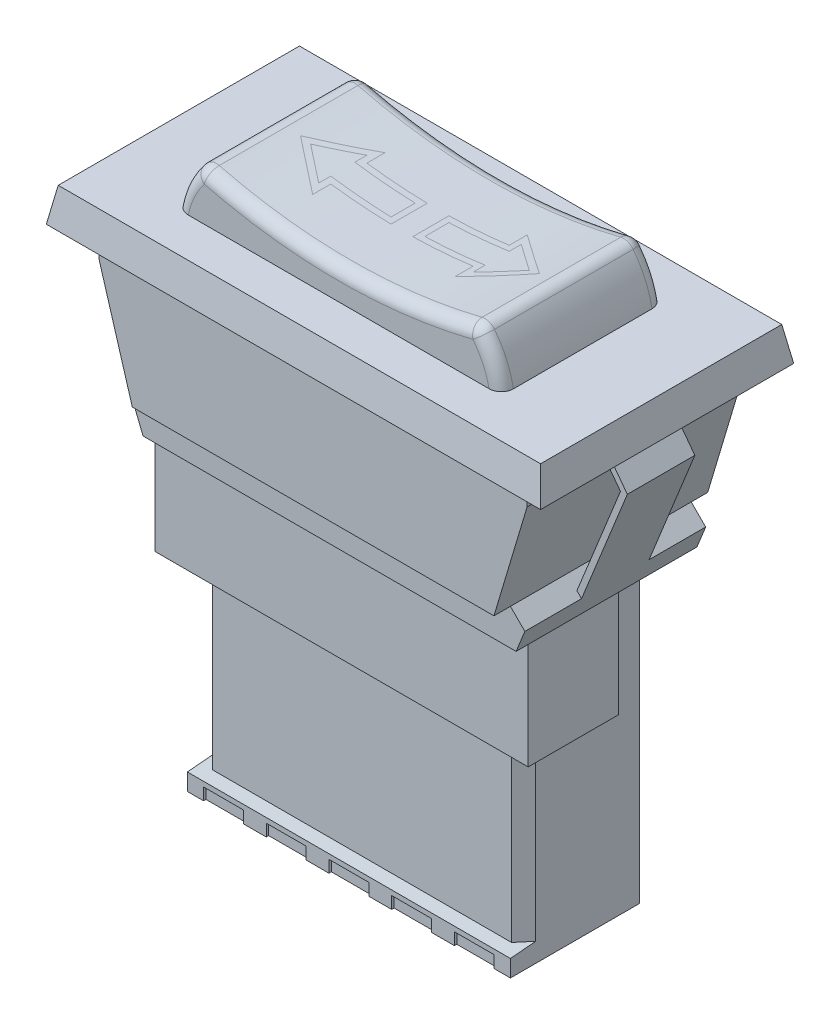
ISO-10303-21;
HEADER;
FILE_DESCRIPTION(('STEP AP214'),'2;1');
FILE_NAME('part.step','',(''),(''),'','','');
FILE_SCHEMA(('AUTOMOTIVE_DESIGN { 1 0 10303 214 1 1 1 1 }'));
ENDSEC;
DATA;
#1=APPLICATION_CONTEXT('core data for automotive mechanical design processes');
#2=APPLICATION_PROTOCOL_DEFINITION('international standard','automotive_design',2000,#1);
#3=PRODUCT_CONTEXT('',#1,'mechanical');
#4=PRODUCT('Part','Part','',(#3));
#5=PRODUCT_RELATED_PRODUCT_CATEGORY('part','',(#4));
#6=PRODUCT_DEFINITION_FORMATION('','',#4);
#7=PRODUCT_DEFINITION_CONTEXT('part definition',#1,'design');
#8=PRODUCT_DEFINITION('design','',#6,#7);
#9=PRODUCT_DEFINITION_SHAPE('','',#8);
#10=(LENGTH_UNIT() NAMED_UNIT(*) SI_UNIT(.MILLI.,.METRE.));
#11=(NAMED_UNIT(*) PLANE_ANGLE_UNIT() SI_UNIT($,.RADIAN.));
#12=(NAMED_UNIT(*) SI_UNIT($,.STERADIAN.) SOLID_ANGLE_UNIT());
#13=UNCERTAINTY_MEASURE_WITH_UNIT(LENGTH_MEASURE(1.E-05),#10,'distance_accuracy_value','');
#14=(GEOMETRIC_REPRESENTATION_CONTEXT(3) GLOBAL_UNCERTAINTY_ASSIGNED_CONTEXT((#13)) GLOBAL_UNIT_ASSIGNED_CONTEXT((#10,
#11,#12)) REPRESENTATION_CONTEXT('',''));
#15=CARTESIAN_POINT('',(0.,0.,0.));
#16=DIRECTION('',(0.,0.,1.));
#17=DIRECTION('',(1.,0.,0.));
#18=AXIS2_PLACEMENT_3D('',#15,#16,#17);
#19=CARTESIAN_POINT('',(0.,50.1333333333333,6.75));
#20=DIRECTION('',(0.,0.,-1.));
#21=DIRECTION('',(-1.,0.,0.));
#22=AXIS2_PLACEMENT_3D('',#19,#20,#21);
#23=CYLINDRICAL_SURFACE('',#22,44.8333333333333);
#24=DIRECTION('',(0.,0.,-1.));
#25=VECTOR('',#24,1.);
#26=CARTESIAN_POINT('',(6.40179174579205,5.75941261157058,6.75));
#27=LINE('',#26,#25);
#28=CARTESIAN_POINT('',(6.40179174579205,5.75941261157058,-1.));
#29=VERTEX_POINT('',#28);
#30=CARTESIAN_POINT('',(6.40179174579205,5.75941261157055,-2.));
#31=VERTEX_POINT('',#30);
#32=EDGE_CURVE('E11',#29,#31,#27,.T.);
#33=ORIENTED_EDGE('',*,*,#32,.F.);
#34=CARTESIAN_POINT('',(0.,50.1333333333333,-1.));
#35=DIRECTION('',(0.,0.,-1.));
#36=DIRECTION('',(-1.,0.,0.));
#37=AXIS2_PLACEMENT_3D('',#34,#35,#36);
#38=CIRCLE('',#37,44.8333333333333);
#39=CARTESIAN_POINT('',(1.40179174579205,5.32192008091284,-1.));
#40=VERTEX_POINT('',#39);
#41=EDGE_CURVE('E62',#40,#29,#38,.F.);
#42=ORIENTED_EDGE('',*,*,#41,.F.);
#43=DIRECTION('',(0.,0.,-1.));
#44=VECTOR('',#43,1.);
#45=CARTESIAN_POINT('',(1.40179174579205,5.32192008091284,6.75));
#46=LINE('',#45,#44);
#47=CARTESIAN_POINT('',(1.40179174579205,5.32192008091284,1.));
#48=VERTEX_POINT('',#47);
#49=EDGE_CURVE('E1932',#48,#40,#46,.T.);
#50=ORIENTED_EDGE('',*,*,#49,.F.);
#51=CARTESIAN_POINT('',(0.,50.1333333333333,1.));
#52=DIRECTION('',(0.,0.,1.));
#53=DIRECTION('',(1.,0.,0.));
#54=AXIS2_PLACEMENT_3D('',#51,#52,#53);
#55=CIRCLE('',#54,44.8333333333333);
#56=CARTESIAN_POINT('',(6.40179174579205,5.75941261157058,0.999999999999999));
#57=VERTEX_POINT('',#56);
#58=EDGE_CURVE('E1928',#57,#48,#55,.F.);
#59=ORIENTED_EDGE('',*,*,#58,.F.);
#60=DIRECTION('',(0.,0.,-1.));
#61=VECTOR('',#60,1.);
#62=CARTESIAN_POINT('',(6.40179174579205,5.75941261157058,6.75));
#63=LINE('',#62,#61);
#64=CARTESIAN_POINT('',(6.40179174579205,5.75941261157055,2.));
#65=VERTEX_POINT('',#64);
#66=EDGE_CURVE('E1924',#65,#57,#63,.T.);
#67=ORIENTED_EDGE('',*,*,#66,.F.);
#68=CARTESIAN_POINT('',(0.,50.1333333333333,6.80134380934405));
#69=DIRECTION('',(0.6,0.,0.8));
#70=DIRECTION('',(0.8,0.,-0.6));
#71=AXIS2_PLACEMENT_3D('',#68,#69,#70);
#72=ELLIPSE('',#71,56.0416666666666,44.8333333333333);
#73=CARTESIAN_POINT('',(9.06845841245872,6.22671834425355,0.));
#74=VERTEX_POINT('',#73);
#75=EDGE_CURVE('E1920',#74,#65,#72,.F.);
#76=ORIENTED_EDGE('',*,*,#75,.F.);
#77=CARTESIAN_POINT('',(0.,50.1333333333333,-6.80134380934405));
#78=DIRECTION('',(0.6,0.,-0.8));
#79=DIRECTION('',(-0.8,0.,-0.6));
#80=AXIS2_PLACEMENT_3D('',#77,#78,#79);
#81=ELLIPSE('',#80,56.0416666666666,44.8333333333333);
#82=EDGE_CURVE('E1916',#31,#74,#81,.F.);
#83=ORIENTED_EDGE('',*,*,#82,.F.);
#84=EDGE_LOOP('',(#33,#42,#50,#59,#67,#76,#83));
#85=FACE_BOUND('',#84,.T.);
#86=ADVANCED_FACE('F53',(#85),#23,.F.);
#87=ORIENTED_EDGE('',*,*,#41,.T.);
#88=ORIENTED_EDGE('',*,*,#32,.T.);
#89=ORIENTED_EDGE('',*,*,#82,.T.);
#90=ORIENTED_EDGE('',*,*,#75,.T.);
#91=ORIENTED_EDGE('',*,*,#66,.T.);
#92=ORIENTED_EDGE('',*,*,#58,.T.);
#93=ORIENTED_EDGE('',*,*,#49,.T.);
#94=EDGE_LOOP('',(#87,#88,#89,#90,#91,#92,#93));
#95=FACE_BOUND('',#94,.T.);
#96=DIRECTION('',(0.,0.,-1.));
#97=VECTOR('',#96,1.);
#98=CARTESIAN_POINT('',(0.901791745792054,5.30907037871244,6.75));
#99=LINE('',#98,#97);
#100=CARTESIAN_POINT('',(0.901791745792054,5.30907037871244,1.5));
#101=VERTEX_POINT('',#100);
#102=CARTESIAN_POINT('',(0.901791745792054,5.30907037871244,-1.5));
#103=VERTEX_POINT('',#102);
#104=EDGE_CURVE('E1913',#101,#103,#99,.T.);
#105=ORIENTED_EDGE('',*,*,#104,.F.);
#106=CARTESIAN_POINT('',(0.,50.1333333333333,1.5));
#107=DIRECTION('',(0.,0.,1.));
#108=DIRECTION('',(1.,0.,0.));
#109=AXIS2_PLACEMENT_3D('',#106,#107,#108);
#110=CIRCLE('',#109,44.8333333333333);
#111=CARTESIAN_POINT('',(5.90179174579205,5.69014901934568,1.5));
#112=VERTEX_POINT('',#111);
#113=EDGE_CURVE('E1832',#112,#101,#110,.F.);
#114=ORIENTED_EDGE('',*,*,#113,.F.);
#115=DIRECTION('',(0.,0.,-1.));
#116=VECTOR('',#115,1.);
#117=CARTESIAN_POINT('',(5.90179174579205,5.69014901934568,6.75));
#118=LINE('',#117,#116);
#119=CARTESIAN_POINT('',(5.90179174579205,5.69014901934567,3.));
#120=VERTEX_POINT('',#119);
#121=EDGE_CURVE('E1908',#120,#112,#118,.T.);
#122=ORIENTED_EDGE('',*,*,#121,.F.);
#123=CARTESIAN_POINT('',(0.,50.1333333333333,7.42634380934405));
#124=DIRECTION('',(0.6,0.,0.8));
#125=DIRECTION('',(0.8,0.,-0.6));
#126=AXIS2_PLACEMENT_3D('',#123,#124,#125);
#127=ELLIPSE('',#126,56.0416666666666,44.8333333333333);
#128=CARTESIAN_POINT('',(9.90179174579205,6.40711353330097,0.));
#129=VERTEX_POINT('',#128);
#130=EDGE_CURVE('E1904',#129,#120,#127,.F.);
#131=ORIENTED_EDGE('',*,*,#130,.F.);
#132=CARTESIAN_POINT('',(0.,50.1333333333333,-7.42634380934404));
#133=DIRECTION('',(0.6,0.,-0.8));
#134=DIRECTION('',(-0.8,0.,-0.6));
#135=AXIS2_PLACEMENT_3D('',#132,#133,#134);
#136=ELLIPSE('',#135,56.0416666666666,44.8333333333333);
#137=CARTESIAN_POINT('',(5.90179174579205,5.69014901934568,-3.));
#138=VERTEX_POINT('',#137);
#139=EDGE_CURVE('E1900',#138,#129,#136,.F.);
#140=ORIENTED_EDGE('',*,*,#139,.F.);
#141=DIRECTION('',(0.,0.,-1.));
#142=VECTOR('',#141,1.);
#143=CARTESIAN_POINT('',(5.90179174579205,5.69014901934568,6.75));
#144=LINE('',#143,#142);
#145=CARTESIAN_POINT('',(5.90179174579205,5.69014901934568,-1.5));
#146=VERTEX_POINT('',#145);
#147=EDGE_CURVE('E1896',#146,#138,#144,.T.);
#148=ORIENTED_EDGE('',*,*,#147,.F.);
#149=CARTESIAN_POINT('',(0.,50.1333333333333,-1.5));
#150=DIRECTION('',(0.,0.,-1.));
#151=DIRECTION('',(-1.,0.,0.));
#152=AXIS2_PLACEMENT_3D('',#149,#150,#151);
#153=CIRCLE('',#152,44.8333333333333);
#154=EDGE_CURVE('E1892',#103,#146,#153,.F.);
#155=ORIENTED_EDGE('',*,*,#154,.F.);
#156=EDGE_LOOP('',(#105,#114,#122,#131,#140,#148,#155));
#157=FACE_BOUND('',#156,.T.);
#158=ADVANCED_FACE('F1792',(#95,#157),#23,.F.);
#159=CARTESIAN_POINT('',(0.,50.1333333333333,1.5));
#160=DIRECTION('',(0.,0.,-1.));
#161=DIRECTION('',(-1.,0.,0.));
#162=AXIS2_PLACEMENT_3D('',#159,#160,#161);
#163=CIRCLE('',#162,44.8333333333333);
#164=CARTESIAN_POINT('',(-5.90179174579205,5.69014901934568,1.5));
#165=VERTEX_POINT('',#164);
#166=CARTESIAN_POINT('',(-0.901791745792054,5.30907037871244,1.5));
#167=VERTEX_POINT('',#166);
#168=EDGE_CURVE('E1841',#165,#167,#163,.F.);
#169=ORIENTED_EDGE('',*,*,#168,.T.);
#170=DIRECTION('',(0.,0.,-1.));
#171=VECTOR('',#170,1.);
#172=CARTESIAN_POINT('',(-0.901791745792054,5.30907037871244,6.75));
#173=LINE('',#172,#171);
#174=CARTESIAN_POINT('',(-0.901791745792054,5.30907037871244,-1.5));
#175=VERTEX_POINT('',#174);
#176=EDGE_CURVE('E1838',#167,#175,#173,.T.);
#177=ORIENTED_EDGE('',*,*,#176,.T.);
#178=CARTESIAN_POINT('',(0.,50.1333333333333,-1.5));
#179=DIRECTION('',(0.,0.,1.));
#180=DIRECTION('',(1.,0.,0.));
#181=AXIS2_PLACEMENT_3D('',#178,#179,#180);
#182=CIRCLE('',#181,44.8333333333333);
#183=CARTESIAN_POINT('',(-5.90179174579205,5.69014901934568,-1.5));
#184=VERTEX_POINT('',#183);
#185=EDGE_CURVE('E1843',#175,#184,#182,.F.);
#186=ORIENTED_EDGE('',*,*,#185,.T.);
#187=DIRECTION('',(0.,0.,-1.));
#188=VECTOR('',#187,1.);
#189=CARTESIAN_POINT('',(-5.90179174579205,5.69014901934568,6.75));
#190=LINE('',#189,#188);
#191=CARTESIAN_POINT('',(-5.90179174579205,5.69014901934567,-3.));
#192=VERTEX_POINT('',#191);
#193=EDGE_CURVE('E1867',#184,#192,#190,.T.);
#194=ORIENTED_EDGE('',*,*,#193,.T.);
#195=CARTESIAN_POINT('',(0.,50.1333333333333,-7.42634380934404));
#196=DIRECTION('',(0.6,0.,0.8));
#197=DIRECTION('',(0.8,0.,-0.6));
#198=AXIS2_PLACEMENT_3D('',#195,#196,#197);
#199=ELLIPSE('',#198,56.0416666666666,44.8333333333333);
#200=CARTESIAN_POINT('',(-9.90179174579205,6.40711353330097,0.));
#201=VERTEX_POINT('',#200);
#202=EDGE_CURVE('E1864',#192,#201,#199,.F.);
#203=ORIENTED_EDGE('',*,*,#202,.T.);
#204=CARTESIAN_POINT('',(0.,50.1333333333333,7.42634380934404));
#205=DIRECTION('',(0.6,0.,-0.8));
#206=DIRECTION('',(-0.8,0.,-0.6));
#207=AXIS2_PLACEMENT_3D('',#204,#205,#206);
#208=ELLIPSE('',#207,56.0416666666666,44.8333333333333);
#209=CARTESIAN_POINT('',(-5.90179174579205,5.69014901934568,3.));
#210=VERTEX_POINT('',#209);
#211=EDGE_CURVE('E1855',#201,#210,#208,.F.);
#212=ORIENTED_EDGE('',*,*,#211,.T.);
#213=DIRECTION('',(0.,0.,-1.));
#214=VECTOR('',#213,1.);
#215=CARTESIAN_POINT('',(-5.90179174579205,5.69014901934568,6.75));
#216=LINE('',#215,#214);
#217=EDGE_CURVE('E1848',#210,#165,#216,.T.);
#218=ORIENTED_EDGE('',*,*,#217,.T.);
#219=EDGE_LOOP('',(#169,#177,#186,#194,#203,#212,#218));
#220=FACE_BOUND('',#219,.T.);
#221=DIRECTION('',(0.,0.,-1.));
#222=VECTOR('',#221,1.);
#223=CARTESIAN_POINT('',(-6.40179174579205,5.75941261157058,6.75));
#224=LINE('',#223,#222);
#225=CARTESIAN_POINT('',(-6.40179174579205,5.75941261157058,-1.));
#226=VERTEX_POINT('',#225);
#227=CARTESIAN_POINT('',(-6.40179174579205,5.75941261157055,-2.));
#228=VERTEX_POINT('',#227);
#229=EDGE_CURVE('E1889',#226,#228,#224,.T.);
#230=ORIENTED_EDGE('',*,*,#229,.F.);
#231=CARTESIAN_POINT('',(0.,50.1333333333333,-1.));
#232=DIRECTION('',(0.,0.,1.));
#233=DIRECTION('',(1.,0.,0.));
#234=AXIS2_PLACEMENT_3D('',#231,#232,#233);
#235=CIRCLE('',#234,44.8333333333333);
#236=CARTESIAN_POINT('',(-1.40179174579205,5.32192008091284,-1.));
#237=VERTEX_POINT('',#236);
#238=EDGE_CURVE('E1845',#237,#226,#235,.F.);
#239=ORIENTED_EDGE('',*,*,#238,.F.);
#240=DIRECTION('',(0.,0.,-1.));
#241=VECTOR('',#240,1.);
#242=CARTESIAN_POINT('',(-1.40179174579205,5.32192008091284,6.75));
#243=LINE('',#242,#241);
#244=CARTESIAN_POINT('',(-1.40179174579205,5.32192008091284,1.));
#245=VERTEX_POINT('',#244);
#246=EDGE_CURVE('E1874',#245,#237,#243,.T.);
#247=ORIENTED_EDGE('',*,*,#246,.F.);
#248=CARTESIAN_POINT('',(0.,50.1333333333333,1.));
#249=DIRECTION('',(0.,0.,-1.));
#250=DIRECTION('',(-1.,0.,0.));
#251=AXIS2_PLACEMENT_3D('',#248,#249,#250);
#252=CIRCLE('',#251,44.8333333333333);
#253=CARTESIAN_POINT('',(-6.40179174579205,5.75941261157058,1.));
#254=VERTEX_POINT('',#253);
#255=EDGE_CURVE('E1877',#254,#245,#252,.F.);
#256=ORIENTED_EDGE('',*,*,#255,.F.);
#257=DIRECTION('',(0.,0.,-1.));
#258=VECTOR('',#257,1.);
#259=CARTESIAN_POINT('',(-6.40179174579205,5.75941261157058,6.75));
#260=LINE('',#259,#258);
#261=CARTESIAN_POINT('',(-6.40179174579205,5.75941261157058,2.));
#262=VERTEX_POINT('',#261);
#263=EDGE_CURVE('E1880',#262,#254,#260,.T.);
#264=ORIENTED_EDGE('',*,*,#263,.F.);
#265=CARTESIAN_POINT('',(0.,50.1333333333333,6.80134380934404));
#266=DIRECTION('',(0.6,0.,-0.8));
#267=DIRECTION('',(-0.8,0.,-0.6));
#268=AXIS2_PLACEMENT_3D('',#265,#266,#267);
#269=ELLIPSE('',#268,56.0416666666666,44.8333333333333);
#270=CARTESIAN_POINT('',(-9.06845841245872,6.22671834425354,0.));
#271=VERTEX_POINT('',#270);
#272=EDGE_CURVE('E1883',#271,#262,#269,.F.);
#273=ORIENTED_EDGE('',*,*,#272,.F.);
#274=CARTESIAN_POINT('',(0.,50.1333333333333,-6.80134380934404));
#275=DIRECTION('',(0.6,0.,0.8));
#276=DIRECTION('',(0.8,0.,-0.6));
#277=AXIS2_PLACEMENT_3D('',#274,#275,#276);
#278=ELLIPSE('',#277,56.0416666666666,44.8333333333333);
#279=EDGE_CURVE('E1886',#228,#271,#278,.F.);
#280=ORIENTED_EDGE('',*,*,#279,.F.);
#281=EDGE_LOOP('',(#230,#239,#247,#256,#264,#273,#280));
#282=FACE_BOUND('',#281,.T.);
#283=ADVANCED_FACE('F1801',(#220,#282),#23,.F.);
#284=ORIENTED_EDGE('',*,*,#113,.T.);
#285=ORIENTED_EDGE('',*,*,#104,.T.);
#286=ORIENTED_EDGE('',*,*,#154,.T.);
#287=ORIENTED_EDGE('',*,*,#147,.T.);
#288=ORIENTED_EDGE('',*,*,#139,.T.);
#289=ORIENTED_EDGE('',*,*,#130,.T.);
#290=ORIENTED_EDGE('',*,*,#121,.T.);
#291=EDGE_LOOP('',(#284,#285,#286,#287,#288,#289,#290));
#292=FACE_BOUND('',#291,.T.);
#293=DIRECTION('',(0.,0.,-1.));
#294=VECTOR('',#293,1.);
#295=CARTESIAN_POINT('',(10.9017917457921,6.64564870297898,6.75));
#296=LINE('',#295,#294);
#297=CARTESIAN_POINT('',(10.9017917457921,6.64564870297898,5.75));
#298=VERTEX_POINT('',#297);
#299=CARTESIAN_POINT('',(10.9017917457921,6.64564870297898,-5.75));
#300=VERTEX_POINT('',#299);
#301=EDGE_CURVE('E1617',#298,#300,#296,.T.);
#302=ORIENTED_EDGE('',*,*,#301,.T.);
#303=CARTESIAN_POINT('',(0.,50.1333333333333,-5.75));
#304=DIRECTION('',(0.,0.,1.));
#305=DIRECTION('',(1.,0.,0.));
#306=AXIS2_PLACEMENT_3D('',#303,#304,#305);
#307=CIRCLE('',#306,44.8333333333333);
#308=CARTESIAN_POINT('',(-10.9017917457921,6.64564870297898,-5.75));
#309=VERTEX_POINT('',#308);
#310=EDGE_CURVE('E1687',#300,#309,#307,.F.);
#311=ORIENTED_EDGE('',*,*,#310,.T.);
#312=DIRECTION('',(0.,0.,-1.));
#313=VECTOR('',#312,1.);
#314=CARTESIAN_POINT('',(-10.9017917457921,6.64564870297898,6.75));
#315=LINE('',#314,#313);
#316=CARTESIAN_POINT('',(-10.9017917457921,6.64564870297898,5.75));
#317=VERTEX_POINT('',#316);
#318=EDGE_CURVE('E1613',#317,#309,#315,.T.);
#319=ORIENTED_EDGE('',*,*,#318,.F.);
#320=CARTESIAN_POINT('',(0.,50.1333333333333,5.75));
#321=DIRECTION('',(0.,0.,1.));
#322=DIRECTION('',(1.,0.,0.));
#323=AXIS2_PLACEMENT_3D('',#320,#321,#322);
#324=CIRCLE('',#323,44.8333333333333);
#325=EDGE_CURVE('E1684',#317,#298,#324,.T.);
#326=ORIENTED_EDGE('',*,*,#325,.T.);
#327=EDGE_LOOP('',(#302,#311,#319,#326));
#328=FACE_BOUND('',#327,.T.);
#329=ORIENTED_EDGE('',*,*,#176,.F.);
#330=ORIENTED_EDGE('',*,*,#168,.F.);
#331=ORIENTED_EDGE('',*,*,#217,.F.);
#332=ORIENTED_EDGE('',*,*,#211,.F.);
#333=ORIENTED_EDGE('',*,*,#202,.F.);
#334=ORIENTED_EDGE('',*,*,#193,.F.);
#335=ORIENTED_EDGE('',*,*,#185,.F.);
#336=EDGE_LOOP('',(#329,#330,#331,#332,#333,#334,#335));
#337=FACE_BOUND('',#336,.T.);
#338=ADVANCED_FACE('F1807',(#292,#328,#337),#23,.F.);
#339=CARTESIAN_POINT('',(-13.4,-39.5,4.8));
#340=DIRECTION('',(0.,0.,-1.));
#341=DIRECTION('',(-1.,0.,0.));
#342=AXIS2_PLACEMENT_3D('',#339,#340,#341);
#343=PLANE('',#342);
#344=DIRECTION('',(-1.,0.,0.));
#345=VECTOR('',#344,1.);
#346=CARTESIAN_POINT('',(15.2601075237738,-38.,4.8));
#347=LINE('',#346,#345);
#348=CARTESIAN_POINT('',(12.4,-38.,4.8));
#349=VERTEX_POINT('',#348);
#350=CARTESIAN_POINT('',(-12.4,-38.,4.8));
#351=VERTEX_POINT('',#350);
#352=EDGE_CURVE('E1228',#349,#351,#347,.T.);
#353=ORIENTED_EDGE('',*,*,#352,.F.);
#354=DIRECTION('',(0.,1.,0.));
#355=VECTOR('',#354,1.);
#356=CARTESIAN_POINT('',(12.4,-39.5,4.8));
#357=LINE('',#356,#355);
#358=CARTESIAN_POINT('',(12.4,-14.2,4.8));
#359=VERTEX_POINT('',#358);
#360=EDGE_CURVE('E2047',#349,#359,#357,.T.);
#361=ORIENTED_EDGE('',*,*,#360,.T.);
#362=DIRECTION('',(-1.,0.,0.));
#363=VECTOR('',#362,1.);
#364=CARTESIAN_POINT('',(-13.4,-14.2,4.8));
#365=LINE('',#364,#363);
#366=CARTESIAN_POINT('',(-12.4,-14.2,4.8));
#367=VERTEX_POINT('',#366);
#368=EDGE_CURVE('E1257',#359,#367,#365,.T.);
#369=ORIENTED_EDGE('',*,*,#368,.T.);
#370=DIRECTION('',(0.,-1.,0.));
#371=VECTOR('',#370,1.);
#372=CARTESIAN_POINT('',(-12.4,-39.5,4.8));
#373=LINE('',#372,#371);
#374=EDGE_CURVE('E2051',#367,#351,#373,.T.);
#375=ORIENTED_EDGE('',*,*,#374,.T.);
#376=EDGE_LOOP('',(#353,#361,#369,#375));
#377=FACE_BOUND('',#376,.T.);
#378=ADVANCED_FACE('F1818',(#377),#343,.F.);
#379=CARTESIAN_POINT('',(-15.4723404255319,-14.2,7.5));
#380=DIRECTION('',(0.,1.,0.));
#381=DIRECTION('',(-1.,0.,0.));
#382=AXIS2_PLACEMENT_3D('',#379,#380,#381);
#383=PLANE('',#382);
#384=DIRECTION('',(0.,0.,-1.));
#385=VECTOR('',#384,1.);
#386=CARTESIAN_POINT('',(15.4723404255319,-14.2,7.5));
#387=LINE('',#386,#385);
#388=CARTESIAN_POINT('',(15.4723404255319,-14.2,-1.));
#389=VERTEX_POINT('',#388);
#390=CARTESIAN_POINT('',(15.4723404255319,-14.2,-7.5));
#391=VERTEX_POINT('',#390);
#392=EDGE_CURVE('E1504',#389,#391,#387,.T.);
#393=ORIENTED_EDGE('',*,*,#392,.F.);
#394=DIRECTION('',(-1.,0.,0.));
#395=VECTOR('',#394,1.);
#396=CARTESIAN_POINT('',(15.4723404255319,-14.2,-1.));
#397=LINE('',#396,#395);
#398=CARTESIAN_POINT('',(13.8723404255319,-14.2,-1.));
#399=VERTEX_POINT('',#398);
#400=EDGE_CURVE('E1325',#389,#399,#397,.T.);
#401=ORIENTED_EDGE('',*,*,#400,.T.);
#402=DIRECTION('',(0.,0.,1.));
#403=VECTOR('',#402,1.);
#404=CARTESIAN_POINT('',(13.8723404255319,-14.2,-1.));
#405=LINE('',#404,#403);
#406=CARTESIAN_POINT('',(13.8723404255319,-14.2,4.9));
#407=VERTEX_POINT('',#406);
#408=EDGE_CURVE('E1321',#399,#407,#405,.T.);
#409=ORIENTED_EDGE('',*,*,#408,.T.);
#410=DIRECTION('',(1.,0.,0.));
#411=VECTOR('',#410,1.);
#412=CARTESIAN_POINT('',(-15.4723404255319,-14.2,4.9));
#413=LINE('',#412,#411);
#414=CARTESIAN_POINT('',(-13.8723404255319,-14.2,4.9));
#415=VERTEX_POINT('',#414);
#416=EDGE_CURVE('E1317',#407,#415,#413,.F.);
#417=ORIENTED_EDGE('',*,*,#416,.T.);
#418=DIRECTION('',(0.,0.,1.));
#419=VECTOR('',#418,1.);
#420=CARTESIAN_POINT('',(-13.8723404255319,-14.2,-1.));
#421=LINE('',#420,#419);
#422=CARTESIAN_POINT('',(-13.8723404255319,-14.2,-1.));
#423=VERTEX_POINT('',#422);
#424=EDGE_CURVE('E1313',#415,#423,#421,.F.);
#425=ORIENTED_EDGE('',*,*,#424,.T.);
#426=DIRECTION('',(-1.,0.,0.));
#427=VECTOR('',#426,1.);
#428=CARTESIAN_POINT('',(-13.8723404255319,-14.2,-1.));
#429=LINE('',#428,#427);
#430=CARTESIAN_POINT('',(-15.4723404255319,-14.2,-1.));
#431=VERTEX_POINT('',#430);
#432=EDGE_CURVE('E1309',#423,#431,#429,.T.);
#433=ORIENTED_EDGE('',*,*,#432,.T.);
#434=DIRECTION('',(0.,0.,-1.));
#435=VECTOR('',#434,1.);
#436=CARTESIAN_POINT('',(-15.4723404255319,-14.2,7.5));
#437=LINE('',#436,#435);
#438=CARTESIAN_POINT('',(-15.4723404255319,-14.2,-7.5));
#439=VERTEX_POINT('',#438);
#440=EDGE_CURVE('E1509',#431,#439,#437,.T.);
#441=ORIENTED_EDGE('',*,*,#440,.T.);
#442=DIRECTION('',(1.,0.,0.));
#443=VECTOR('',#442,1.);
#444=CARTESIAN_POINT('',(-15.4723404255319,-14.2,-7.5));
#445=LINE('',#444,#443);
#446=EDGE_CURVE('E1485',#439,#391,#445,.T.);
#447=ORIENTED_EDGE('',*,*,#446,.T.);
#448=EDGE_LOOP('',(#393,#401,#409,#417,#425,#433,#441,#447));
#449=FACE_BOUND('',#448,.T.);
#450=DIRECTION('',(0.,0.,1.));
#451=VECTOR('',#450,1.);
#452=CARTESIAN_POINT('',(13.4,-14.2,4.8));
#453=LINE('',#452,#451);
#454=CARTESIAN_POINT('',(13.4,-14.2,-4.8));
#455=VERTEX_POINT('',#454);
#456=CARTESIAN_POINT('',(13.4,-14.2,3.79999999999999));
#457=VERTEX_POINT('',#456);
#458=EDGE_CURVE('E1231',#455,#457,#453,.T.);
#459=ORIENTED_EDGE('',*,*,#458,.F.);
#460=DIRECTION('',(1.,0.,0.));
#461=VECTOR('',#460,1.);
#462=CARTESIAN_POINT('',(-13.4,-14.2,-4.8));
#463=LINE('',#462,#461);
#464=CARTESIAN_POINT('',(12.4,-14.2,-4.8));
#465=VERTEX_POINT('',#464);
#466=EDGE_CURVE('E1264',#465,#455,#463,.T.);
#467=ORIENTED_EDGE('',*,*,#466,.F.);
#468=DIRECTION('',(1.,0.,0.));
#469=VECTOR('',#468,1.);
#470=CARTESIAN_POINT('',(-12.4,-14.2,-4.8));
#471=LINE('',#470,#469);
#472=CARTESIAN_POINT('',(-12.4,-14.2,-4.8));
#473=VERTEX_POINT('',#472);
#474=EDGE_CURVE('E1174',#473,#465,#471,.T.);
#475=ORIENTED_EDGE('',*,*,#474,.F.);
#476=CARTESIAN_POINT('',(-13.4,-14.2,-4.8));
#477=VERTEX_POINT('',#476);
#478=EDGE_CURVE('E1247',#477,#473,#463,.T.);
#479=ORIENTED_EDGE('',*,*,#478,.F.);
#480=DIRECTION('',(0.,0.,-1.));
#481=VECTOR('',#480,1.);
#482=CARTESIAN_POINT('',(-13.4,-14.2,4.8));
#483=LINE('',#482,#481);
#484=CARTESIAN_POINT('',(-13.4,-14.2,3.80000000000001));
#485=VERTEX_POINT('',#484);
#486=EDGE_CURVE('E1261',#485,#477,#483,.T.);
#487=ORIENTED_EDGE('',*,*,#486,.F.);
#488=DIRECTION('',(-0.707106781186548,0.,-0.707106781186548));
#489=VECTOR('',#488,1.);
#490=CARTESIAN_POINT('',(-12.586170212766,-14.2,4.61382978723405));
#491=LINE('',#490,#489);
#492=EDGE_CURVE('E1858',#485,#367,#491,.F.);
#493=ORIENTED_EDGE('',*,*,#492,.T.);
#494=ORIENTED_EDGE('',*,*,#368,.F.);
#495=DIRECTION('',(-0.707106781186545,0.,0.70710678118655));
#496=VECTOR('',#495,1.);
#497=CARTESIAN_POINT('',(-2.88617021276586,-14.2,20.086170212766));
#498=LINE('',#497,#496);
#499=EDGE_CURVE('E2036',#359,#457,#498,.F.);
#500=ORIENTED_EDGE('',*,*,#499,.T.);
#501=EDGE_LOOP('',(#459,#467,#475,#479,#487,#493,#494,#500));
#502=FACE_BOUND('',#501,.T.);
#503=ADVANCED_FACE('F1824',(#449,#502),#383,.F.);
#504=DIRECTION('',(-1.,0.,0.));
#505=VECTOR('',#504,1.);
#506=CARTESIAN_POINT('',(-15.4723404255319,-14.2,6.5));
#507=LINE('',#506,#505);
#508=CARTESIAN_POINT('',(15.4723404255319,-14.2,6.5));
#509=VERTEX_POINT('',#508);
#510=CARTESIAN_POINT('',(-15.4723404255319,-14.2,6.5));
#511=VERTEX_POINT('',#510);
#512=EDGE_CURVE('E1280',#509,#511,#507,.T.);
#513=ORIENTED_EDGE('',*,*,#512,.F.);
#514=CARTESIAN_POINT('',(15.4723404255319,-14.2,7.5));
#515=VERTEX_POINT('',#514);
#516=EDGE_CURVE('E1505',#515,#509,#387,.T.);
#517=ORIENTED_EDGE('',*,*,#516,.F.);
#518=DIRECTION('',(1.,0.,0.));
#519=VECTOR('',#518,1.);
#520=CARTESIAN_POINT('',(-15.4723404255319,-14.2,7.5));
#521=LINE('',#520,#519);
#522=CARTESIAN_POINT('',(-15.4723404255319,-14.2,7.5));
#523=VERTEX_POINT('',#522);
#524=EDGE_CURVE('E1464',#523,#515,#521,.T.);
#525=ORIENTED_EDGE('',*,*,#524,.F.);
#526=EDGE_CURVE('E1510',#523,#511,#437,.T.);
#527=ORIENTED_EDGE('',*,*,#526,.T.);
#528=EDGE_LOOP('',(#513,#517,#525,#527));
#529=FACE_BOUND('',#528,.T.);
#530=ADVANCED_FACE('F2217',(#529),#383,.F.);
#531=CARTESIAN_POINT('',(17.75,0.,8.865));
#532=DIRECTION('',(-1.,0.,0.));
#533=DIRECTION('',(0.,0.,1.));
#534=AXIS2_PLACEMENT_3D('',#531,#532,#533);
#535=PLANE('',#534);
#536=DIRECTION('',(0.,-1.,0.));
#537=VECTOR('',#536,1.);
#538=CARTESIAN_POINT('',(17.75,0.,2.8));
#539=LINE('',#538,#537);
#540=CARTESIAN_POINT('',(17.75,0.,2.8));
#541=VERTEX_POINT('',#540);
#542=CARTESIAN_POINT('',(17.75,-0.833333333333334,2.8));
#543=VERTEX_POINT('',#542);
#544=EDGE_CURVE('E1404',#541,#543,#539,.T.);
#545=ORIENTED_EDGE('',*,*,#544,.F.);
#546=DIRECTION('',(0.,0.,-1.));
#547=VECTOR('',#546,1.);
#548=CARTESIAN_POINT('',(17.75,0.,8.865));
#549=LINE('',#548,#547);
#550=CARTESIAN_POINT('',(17.75,0.,8.865));
#551=VERTEX_POINT('',#550);
#552=EDGE_CURVE('E1565',#551,#541,#549,.T.);
#553=ORIENTED_EDGE('',*,*,#552,.F.);
#554=DIRECTION('',(0.,1.,0.));
#555=VECTOR('',#554,1.);
#556=CARTESIAN_POINT('',(17.75,0.,8.865));
#557=LINE('',#556,#555);
#558=CARTESIAN_POINT('',(17.75,-1.99999999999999,8.865));
#559=VERTEX_POINT('',#558);
#560=EDGE_CURVE('E1541',#559,#551,#557,.T.);
#561=ORIENTED_EDGE('',*,*,#560,.F.);
#562=DIRECTION('',(0.,0.,-1.));
#563=VECTOR('',#562,1.);
#564=CARTESIAN_POINT('',(17.75,-1.99999999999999,8.865));
#565=LINE('',#564,#563);
#566=CARTESIAN_POINT('',(17.75,-1.99999999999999,-8.865));
#567=VERTEX_POINT('',#566);
#568=EDGE_CURVE('E1569',#559,#567,#565,.T.);
#569=ORIENTED_EDGE('',*,*,#568,.T.);
#570=DIRECTION('',(0.,1.,0.));
#571=VECTOR('',#570,1.);
#572=CARTESIAN_POINT('',(17.75,0.,-8.865));
#573=LINE('',#572,#571);
#574=CARTESIAN_POINT('',(17.75,0.,-8.865));
#575=VERTEX_POINT('',#574);
#576=EDGE_CURVE('E1529',#567,#575,#573,.T.);
#577=ORIENTED_EDGE('',*,*,#576,.T.);
#578=CARTESIAN_POINT('',(17.75,0.,-2.8));
#579=VERTEX_POINT('',#578);
#580=EDGE_CURVE('E1544',#579,#575,#549,.T.);
#581=ORIENTED_EDGE('',*,*,#580,.F.);
#582=DIRECTION('',(0.,-1.,0.));
#583=VECTOR('',#582,1.);
#584=CARTESIAN_POINT('',(17.75,0.,-2.8));
#585=LINE('',#584,#583);
#586=CARTESIAN_POINT('',(17.75,-0.833333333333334,-2.8));
#587=VERTEX_POINT('',#586);
#588=EDGE_CURVE('E1400',#579,#587,#585,.T.);
#589=ORIENTED_EDGE('',*,*,#588,.T.);
#590=DIRECTION('',(0.,0.,-1.));
#591=VECTOR('',#590,1.);
#592=CARTESIAN_POINT('',(17.75,-0.833333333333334,8.865));
#593=LINE('',#592,#591);
#594=EDGE_CURVE('E2054',#543,#587,#593,.T.);
#595=ORIENTED_EDGE('',*,*,#594,.F.);
#596=EDGE_LOOP('',(#545,#553,#561,#569,#577,#581,#589,#595));
#597=FACE_BOUND('',#596,.T.);
#598=ADVANCED_FACE('F2214',(#597),#535,.F.);
#599=CARTESIAN_POINT('',(15.,-11.2,7.5));
#600=DIRECTION('',(-0.707106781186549,-0.707106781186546,0.));
#601=DIRECTION('',(0.707106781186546,-0.707106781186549,0.));
#602=AXIS2_PLACEMENT_3D('',#599,#600,#601);
#603=PLANE('',#602);
#604=DIRECTION('',(0.707106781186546,-0.707106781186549,0.));
#605=VECTOR('',#604,1.);
#606=CARTESIAN_POINT('',(15.,-11.2,2.8));
#607=LINE('',#606,#605);
#608=CARTESIAN_POINT('',(15.8159457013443,-12.0159457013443,2.8));
#609=VERTEX_POINT('',#608);
#610=CARTESIAN_POINT('',(16.2,-12.4,2.8));
#611=VERTEX_POINT('',#610);
#612=EDGE_CURVE('E2058',#609,#611,#607,.T.);
#613=ORIENTED_EDGE('',*,*,#612,.F.);
#614=DIRECTION('',(0.,0.,1.));
#615=VECTOR('',#614,1.);
#616=CARTESIAN_POINT('',(15.8159457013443,-12.0159457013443,7.5));
#617=LINE('',#616,#615);
#618=CARTESIAN_POINT('',(15.8159457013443,-12.0159457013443,-2.8));
#619=VERTEX_POINT('',#618);
#620=EDGE_CURVE('E2061',#619,#609,#617,.T.);
#621=ORIENTED_EDGE('',*,*,#620,.F.);
#622=DIRECTION('',(0.707106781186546,-0.707106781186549,0.));
#623=VECTOR('',#622,1.);
#624=CARTESIAN_POINT('',(15.,-11.2,-2.8));
#625=LINE('',#624,#623);
#626=CARTESIAN_POINT('',(16.2,-12.4,-2.8));
#627=VERTEX_POINT('',#626);
#628=EDGE_CURVE('E2064',#619,#627,#625,.T.);
#629=ORIENTED_EDGE('',*,*,#628,.T.);
#630=DIRECTION('',(0.,0.,-1.));
#631=VECTOR('',#630,1.);
#632=CARTESIAN_POINT('',(16.2,-12.4,7.5));
#633=LINE('',#632,#631);
#634=CARTESIAN_POINT('',(16.2,-12.4,-7.5));
#635=VERTEX_POINT('',#634);
#636=EDGE_CURVE('E1499',#627,#635,#633,.T.);
#637=ORIENTED_EDGE('',*,*,#636,.T.);
#638=DIRECTION('',(-0.707106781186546,0.707106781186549,0.));
#639=VECTOR('',#638,1.);
#640=CARTESIAN_POINT('',(15.,-11.2,-7.5));
#641=LINE('',#640,#639);
#642=CARTESIAN_POINT('',(15.,-11.2,-7.49999999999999));
#643=VERTEX_POINT('',#642);
#644=EDGE_CURVE('E1458',#635,#643,#641,.T.);
#645=ORIENTED_EDGE('',*,*,#644,.T.);
#646=DIRECTION('',(0.,0.,-1.));
#647=VECTOR('',#646,1.);
#648=CARTESIAN_POINT('',(15.,-11.2,7.5));
#649=LINE('',#648,#647);
#650=CARTESIAN_POINT('',(15.,-11.2,7.5));
#651=VERTEX_POINT('',#650);
#652=EDGE_CURVE('E1474',#651,#643,#649,.T.);
#653=ORIENTED_EDGE('',*,*,#652,.F.);
#654=DIRECTION('',(-0.707106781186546,0.707106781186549,0.));
#655=VECTOR('',#654,1.);
#656=CARTESIAN_POINT('',(15.,-11.2,7.5));
#657=LINE('',#656,#655);
#658=CARTESIAN_POINT('',(16.2,-12.4,7.5));
#659=VERTEX_POINT('',#658);
#660=EDGE_CURVE('E1470',#659,#651,#657,.T.);
#661=ORIENTED_EDGE('',*,*,#660,.F.);
#662=EDGE_CURVE('E1500',#659,#611,#633,.T.);
#663=ORIENTED_EDGE('',*,*,#662,.T.);
#664=EDGE_LOOP('',(#613,#621,#629,#637,#645,#653,#661,#663));
#665=FACE_BOUND('',#664,.T.);
#666=ADVANCED_FACE('F2200',(#665),#603,.F.);
#667=CARTESIAN_POINT('',(-17.75,0.,8.865));
#668=DIRECTION('',(1.,0.,0.));
#669=DIRECTION('',(0.,0.,-1.));
#670=AXIS2_PLACEMENT_3D('',#667,#668,#669);
#671=PLANE('',#670);
#672=DIRECTION('',(0.,1.,0.));
#673=VECTOR('',#672,1.);
#674=CARTESIAN_POINT('',(-17.75,0.,2.8));
#675=LINE('',#674,#673);
#676=CARTESIAN_POINT('',(-17.75,-0.833333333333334,2.8));
#677=VERTEX_POINT('',#676);
#678=CARTESIAN_POINT('',(-17.75,0.,2.8));
#679=VERTEX_POINT('',#678);
#680=EDGE_CURVE('E1449',#677,#679,#675,.T.);
#681=ORIENTED_EDGE('',*,*,#680,.F.);
#682=DIRECTION('',(0.,0.,-1.));
#683=VECTOR('',#682,1.);
#684=CARTESIAN_POINT('',(-17.75,-0.833333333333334,8.865));
#685=LINE('',#684,#683);
#686=CARTESIAN_POINT('',(-17.75,-0.833333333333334,-2.8));
#687=VERTEX_POINT('',#686);
#688=EDGE_CURVE('E2068',#677,#687,#685,.T.);
#689=ORIENTED_EDGE('',*,*,#688,.T.);
#690=DIRECTION('',(0.,1.,0.));
#691=VECTOR('',#690,1.);
#692=CARTESIAN_POINT('',(-17.75,0.,-2.8));
#693=LINE('',#692,#691);
#694=CARTESIAN_POINT('',(-17.75,0.,-2.8));
#695=VERTEX_POINT('',#694);
#696=EDGE_CURVE('E1445',#687,#695,#693,.T.);
#697=ORIENTED_EDGE('',*,*,#696,.T.);
#698=DIRECTION('',(0.,0.,-1.));
#699=VECTOR('',#698,1.);
#700=CARTESIAN_POINT('',(-17.75,0.,8.865));
#701=LINE('',#700,#699);
#702=CARTESIAN_POINT('',(-17.75,0.,-8.865));
#703=VERTEX_POINT('',#702);
#704=EDGE_CURVE('E1586',#695,#703,#701,.T.);
#705=ORIENTED_EDGE('',*,*,#704,.T.);
#706=DIRECTION('',(0.,-1.,0.));
#707=VECTOR('',#706,1.);
#708=CARTESIAN_POINT('',(-17.75,0.,-8.865));
#709=LINE('',#708,#707);
#710=CARTESIAN_POINT('',(-17.75,-2.,-8.865));
#711=VERTEX_POINT('',#710);
#712=EDGE_CURVE('E1548',#703,#711,#709,.T.);
#713=ORIENTED_EDGE('',*,*,#712,.T.);
#714=DIRECTION('',(0.,0.,-1.));
#715=VECTOR('',#714,1.);
#716=CARTESIAN_POINT('',(-17.75,-2.,8.865));
#717=LINE('',#716,#715);
#718=CARTESIAN_POINT('',(-17.75,-2.,8.865));
#719=VERTEX_POINT('',#718);
#720=EDGE_CURVE('E1582',#719,#711,#717,.T.);
#721=ORIENTED_EDGE('',*,*,#720,.F.);
#722=DIRECTION('',(0.,-1.,0.));
#723=VECTOR('',#722,1.);
#724=CARTESIAN_POINT('',(-17.75,0.,8.865));
#725=LINE('',#724,#723);
#726=CARTESIAN_POINT('',(-17.75,0.,8.865));
#727=VERTEX_POINT('',#726);
#728=EDGE_CURVE('E1528',#727,#719,#725,.T.);
#729=ORIENTED_EDGE('',*,*,#728,.F.);
#730=EDGE_CURVE('E1587',#727,#679,#701,.T.);
#731=ORIENTED_EDGE('',*,*,#730,.T.);
#732=EDGE_LOOP('',(#681,#689,#697,#705,#713,#721,#729,#731));
#733=FACE_BOUND('',#732,.T.);
#734=ADVANCED_FACE('F2196',(#733),#671,.F.);
#735=CARTESIAN_POINT('',(-15.,-11.2,7.5));
#736=DIRECTION('',(0.707106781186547,-0.707106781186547,0.));
#737=DIRECTION('',(0.707106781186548,0.707106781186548,0.));
#738=AXIS2_PLACEMENT_3D('',#735,#736,#737);
#739=PLANE('',#738);
#740=DIRECTION('',(0.707106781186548,0.707106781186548,0.));
#741=VECTOR('',#740,1.);
#742=CARTESIAN_POINT('',(-15.,-11.2,2.8));
#743=LINE('',#742,#741);
#744=CARTESIAN_POINT('',(-16.2,-12.4,2.8));
#745=VERTEX_POINT('',#744);
#746=CARTESIAN_POINT('',(-15.8159457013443,-12.0159457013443,2.8));
#747=VERTEX_POINT('',#746);
#748=EDGE_CURVE('E2072',#745,#747,#743,.T.);
#749=ORIENTED_EDGE('',*,*,#748,.F.);
#750=DIRECTION('',(0.,0.,-1.));
#751=VECTOR('',#750,1.);
#752=CARTESIAN_POINT('',(-16.2,-12.4,7.5));
#753=LINE('',#752,#751);
#754=CARTESIAN_POINT('',(-16.2,-12.4,7.5));
#755=VERTEX_POINT('',#754);
#756=EDGE_CURVE('E1515',#755,#745,#753,.T.);
#757=ORIENTED_EDGE('',*,*,#756,.F.);
#758=DIRECTION('',(-0.707106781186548,-0.707106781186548,0.));
#759=VECTOR('',#758,1.);
#760=CARTESIAN_POINT('',(-15.,-11.2,7.5));
#761=LINE('',#760,#759);
#762=CARTESIAN_POINT('',(-15.,-11.2,7.5));
#763=VERTEX_POINT('',#762);
#764=EDGE_CURVE('E1457',#763,#755,#761,.T.);
#765=ORIENTED_EDGE('',*,*,#764,.F.);
#766=DIRECTION('',(0.,0.,-1.));
#767=VECTOR('',#766,1.);
#768=CARTESIAN_POINT('',(-15.,-11.2,7.5));
#769=LINE('',#768,#767);
#770=CARTESIAN_POINT('',(-15.,-11.2,-7.49999999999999));
#771=VERTEX_POINT('',#770);
#772=EDGE_CURVE('E1519',#763,#771,#769,.T.);
#773=ORIENTED_EDGE('',*,*,#772,.T.);
#774=DIRECTION('',(-0.707106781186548,-0.707106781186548,0.));
#775=VECTOR('',#774,1.);
#776=CARTESIAN_POINT('',(-15.,-11.2,-7.5));
#777=LINE('',#776,#775);
#778=CARTESIAN_POINT('',(-16.2,-12.4,-7.5));
#779=VERTEX_POINT('',#778);
#780=EDGE_CURVE('E1477',#771,#779,#777,.T.);
#781=ORIENTED_EDGE('',*,*,#780,.T.);
#782=CARTESIAN_POINT('',(-16.2,-12.4,-2.8));
#783=VERTEX_POINT('',#782);
#784=EDGE_CURVE('E1514',#783,#779,#753,.T.);
#785=ORIENTED_EDGE('',*,*,#784,.F.);
#786=DIRECTION('',(0.707106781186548,0.707106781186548,0.));
#787=VECTOR('',#786,1.);
#788=CARTESIAN_POINT('',(-15.,-11.2,-2.8));
#789=LINE('',#788,#787);
#790=CARTESIAN_POINT('',(-15.8159457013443,-12.0159457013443,-2.8));
#791=VERTEX_POINT('',#790);
#792=EDGE_CURVE('E2079',#783,#791,#789,.T.);
#793=ORIENTED_EDGE('',*,*,#792,.T.);
#794=DIRECTION('',(0.,0.,1.));
#795=VECTOR('',#794,1.);
#796=CARTESIAN_POINT('',(-15.8159457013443,-12.0159457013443,7.5));
#797=LINE('',#796,#795);
#798=EDGE_CURVE('E2075',#791,#747,#797,.T.);
#799=ORIENTED_EDGE('',*,*,#798,.T.);
#800=EDGE_LOOP('',(#749,#757,#765,#773,#781,#785,#793,#799));
#801=FACE_BOUND('',#800,.T.);
#802=ADVANCED_FACE('F2199',(#801),#739,.F.);
#803=CARTESIAN_POINT('',(-15.,-11.2,8.865));
#804=DIRECTION('',(0.,1.,0.));
#805=DIRECTION('',(-1.,0.,0.));
#806=AXIS2_PLACEMENT_3D('',#803,#804,#805);
#807=PLANE('',#806);
#808=DIRECTION('',(-1.,0.,0.));
#809=VECTOR('',#808,1.);
#810=CARTESIAN_POINT('',(-15.,-11.2,7.5));
#811=LINE('',#810,#809);
#812=EDGE_CURVE('E1453',#651,#763,#811,.T.);
#813=ORIENTED_EDGE('',*,*,#812,.F.);
#814=DIRECTION('',(0.,0.,-1.));
#815=VECTOR('',#814,1.);
#816=CARTESIAN_POINT('',(15.,-11.2,8.865));
#817=LINE('',#816,#815);
#818=CARTESIAN_POINT('',(15.,-11.2,8.865));
#819=VERTEX_POINT('',#818);
#820=EDGE_CURVE('E1574',#819,#651,#817,.T.);
#821=ORIENTED_EDGE('',*,*,#820,.F.);
#822=DIRECTION('',(1.,0.,0.));
#823=VECTOR('',#822,1.);
#824=CARTESIAN_POINT('',(-15.,-11.2,8.865));
#825=LINE('',#824,#823);
#826=CARTESIAN_POINT('',(-15.,-11.2,8.865));
#827=VERTEX_POINT('',#826);
#828=EDGE_CURVE('E1535',#827,#819,#825,.T.);
#829=ORIENTED_EDGE('',*,*,#828,.F.);
#830=DIRECTION('',(0.,0.,-1.));
#831=VECTOR('',#830,1.);
#832=CARTESIAN_POINT('',(-15.,-11.2,8.865));
#833=LINE('',#832,#831);
#834=EDGE_CURVE('E1579',#827,#763,#833,.T.);
#835=ORIENTED_EDGE('',*,*,#834,.T.);
#836=EDGE_LOOP('',(#813,#821,#829,#835));
#837=FACE_BOUND('',#836,.T.);
#838=ADVANCED_FACE('F1715',(#837),#807,.F.);
#839=CARTESIAN_POINT('',(0.,2.8,0.));
#840=DIRECTION('',(0.,1.,0.));
#841=DIRECTION('',(0.,0.,1.));
#842=AXIS2_PLACEMENT_3D('',#839,#840,#841);
#843=PLANE('',#842);
#844=DIRECTION('',(0.,0.,1.));
#845=VECTOR('',#844,1.);
#846=CARTESIAN_POINT('',(20.0062844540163,2.8,-10.5));
#847=LINE('',#846,#845);
#848=CARTESIAN_POINT('',(20.0062844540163,2.8,10.0062844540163));
#849=VERTEX_POINT('',#848);
#850=CARTESIAN_POINT('',(20.0062844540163,2.8,-10.0062844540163));
#851=VERTEX_POINT('',#850);
#852=EDGE_CURVE('E1638',#849,#851,#847,.F.);
#853=ORIENTED_EDGE('',*,*,#852,.T.);
#854=DIRECTION('',(1.,0.,0.));
#855=VECTOR('',#854,1.);
#856=CARTESIAN_POINT('',(-20.5,2.8,-10.0062844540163));
#857=LINE('',#856,#855);
#858=CARTESIAN_POINT('',(-20.0062844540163,2.8,-10.0062844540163));
#859=VERTEX_POINT('',#858);
#860=EDGE_CURVE('E2087',#851,#859,#857,.F.);
#861=ORIENTED_EDGE('',*,*,#860,.T.);
#862=DIRECTION('',(0.,0.,-1.));
#863=VECTOR('',#862,1.);
#864=CARTESIAN_POINT('',(-20.0062844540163,2.8,-10.5));
#865=LINE('',#864,#863);
#866=CARTESIAN_POINT('',(-20.0062844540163,2.8,10.0062844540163));
#867=VERTEX_POINT('',#866);
#868=EDGE_CURVE('E2083',#859,#867,#865,.F.);
#869=ORIENTED_EDGE('',*,*,#868,.T.);
#870=DIRECTION('',(-1.,0.,0.));
#871=VECTOR('',#870,1.);
#872=CARTESIAN_POINT('',(-20.5,2.8,10.0062844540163));
#873=LINE('',#872,#871);
#874=EDGE_CURVE('E2086',#867,#849,#873,.F.);
#875=ORIENTED_EDGE('',*,*,#874,.T.);
#876=EDGE_LOOP('',(#853,#861,#869,#875));
#877=FACE_BOUND('',#876,.T.);
#878=DIRECTION('',(1.,0.,0.));
#879=VECTOR('',#878,1.);
#880=CARTESIAN_POINT('',(-13.5,2.8,6.75));
#881=LINE('',#880,#879);
#882=CARTESIAN_POINT('',(-12.4810845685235,2.8,6.75));
#883=VERTEX_POINT('',#882);
#884=CARTESIAN_POINT('',(12.4810845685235,2.8,6.75));
#885=VERTEX_POINT('',#884);
#886=EDGE_CURVE('E1592',#883,#885,#881,.T.);
#887=ORIENTED_EDGE('',*,*,#886,.F.);
#888=CARTESIAN_POINT('',(-12.4810845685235,2.8,6.75));
#889=CARTESIAN_POINT('',(-12.5392676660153,2.8,6.75004527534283));
#890=CARTESIAN_POINT('',(-12.5974479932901,2.8,6.7451379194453));
#891=CARTESIAN_POINT('',(-12.7121753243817,2.8,6.72570694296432));
#892=CARTESIAN_POINT('',(-12.7687224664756,2.8,6.71118413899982));
#893=CARTESIAN_POINT('',(-12.8786101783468,2.8,6.67279576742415));
#894=CARTESIAN_POINT('',(-12.9319481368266,2.8,6.64892270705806));
#895=CARTESIAN_POINT('',(-13.0337737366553,2.8,6.59246628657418));
#896=CARTESIAN_POINT('',(-13.0822633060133,2.8,6.55988640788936));
#897=CARTESIAN_POINT('',(-13.1724013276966,2.8,6.48732003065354));
#898=CARTESIAN_POINT('',(-13.2141237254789,2.8,6.44742542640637));
#899=CARTESIAN_POINT('',(-13.2901385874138,2.8,6.36107193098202));
#900=CARTESIAN_POINT('',(-13.3244297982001,2.8,6.31461193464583));
#901=CARTESIAN_POINT('',(-13.3839506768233,2.8,6.21735369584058));
#902=CARTESIAN_POINT('',(-13.4093306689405,2.8,6.1666473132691));
#903=CARTESIAN_POINT('',(-13.4510602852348,2.8,6.06166596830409));
#904=CARTESIAN_POINT('',(-13.4674174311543,2.8,6.0073940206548));
#905=CARTESIAN_POINT('',(-13.485988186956,2.8,5.91892041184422));
#906=CARTESIAN_POINT('',(-13.4912398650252,2.8,5.88532722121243));
#907=CARTESIAN_POINT('',(-13.4982446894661,2.8,5.81782790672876));
#908=CARTESIAN_POINT('',(-13.5000029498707,2.8,5.78392231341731));
#909=CARTESIAN_POINT('',(-13.5,2.8,5.75));
#910=B_SPLINE_CURVE_WITH_KNOTS('',3,(#888,#889,#890,#891,#892,#893,#894,#895,#896,#897,#898,
#899,#900,#901,#902,#903,#904,#905,#906,#907,#908,#909),.UNSPECIFIED.,.F.,.F.,(4,2,2,2,2,2,2,2,
2,2,4),(0.,0.174340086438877,0.348665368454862,0.523130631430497,0.697526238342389,
0.869864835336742,1.04223247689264,1.21153431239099,1.38069479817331,1.48253269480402,
1.58422140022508),.UNSPECIFIED.);
#911=CARTESIAN_POINT('',(-13.5,2.8,5.75));
#912=VERTEX_POINT('',#911);
#913=EDGE_CURVE('E1731',#883,#912,#910,.T.);
#914=ORIENTED_EDGE('',*,*,#913,.T.);
#915=DIRECTION('',(0.,0.,-1.));
#916=VECTOR('',#915,1.);
#917=CARTESIAN_POINT('',(-13.5,2.8,6.75));
#918=LINE('',#917,#916);
#919=CARTESIAN_POINT('',(-13.5,2.8,-5.75));
#920=VERTEX_POINT('',#919);
#921=EDGE_CURVE('E1605',#912,#920,#918,.T.);
#922=ORIENTED_EDGE('',*,*,#921,.T.);
#923=CARTESIAN_POINT('',(-13.5,2.8,-5.75));
#924=CARTESIAN_POINT('',(-13.5000000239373,2.8,-5.77779086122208));
#925=CARTESIAN_POINT('',(-13.4988216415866,2.8,-5.80556830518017));
#926=CARTESIAN_POINT('',(-13.4941220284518,2.8,-5.86092213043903));
#927=CARTESIAN_POINT('',(-13.4906009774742,2.8,-5.88849852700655));
#928=CARTESIAN_POINT('',(-13.4765638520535,2.8,-5.9705580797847));
#929=CARTESIAN_POINT('',(-13.4625736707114,2.8,-6.02448783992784));
#930=CARTESIAN_POINT('',(-13.4257499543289,2.8,-6.12922549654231));
#931=CARTESIAN_POINT('',(-13.4029134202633,2.8,-6.18003232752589));
#932=CARTESIAN_POINT('',(-13.349088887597,2.8,-6.27712734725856));
#933=CARTESIAN_POINT('',(-13.3181013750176,2.8,-6.32341580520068));
#934=CARTESIAN_POINT('',(-13.2486678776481,2.8,-6.41050179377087));
#935=CARTESIAN_POINT('',(-13.210174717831,2.8,-6.45126167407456));
#936=CARTESIAN_POINT('',(-13.1269784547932,2.8,-6.52586668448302));
#937=CARTESIAN_POINT('',(-13.0822740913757,2.8,-6.5597104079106));
#938=CARTESIAN_POINT('',(-12.9871915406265,2.8,-6.62008865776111));
#939=CARTESIAN_POINT('',(-12.936735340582,2.8,-6.64650018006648));
#940=CARTESIAN_POINT('',(-12.8321637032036,2.8,-6.69063899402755));
#941=CARTESIAN_POINT('',(-12.778049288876,2.8,-6.7083687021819));
#942=CARTESIAN_POINT('',(-12.6832841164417,2.8,-6.73101268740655));
#943=CARTESIAN_POINT('',(-12.6431447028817,2.8,-6.7381317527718));
#944=CARTESIAN_POINT('',(-12.5623691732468,2.8,-6.74762519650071));
#945=CARTESIAN_POINT('',(-12.5217338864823,2.8,-6.75000662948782));
#946=CARTESIAN_POINT('',(-12.4810845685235,2.8,-6.75));
#947=B_SPLINE_CURVE_WITH_KNOTS('',3,(#923,#924,#925,#926,#927,#928,#929,#930,#931,#932,#933,
#934,#935,#936,#937,#938,#939,#940,#941,#942,#943,#944,#945,#946),.UNSPECIFIED.,.F.,.F.,(4,2,2,
2,2,2,2,2,2,2,2,4),(0.,0.0833210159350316,0.166635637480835,0.33292062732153,0.499262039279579,
0.665593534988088,0.833006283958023,1.00045304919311,1.17052688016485,1.34055334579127,
1.46258552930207,1.58443586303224),.UNSPECIFIED.);
#948=CARTESIAN_POINT('',(-12.4810845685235,2.8,-6.75));
#949=VERTEX_POINT('',#948);
#950=EDGE_CURVE('E1699',#920,#949,#947,.T.);
#951=ORIENTED_EDGE('',*,*,#950,.T.);
#952=DIRECTION('',(1.,0.,0.));
#953=VECTOR('',#952,1.);
#954=CARTESIAN_POINT('',(-13.5,2.8,-6.75));
#955=LINE('',#954,#953);
#956=CARTESIAN_POINT('',(12.4810845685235,2.8,-6.75));
#957=VERTEX_POINT('',#956);
#958=EDGE_CURVE('E1597',#949,#957,#955,.T.);
#959=ORIENTED_EDGE('',*,*,#958,.T.);
#960=CARTESIAN_POINT('',(12.4810845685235,2.8,-6.75));
#961=CARTESIAN_POINT('',(12.5392676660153,2.8,-6.75004527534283));
#962=CARTESIAN_POINT('',(12.5974479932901,2.8,-6.7451379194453));
#963=CARTESIAN_POINT('',(12.7121753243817,2.8,-6.72570694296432));
#964=CARTESIAN_POINT('',(12.7687224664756,2.8,-6.71118413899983));
#965=CARTESIAN_POINT('',(12.8786101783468,2.8,-6.67279576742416));
#966=CARTESIAN_POINT('',(12.9319481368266,2.8,-6.64892270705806));
#967=CARTESIAN_POINT('',(13.0337737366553,2.8,-6.59246628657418));
#968=CARTESIAN_POINT('',(13.0822633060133,2.8,-6.55988640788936));
#969=CARTESIAN_POINT('',(13.1724013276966,2.8,-6.48732003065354));
#970=CARTESIAN_POINT('',(13.2141237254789,2.8,-6.44742542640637));
#971=CARTESIAN_POINT('',(13.2901385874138,2.8,-6.36107193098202));
#972=CARTESIAN_POINT('',(13.3244297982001,2.8,-6.31461193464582));
#973=CARTESIAN_POINT('',(13.3839506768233,2.8,-6.21735369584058));
#974=CARTESIAN_POINT('',(13.4093306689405,2.8,-6.1666473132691));
#975=CARTESIAN_POINT('',(13.4510602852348,2.8,-6.06166596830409));
#976=CARTESIAN_POINT('',(13.4674174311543,2.8,-6.0073940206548));
#977=CARTESIAN_POINT('',(13.485988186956,2.8,-5.91892041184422));
#978=CARTESIAN_POINT('',(13.4912398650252,2.8,-5.88532722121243));
#979=CARTESIAN_POINT('',(13.4982446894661,2.8,-5.81782790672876));
#980=CARTESIAN_POINT('',(13.5000029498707,2.8,-5.78392231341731));
#981=CARTESIAN_POINT('',(13.5,2.8,-5.75));
#982=B_SPLINE_CURVE_WITH_KNOTS('',3,(#960,#961,#962,#963,#964,#965,#966,#967,#968,#969,#970,
#971,#972,#973,#974,#975,#976,#977,#978,#979,#980,#981),.UNSPECIFIED.,.F.,.F.,(4,2,2,2,2,2,2,2,
2,2,4),(0.,0.174340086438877,0.348665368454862,0.523130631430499,0.697526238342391,
0.869864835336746,1.04223247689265,1.21153431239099,1.38069479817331,1.48253269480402,
1.58422140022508),.UNSPECIFIED.);
#983=CARTESIAN_POINT('',(13.5,2.8,-5.75));
#984=VERTEX_POINT('',#983);
#985=EDGE_CURVE('E1690',#957,#984,#982,.T.);
#986=ORIENTED_EDGE('',*,*,#985,.T.);
#987=DIRECTION('',(0.,0.,-1.));
#988=VECTOR('',#987,1.);
#989=CARTESIAN_POINT('',(13.5,2.8,6.75));
#990=LINE('',#989,#988);
#991=CARTESIAN_POINT('',(13.5,2.8,5.75));
#992=VERTEX_POINT('',#991);
#993=EDGE_CURVE('E1596',#992,#984,#990,.T.);
#994=ORIENTED_EDGE('',*,*,#993,.F.);
#995=CARTESIAN_POINT('',(13.5,2.8,5.75));
#996=CARTESIAN_POINT('',(13.5000000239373,2.8,5.77779086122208));
#997=CARTESIAN_POINT('',(13.4988216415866,2.8,5.80556830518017));
#998=CARTESIAN_POINT('',(13.4941220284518,2.8,5.86092213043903));
#999=CARTESIAN_POINT('',(13.4906009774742,2.8,5.88849852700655));
#1000=CARTESIAN_POINT('',(13.4765638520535,2.8,5.9705580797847));
#1001=CARTESIAN_POINT('',(13.4625736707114,2.8,6.02448783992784));
#1002=CARTESIAN_POINT('',(13.4257499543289,2.8,6.12922549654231));
#1003=CARTESIAN_POINT('',(13.4029134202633,2.8,6.18003232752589));
#1004=CARTESIAN_POINT('',(13.349088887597,2.8,6.27712734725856));
#1005=CARTESIAN_POINT('',(13.3181013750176,2.8,6.32341580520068));
#1006=CARTESIAN_POINT('',(13.2486678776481,2.8,6.41050179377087));
#1007=CARTESIAN_POINT('',(13.210174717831,2.8,6.45126167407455));
#1008=CARTESIAN_POINT('',(13.1269784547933,2.8,6.52586668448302));
#1009=CARTESIAN_POINT('',(13.0822740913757,2.8,6.5597104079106));
#1010=CARTESIAN_POINT('',(12.9871915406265,2.8,6.62008865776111));
#1011=CARTESIAN_POINT('',(12.936735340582,2.8,6.64650018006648));
#1012=CARTESIAN_POINT('',(12.8321637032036,2.8,6.69063899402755));
#1013=CARTESIAN_POINT('',(12.778049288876,2.8,6.7083687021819));
#1014=CARTESIAN_POINT('',(12.6832841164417,2.8,6.73101268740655));
#1015=CARTESIAN_POINT('',(12.6431447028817,2.8,6.7381317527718));
#1016=CARTESIAN_POINT('',(12.5623691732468,2.8,6.74762519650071));
#1017=CARTESIAN_POINT('',(12.5217338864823,2.8,6.75000662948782));
#1018=CARTESIAN_POINT('',(12.4810845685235,2.8,6.75));
#1019=B_SPLINE_CURVE_WITH_KNOTS('',3,(#995,#996,#997,#998,#999,#1000,#1001,#1002,#1003,#1004,
#1005,#1006,#1007,#1008,#1009,#1010,#1011,#1012,#1013,#1014,#1015,#1016,#1017,#1018),
.UNSPECIFIED.,.F.,.F.,(4,2,2,2,2,2,2,2,2,2,2,4),(0.,0.0833210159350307,0.166635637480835,
0.33292062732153,0.499262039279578,0.665593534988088,0.833006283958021,1.00045304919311,
1.17052688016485,1.34055334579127,1.46258552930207,1.58443586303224),.UNSPECIFIED.);
#1020=EDGE_CURVE('E1724',#992,#885,#1019,.T.);
#1021=ORIENTED_EDGE('',*,*,#1020,.T.);
#1022=EDGE_LOOP('',(#887,#914,#922,#951,#959,#986,#994,#1021));
#1023=FACE_BOUND('',#1022,.T.);
#1024=ADVANCED_FACE('F1710',(#877,#1023),#843,.T.);
#1025=CARTESIAN_POINT('',(20.5,0.,-10.5));
#1026=DIRECTION('',(0.984807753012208,0.173648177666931,0.));
#1027=DIRECTION('',(-0.173648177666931,0.984807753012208,0.));
#1028=AXIS2_PLACEMENT_3D('',#1025,#1026,#1027);
#1029=PLANE('',#1028);
#1030=DIRECTION('',(0.,0.,-1.));
#1031=VECTOR('',#1030,1.);
#1032=CARTESIAN_POINT('',(20.5,0.,-10.5));
#1033=LINE('',#1032,#1031);
#1034=CARTESIAN_POINT('',(20.5,0.,10.5));
#1035=VERTEX_POINT('',#1034);
#1036=CARTESIAN_POINT('',(20.5,0.,-10.5));
#1037=VERTEX_POINT('',#1036);
#1038=EDGE_CURVE('E1625',#1035,#1037,#1033,.T.);
#1039=ORIENTED_EDGE('',*,*,#1038,.T.);
#1040=DIRECTION('',(0.171087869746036,-0.970287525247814,-0.171087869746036));
#1041=VECTOR('',#1040,1.);
#1042=CARTESIAN_POINT('',(19.2998865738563,6.80618145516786,-9.2998865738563));
#1043=LINE('',#1042,#1041);
#1044=EDGE_CURVE('E1643',#851,#1037,#1043,.T.);
#1045=ORIENTED_EDGE('',*,*,#1044,.F.);
#1046=ORIENTED_EDGE('',*,*,#852,.F.);
#1047=DIRECTION('',(0.171087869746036,-0.970287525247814,0.171087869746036));
#1048=VECTOR('',#1047,1.);
#1049=CARTESIAN_POINT('',(19.885307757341,3.48609294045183,9.88530775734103));
#1050=LINE('',#1049,#1048);
#1051=EDGE_CURVE('E2095',#849,#1035,#1050,.T.);
#1052=ORIENTED_EDGE('',*,*,#1051,.T.);
#1053=EDGE_LOOP('',(#1039,#1045,#1046,#1052));
#1054=FACE_BOUND('',#1053,.T.);
#1055=ADVANCED_FACE('F1714',(#1054),#1029,.T.);
#1056=CARTESIAN_POINT('',(-20.5,0.,-10.5));
#1057=DIRECTION('',(0.,0.173648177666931,-0.984807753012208));
#1058=DIRECTION('',(0.,0.984807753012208,0.173648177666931));
#1059=AXIS2_PLACEMENT_3D('',#1056,#1057,#1058);
#1060=PLANE('',#1059);
#1061=DIRECTION('',(-1.,0.,0.));
#1062=VECTOR('',#1061,1.);
#1063=CARTESIAN_POINT('',(-20.5,0.,-10.5));
#1064=LINE('',#1063,#1062);
#1065=CARTESIAN_POINT('',(-20.5,0.,-10.5));
#1066=VERTEX_POINT('',#1065);
#1067=EDGE_CURVE('E1629',#1037,#1066,#1064,.T.);
#1068=ORIENTED_EDGE('',*,*,#1067,.T.);
#1069=DIRECTION('',(-0.171087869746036,-0.970287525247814,-0.171087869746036));
#1070=VECTOR('',#1069,1.);
#1071=CARTESIAN_POINT('',(-20.5,0.,-10.5));
#1072=LINE('',#1071,#1070);
#1073=EDGE_CURVE('E2096',#859,#1066,#1072,.T.);
#1074=ORIENTED_EDGE('',*,*,#1073,.F.);
#1075=ORIENTED_EDGE('',*,*,#860,.F.);
#1076=ORIENTED_EDGE('',*,*,#1044,.T.);
#1077=EDGE_LOOP('',(#1068,#1074,#1075,#1076));
#1078=FACE_BOUND('',#1077,.T.);
#1079=ADVANCED_FACE('F1770',(#1078),#1060,.T.);
#1080=CARTESIAN_POINT('',(-20.5,0.,-10.5));
#1081=DIRECTION('',(-0.984807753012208,0.173648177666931,0.));
#1082=DIRECTION('',(-0.173648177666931,-0.984807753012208,0.));
#1083=AXIS2_PLACEMENT_3D('',#1080,#1081,#1082);
#1084=PLANE('',#1083);
#1085=DIRECTION('',(0.,0.,1.));
#1086=VECTOR('',#1085,1.);
#1087=CARTESIAN_POINT('',(-20.5,0.,-10.5));
#1088=LINE('',#1087,#1086);
#1089=CARTESIAN_POINT('',(-20.5,0.,10.5));
#1090=VERTEX_POINT('',#1089);
#1091=EDGE_CURVE('E1632',#1066,#1090,#1088,.T.);
#1092=ORIENTED_EDGE('',*,*,#1091,.T.);
#1093=DIRECTION('',(-0.171087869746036,-0.970287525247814,0.171087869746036));
#1094=VECTOR('',#1093,1.);
#1095=CARTESIAN_POINT('',(-20.5,0.,10.5));
#1096=LINE('',#1095,#1094);
#1097=EDGE_CURVE('E2100',#867,#1090,#1096,.T.);
#1098=ORIENTED_EDGE('',*,*,#1097,.F.);
#1099=ORIENTED_EDGE('',*,*,#868,.F.);
#1100=ORIENTED_EDGE('',*,*,#1073,.T.);
#1101=EDGE_LOOP('',(#1092,#1098,#1099,#1100));
#1102=FACE_BOUND('',#1101,.T.);
#1103=ADVANCED_FACE('F1766',(#1102),#1084,.T.);
#1104=CARTESIAN_POINT('',(-20.5,0.,10.5));
#1105=DIRECTION('',(0.,0.173648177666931,0.984807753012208));
#1106=DIRECTION('',(0.,-0.984807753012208,0.173648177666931));
#1107=AXIS2_PLACEMENT_3D('',#1104,#1105,#1106);
#1108=PLANE('',#1107);
#1109=DIRECTION('',(1.,0.,0.));
#1110=VECTOR('',#1109,1.);
#1111=CARTESIAN_POINT('',(-20.5,0.,10.5));
#1112=LINE('',#1111,#1110);
#1113=EDGE_CURVE('E1635',#1090,#1035,#1112,.T.);
#1114=ORIENTED_EDGE('',*,*,#1113,.T.);
#1115=ORIENTED_EDGE('',*,*,#1051,.F.);
#1116=ORIENTED_EDGE('',*,*,#874,.F.);
#1117=ORIENTED_EDGE('',*,*,#1097,.T.);
#1118=EDGE_LOOP('',(#1114,#1115,#1116,#1117));
#1119=FACE_BOUND('',#1118,.T.);
#1120=ADVANCED_FACE('F1763',(#1119),#1108,.T.);
#1121=CARTESIAN_POINT('',(0.,0.,0.));
#1122=DIRECTION('',(0.,1.,0.));
#1123=DIRECTION('',(0.,0.,1.));
#1124=AXIS2_PLACEMENT_3D('',#1121,#1122,#1123);
#1125=PLANE('',#1124);
#1126=ORIENTED_EDGE('',*,*,#552,.T.);
#1127=DIRECTION('',(0.,0.,-1.));
#1128=VECTOR('',#1127,1.);
#1129=CARTESIAN_POINT('',(17.75,0.,2.8));
#1130=LINE('',#1129,#1128);
#1131=EDGE_CURVE('E1393',#541,#579,#1130,.T.);
#1132=ORIENTED_EDGE('',*,*,#1131,.T.);
#1133=ORIENTED_EDGE('',*,*,#580,.T.);
#1134=DIRECTION('',(-1.,0.,0.));
#1135=VECTOR('',#1134,1.);
#1136=CARTESIAN_POINT('',(-17.75,0.,-8.865));
#1137=LINE('',#1136,#1135);
#1138=EDGE_CURVE('E1523',#575,#703,#1137,.T.);
#1139=ORIENTED_EDGE('',*,*,#1138,.T.);
#1140=ORIENTED_EDGE('',*,*,#704,.F.);
#1141=DIRECTION('',(0.,0.,-1.));
#1142=VECTOR('',#1141,1.);
#1143=CARTESIAN_POINT('',(-17.75,0.,2.8));
#1144=LINE('',#1143,#1142);
#1145=EDGE_CURVE('E1437',#679,#695,#1144,.T.);
#1146=ORIENTED_EDGE('',*,*,#1145,.F.);
#1147=ORIENTED_EDGE('',*,*,#730,.F.);
#1148=DIRECTION('',(-1.,0.,0.));
#1149=VECTOR('',#1148,1.);
#1150=CARTESIAN_POINT('',(-17.75,0.,8.865));
#1151=LINE('',#1150,#1149);
#1152=EDGE_CURVE('E1524',#551,#727,#1151,.T.);
#1153=ORIENTED_EDGE('',*,*,#1152,.F.);
#1154=EDGE_LOOP('',(#1126,#1132,#1133,#1139,#1140,#1146,#1147,#1153));
#1155=FACE_BOUND('',#1154,.T.);
#1156=ORIENTED_EDGE('',*,*,#1038,.F.);
#1157=ORIENTED_EDGE('',*,*,#1113,.F.);
#1158=ORIENTED_EDGE('',*,*,#1091,.F.);
#1159=ORIENTED_EDGE('',*,*,#1067,.F.);
#1160=EDGE_LOOP('',(#1156,#1157,#1158,#1159));
#1161=FACE_BOUND('',#1160,.T.);
#1162=ADVANCED_FACE('F1719',(#1155,#1161),#1125,.F.);
#1163=CARTESIAN_POINT('',(5.62977438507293,1.36488719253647,6.75));
#1164=DIRECTION('',(0.,0.,-1.));
#1165=DIRECTION('',(-1.,0.,0.));
#1166=AXIS2_PLACEMENT_3D('',#1163,#1164,#1165);
#1167=CYLINDRICAL_SURFACE('',#1166,8.);
#1168=ORIENTED_EDGE('',*,*,#993,.T.);
#1169=CARTESIAN_POINT('',(5.62977438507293,1.36488719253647,-5.75));
#1170=DIRECTION('',(0.,0.,1.));
#1171=DIRECTION('',(1.,0.,0.));
#1172=AXIS2_PLACEMENT_3D('',#1169,#1170,#1171);
#1173=CIRCLE('',#1172,8.);
#1174=CARTESIAN_POINT('',(11.9328372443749,6.29148831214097,-5.75));
#1175=VERTEX_POINT('',#1174);
#1176=EDGE_CURVE('E1642',#984,#1175,#1173,.T.);
#1177=ORIENTED_EDGE('',*,*,#1176,.T.);
#1178=DIRECTION('',(0.,0.,-1.));
#1179=VECTOR('',#1178,1.);
#1180=CARTESIAN_POINT('',(11.9328372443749,6.29148831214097,6.75));
#1181=LINE('',#1180,#1179);
#1182=CARTESIAN_POINT('',(11.9328372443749,6.29148831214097,5.75));
#1183=VERTEX_POINT('',#1182);
#1184=EDGE_CURVE('E1621',#1183,#1175,#1181,.T.);
#1185=ORIENTED_EDGE('',*,*,#1184,.F.);
#1186=CARTESIAN_POINT('',(5.62977438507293,1.36488719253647,5.75));
#1187=DIRECTION('',(0.,0.,1.));
#1188=DIRECTION('',(1.,0.,0.));
#1189=AXIS2_PLACEMENT_3D('',#1186,#1187,#1188);
#1190=CIRCLE('',#1189,8.);
#1191=EDGE_CURVE('E1639',#1183,#992,#1190,.F.);
#1192=ORIENTED_EDGE('',*,*,#1191,.T.);
#1193=EDGE_LOOP('',(#1168,#1177,#1185,#1192));
#1194=FACE_BOUND('',#1193,.T.);
#1195=ADVANCED_FACE('F1717',(#1194),#1167,.T.);
#1196=CARTESIAN_POINT('',(11.1449543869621,5.6756631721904,6.75));
#1197=DIRECTION('',(0.,0.,-1.));
#1198=DIRECTION('',(-1.,0.,0.));
#1199=AXIS2_PLACEMENT_3D('',#1196,#1197,#1198);
#1200=CYLINDRICAL_SURFACE('',#1199,1.);
#1201=ORIENTED_EDGE('',*,*,#1184,.T.);
#1202=CARTESIAN_POINT('',(11.1449543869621,5.6756631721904,-5.75));
#1203=DIRECTION('',(0.,0.,-1.));
#1204=DIRECTION('',(-1.,0.,0.));
#1205=AXIS2_PLACEMENT_3D('',#1202,#1203,#1204);
#1206=CIRCLE('',#1205,1.);
#1207=EDGE_CURVE('E1659',#1175,#300,#1206,.F.);
#1208=ORIENTED_EDGE('',*,*,#1207,.T.);
#1209=ORIENTED_EDGE('',*,*,#301,.F.);
#1210=CARTESIAN_POINT('',(11.1449543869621,5.6756631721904,5.75));
#1211=DIRECTION('',(0.,0.,-1.));
#1212=DIRECTION('',(-1.,0.,0.));
#1213=AXIS2_PLACEMENT_3D('',#1210,#1211,#1212);
#1214=CIRCLE('',#1213,1.);
#1215=EDGE_CURVE('E1656',#298,#1183,#1214,.T.);
#1216=ORIENTED_EDGE('',*,*,#1215,.T.);
#1217=EDGE_LOOP('',(#1201,#1208,#1209,#1216));
#1218=FACE_BOUND('',#1217,.T.);
#1219=ADVANCED_FACE('F1805',(#1218),#1200,.T.);
#1220=ORIENTED_EDGE('',*,*,#238,.T.);
#1221=ORIENTED_EDGE('',*,*,#229,.T.);
#1222=ORIENTED_EDGE('',*,*,#279,.T.);
#1223=ORIENTED_EDGE('',*,*,#272,.T.);
#1224=ORIENTED_EDGE('',*,*,#263,.T.);
#1225=ORIENTED_EDGE('',*,*,#255,.T.);
#1226=ORIENTED_EDGE('',*,*,#246,.T.);
#1227=EDGE_LOOP('',(#1220,#1221,#1222,#1223,#1224,#1225,#1226));
#1228=FACE_BOUND('',#1227,.T.);
#1229=ADVANCED_FACE('F1795',(#1228),#23,.F.);
#1230=CARTESIAN_POINT('',(-11.1449543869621,5.6756631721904,6.75));
#1231=DIRECTION('',(0.,0.,-1.));
#1232=DIRECTION('',(-1.,0.,0.));
#1233=AXIS2_PLACEMENT_3D('',#1230,#1231,#1232);
#1234=CYLINDRICAL_SURFACE('',#1233,1.);
#1235=ORIENTED_EDGE('',*,*,#318,.T.);
#1236=CARTESIAN_POINT('',(-11.1449543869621,5.6756631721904,-5.75));
#1237=DIRECTION('',(0.,0.,-1.));
#1238=DIRECTION('',(-1.,0.,0.));
#1239=AXIS2_PLACEMENT_3D('',#1236,#1237,#1238);
#1240=CIRCLE('',#1239,1.);
#1241=CARTESIAN_POINT('',(-11.9328372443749,6.29148831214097,-5.75));
#1242=VERTEX_POINT('',#1241);
#1243=EDGE_CURVE('E1671',#309,#1242,#1240,.F.);
#1244=ORIENTED_EDGE('',*,*,#1243,.T.);
#1245=DIRECTION('',(0.,0.,-1.));
#1246=VECTOR('',#1245,1.);
#1247=CARTESIAN_POINT('',(-11.9328372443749,6.29148831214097,6.75));
#1248=LINE('',#1247,#1246);
#1249=CARTESIAN_POINT('',(-11.9328372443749,6.29148831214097,5.75));
#1250=VERTEX_POINT('',#1249);
#1251=EDGE_CURVE('E1609',#1250,#1242,#1248,.T.);
#1252=ORIENTED_EDGE('',*,*,#1251,.F.);
#1253=CARTESIAN_POINT('',(-11.1449543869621,5.6756631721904,5.75));
#1254=DIRECTION('',(0.,0.,-1.));
#1255=DIRECTION('',(-1.,0.,0.));
#1256=AXIS2_PLACEMENT_3D('',#1253,#1254,#1255);
#1257=CIRCLE('',#1256,1.);
#1258=EDGE_CURVE('E1668',#1250,#317,#1257,.T.);
#1259=ORIENTED_EDGE('',*,*,#1258,.T.);
#1260=EDGE_LOOP('',(#1235,#1244,#1252,#1259));
#1261=FACE_BOUND('',#1260,.T.);
#1262=ADVANCED_FACE('F1804',(#1261),#1234,.T.);
#1263=CARTESIAN_POINT('',(-5.62977438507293,1.36488719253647,6.75));
#1264=DIRECTION('',(0.,0.,-1.));
#1265=DIRECTION('',(-1.,0.,0.));
#1266=AXIS2_PLACEMENT_3D('',#1263,#1264,#1265);
#1267=CYLINDRICAL_SURFACE('',#1266,8.);
#1268=ORIENTED_EDGE('',*,*,#1251,.T.);
#1269=CARTESIAN_POINT('',(-5.62977438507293,1.36488719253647,-5.75));
#1270=DIRECTION('',(0.,0.,1.));
#1271=DIRECTION('',(1.,0.,0.));
#1272=AXIS2_PLACEMENT_3D('',#1269,#1270,#1271);
#1273=CIRCLE('',#1272,8.);
#1274=EDGE_CURVE('E1665',#1242,#920,#1273,.T.);
#1275=ORIENTED_EDGE('',*,*,#1274,.T.);
#1276=ORIENTED_EDGE('',*,*,#921,.F.);
#1277=CARTESIAN_POINT('',(-5.62977438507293,1.36488719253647,5.75));
#1278=DIRECTION('',(0.,0.,1.));
#1279=DIRECTION('',(1.,0.,0.));
#1280=AXIS2_PLACEMENT_3D('',#1277,#1278,#1279);
#1281=CIRCLE('',#1280,8.);
#1282=EDGE_CURVE('E1662',#912,#1250,#1281,.F.);
#1283=ORIENTED_EDGE('',*,*,#1282,.T.);
#1284=EDGE_LOOP('',(#1268,#1275,#1276,#1283));
#1285=FACE_BOUND('',#1284,.T.);
#1286=ADVANCED_FACE('F1812',(#1285),#1267,.T.);
#1287=CARTESIAN_POINT('',(5.62977438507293,1.36488719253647,6.75));
#1288=DIRECTION('',(0.,0.,1.));
#1289=DIRECTION('',(1.,0.,0.));
#1290=AXIS2_PLACEMENT_3D('',#1287,#1288,#1289);
#1291=PLANE('',#1290);
#1292=ORIENTED_EDGE('',*,*,#886,.T.);
#1293=CARTESIAN_POINT('',(5.62977438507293,1.36488719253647,6.75));
#1294=DIRECTION('',(0.,0.,1.));
#1295=DIRECTION('',(1.,0.,0.));
#1296=AXIS2_PLACEMENT_3D('',#1293,#1294,#1295);
#1297=CIRCLE('',#1296,7.);
#1298=CARTESIAN_POINT('',(11.1449543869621,5.67566317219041,6.75));
#1299=VERTEX_POINT('',#1298);
#1300=EDGE_CURVE('E1680',#885,#1299,#1297,.T.);
#1301=ORIENTED_EDGE('',*,*,#1300,.T.);
#1302=CARTESIAN_POINT('',(0.,50.1333333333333,6.75));
#1303=DIRECTION('',(0.,0.,1.));
#1304=DIRECTION('',(1.,0.,0.));
#1305=AXIS2_PLACEMENT_3D('',#1302,#1303,#1304);
#1306=CIRCLE('',#1305,45.8333333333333);
#1307=CARTESIAN_POINT('',(-11.1449543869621,5.67566317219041,6.75));
#1308=VERTEX_POINT('',#1307);
#1309=EDGE_CURVE('E1674',#1299,#1308,#1306,.F.);
#1310=ORIENTED_EDGE('',*,*,#1309,.T.);
#1311=CARTESIAN_POINT('',(-5.62977438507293,1.36488719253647,6.75));
#1312=DIRECTION('',(0.,0.,1.));
#1313=DIRECTION('',(1.,0.,0.));
#1314=AXIS2_PLACEMENT_3D('',#1311,#1312,#1313);
#1315=CIRCLE('',#1314,7.);
#1316=EDGE_CURVE('E1677',#1308,#883,#1315,.T.);
#1317=ORIENTED_EDGE('',*,*,#1316,.T.);
#1318=EDGE_LOOP('',(#1292,#1301,#1310,#1317));
#1319=FACE_BOUND('',#1318,.T.);
#1320=ADVANCED_FACE('F2180',(#1319),#1291,.T.);
#1321=CARTESIAN_POINT('',(5.62977438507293,1.36488719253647,-6.75));
#1322=DIRECTION('',(0.,0.,1.));
#1323=DIRECTION('',(1.,0.,0.));
#1324=AXIS2_PLACEMENT_3D('',#1321,#1322,#1323);
#1325=PLANE('',#1324);
#1326=CARTESIAN_POINT('',(0.,50.1333333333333,-6.75));
#1327=DIRECTION('',(0.,0.,1.));
#1328=DIRECTION('',(1.,0.,0.));
#1329=AXIS2_PLACEMENT_3D('',#1326,#1327,#1328);
#1330=CIRCLE('',#1329,45.8333333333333);
#1331=CARTESIAN_POINT('',(-11.1449543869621,5.67566317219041,-6.75));
#1332=VERTEX_POINT('',#1331);
#1333=CARTESIAN_POINT('',(11.1449543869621,5.67566317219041,-6.75));
#1334=VERTEX_POINT('',#1333);
#1335=EDGE_CURVE('E1647',#1332,#1334,#1330,.T.);
#1336=ORIENTED_EDGE('',*,*,#1335,.T.);
#1337=CARTESIAN_POINT('',(5.62977438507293,1.36488719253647,-6.75));
#1338=DIRECTION('',(0.,0.,1.));
#1339=DIRECTION('',(1.,0.,0.));
#1340=AXIS2_PLACEMENT_3D('',#1337,#1338,#1339);
#1341=CIRCLE('',#1340,7.);
#1342=EDGE_CURVE('E1653',#1334,#957,#1341,.F.);
#1343=ORIENTED_EDGE('',*,*,#1342,.T.);
#1344=ORIENTED_EDGE('',*,*,#958,.F.);
#1345=CARTESIAN_POINT('',(-5.62977438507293,1.36488719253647,-6.75));
#1346=DIRECTION('',(0.,0.,1.));
#1347=DIRECTION('',(1.,0.,0.));
#1348=AXIS2_PLACEMENT_3D('',#1345,#1346,#1347);
#1349=CIRCLE('',#1348,7.);
#1350=EDGE_CURVE('E1650',#949,#1332,#1349,.F.);
#1351=ORIENTED_EDGE('',*,*,#1350,.T.);
#1352=EDGE_LOOP('',(#1336,#1343,#1344,#1351));
#1353=FACE_BOUND('',#1352,.T.);
#1354=ADVANCED_FACE('F2161',(#1353),#1325,.F.);
#1355=CARTESIAN_POINT('',(-5.62977438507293,1.36488719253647,-5.75));
#1356=DIRECTION('',(0.,0.,1.));
#1357=DIRECTION('',(1.,0.,0.));
#1358=AXIS2_PLACEMENT_3D('',#1355,#1356,#1357);
#1359=TOROIDAL_SURFACE('',#1358,7.,1.);
#1360=ORIENTED_EDGE('',*,*,#950,.F.);
#1361=ORIENTED_EDGE('',*,*,#1274,.F.);
#1362=CARTESIAN_POINT('',(-11.1449543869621,5.6756631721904,-5.75));
#1363=DIRECTION('',(0.615825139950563,0.787882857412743,0.));
#1364=DIRECTION('',(-0.787882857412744,0.615825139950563,0.));
#1365=AXIS2_PLACEMENT_3D('',#1362,#1363,#1364);
#1366=CIRCLE('',#1365,1.);
#1367=EDGE_CURVE('E1601',#1332,#1242,#1366,.T.);
#1368=ORIENTED_EDGE('',*,*,#1367,.F.);
#1369=ORIENTED_EDGE('',*,*,#1350,.F.);
#1370=EDGE_LOOP('',(#1360,#1361,#1368,#1369));
#1371=FACE_BOUND('',#1370,.T.);
#1372=ADVANCED_FACE('F1745',(#1371),#1359,.T.);
#1373=CARTESIAN_POINT('',(-11.1449543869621,5.6756631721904,-5.75));
#1374=DIRECTION('',(0.,0.,1.));
#1375=DIRECTION('',(1.,0.,0.));
#1376=AXIS2_PLACEMENT_3D('',#1373,#1374,#1375);
#1377=SPHERICAL_SURFACE('',#1376,1.);
#1378=ORIENTED_EDGE('',*,*,#1367,.T.);
#1379=ORIENTED_EDGE('',*,*,#1243,.F.);
#1380=CARTESIAN_POINT('',(-11.1449543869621,5.6756631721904,-5.75));
#1381=DIRECTION('',(0.969985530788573,-0.243162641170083,0.));
#1382=DIRECTION('',(0.243162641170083,0.969985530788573,0.));
#1383=AXIS2_PLACEMENT_3D('',#1380,#1381,#1382);
#1384=CIRCLE('',#1383,1.);
#1385=EDGE_CURVE('E2128',#1332,#309,#1384,.T.);
#1386=ORIENTED_EDGE('',*,*,#1385,.F.);
#1387=EDGE_LOOP('',(#1378,#1379,#1386));
#1388=FACE_BOUND('',#1387,.T.);
#1389=ADVANCED_FACE('F2169',(#1388),#1377,.T.);
#1390=CARTESIAN_POINT('',(0.,50.1333333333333,-5.75));
#1391=DIRECTION('',(0.,0.,1.));
#1392=DIRECTION('',(1.,0.,0.));
#1393=AXIS2_PLACEMENT_3D('',#1390,#1391,#1392);
#1394=TOROIDAL_SURFACE('',#1393,45.8333333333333,1.);
#1395=ORIENTED_EDGE('',*,*,#1385,.T.);
#1396=ORIENTED_EDGE('',*,*,#310,.F.);
#1397=CARTESIAN_POINT('',(11.1449543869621,5.67566317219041,-5.75));
#1398=DIRECTION('',(0.969985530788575,0.243162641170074,0.));
#1399=DIRECTION('',(-0.243162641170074,0.969985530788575,0.));
#1400=AXIS2_PLACEMENT_3D('',#1397,#1398,#1399);
#1401=CIRCLE('',#1400,1.);
#1402=EDGE_CURVE('E2132',#1334,#300,#1401,.T.);
#1403=ORIENTED_EDGE('',*,*,#1402,.F.);
#1404=ORIENTED_EDGE('',*,*,#1335,.F.);
#1405=EDGE_LOOP('',(#1395,#1396,#1403,#1404));
#1406=FACE_BOUND('',#1405,.T.);
#1407=ADVANCED_FACE('F2171',(#1406),#1394,.T.);
#1408=CARTESIAN_POINT('',(11.1449543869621,5.6756631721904,-5.75));
#1409=DIRECTION('',(0.,0.,1.));
#1410=DIRECTION('',(1.,0.,0.));
#1411=AXIS2_PLACEMENT_3D('',#1408,#1409,#1410);
#1412=SPHERICAL_SURFACE('',#1411,1.);
#1413=ORIENTED_EDGE('',*,*,#1402,.T.);
#1414=ORIENTED_EDGE('',*,*,#1207,.F.);
#1415=CARTESIAN_POINT('',(11.1449543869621,5.6756631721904,-5.75));
#1416=DIRECTION('',(0.615825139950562,-0.787882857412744,0.));
#1417=DIRECTION('',(0.787882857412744,0.615825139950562,0.));
#1418=AXIS2_PLACEMENT_3D('',#1415,#1416,#1417);
#1419=CIRCLE('',#1418,1.);
#1420=EDGE_CURVE('E2114',#1334,#1175,#1419,.T.);
#1421=ORIENTED_EDGE('',*,*,#1420,.F.);
#1422=EDGE_LOOP('',(#1413,#1414,#1421));
#1423=FACE_BOUND('',#1422,.T.);
#1424=ADVANCED_FACE('F2143',(#1423),#1412,.T.);
#1425=CARTESIAN_POINT('',(5.62977438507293,1.36488719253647,-5.75));
#1426=DIRECTION('',(0.,0.,1.));
#1427=DIRECTION('',(1.,0.,0.));
#1428=AXIS2_PLACEMENT_3D('',#1425,#1426,#1427);
#1429=TOROIDAL_SURFACE('',#1428,7.,1.);
#1430=ORIENTED_EDGE('',*,*,#985,.F.);
#1431=ORIENTED_EDGE('',*,*,#1342,.F.);
#1432=ORIENTED_EDGE('',*,*,#1420,.T.);
#1433=ORIENTED_EDGE('',*,*,#1176,.F.);
#1434=EDGE_LOOP('',(#1430,#1431,#1432,#1433));
#1435=FACE_BOUND('',#1434,.T.);
#1436=ADVANCED_FACE('F1706',(#1435),#1429,.T.);
#1437=CARTESIAN_POINT('',(-5.62977438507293,1.36488719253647,5.75));
#1438=DIRECTION('',(0.,0.,1.));
#1439=DIRECTION('',(1.,0.,0.));
#1440=AXIS2_PLACEMENT_3D('',#1437,#1438,#1439);
#1441=TOROIDAL_SURFACE('',#1440,7.,1.);
#1442=CARTESIAN_POINT('',(-11.1449543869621,5.6756631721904,5.75));
#1443=DIRECTION('',(0.615825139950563,0.787882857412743,0.));
#1444=DIRECTION('',(-0.787882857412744,0.615825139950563,0.));
#1445=AXIS2_PLACEMENT_3D('',#1442,#1443,#1444);
#1446=CIRCLE('',#1445,1.);
#1447=EDGE_CURVE('E2110',#1250,#1308,#1446,.T.);
#1448=ORIENTED_EDGE('',*,*,#1447,.F.);
#1449=ORIENTED_EDGE('',*,*,#1282,.F.);
#1450=ORIENTED_EDGE('',*,*,#913,.F.);
#1451=ORIENTED_EDGE('',*,*,#1316,.F.);
#1452=EDGE_LOOP('',(#1448,#1449,#1450,#1451));
#1453=FACE_BOUND('',#1452,.T.);
#1454=ADVANCED_FACE('F1757',(#1453),#1441,.T.);
#1455=CARTESIAN_POINT('',(-11.1449543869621,5.6756631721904,5.75));
#1456=DIRECTION('',(0.,0.,1.));
#1457=DIRECTION('',(1.,0.,0.));
#1458=AXIS2_PLACEMENT_3D('',#1455,#1456,#1457);
#1459=SPHERICAL_SURFACE('',#1458,1.);
#1460=ORIENTED_EDGE('',*,*,#1258,.F.);
#1461=ORIENTED_EDGE('',*,*,#1447,.T.);
#1462=CARTESIAN_POINT('',(-11.1449543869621,5.67566317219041,5.75));
#1463=DIRECTION('',(0.969985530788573,-0.243162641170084,0.));
#1464=DIRECTION('',(0.243162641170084,0.969985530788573,0.));
#1465=AXIS2_PLACEMENT_3D('',#1462,#1463,#1464);
#1466=CIRCLE('',#1465,1.);
#1467=EDGE_CURVE('E2115',#317,#1308,#1466,.T.);
#1468=ORIENTED_EDGE('',*,*,#1467,.F.);
#1469=EDGE_LOOP('',(#1460,#1461,#1468));
#1470=FACE_BOUND('',#1469,.T.);
#1471=ADVANCED_FACE('F1754',(#1470),#1459,.T.);
#1472=CARTESIAN_POINT('',(0.,50.1333333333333,5.75));
#1473=DIRECTION('',(0.,0.,1.));
#1474=DIRECTION('',(1.,0.,0.));
#1475=AXIS2_PLACEMENT_3D('',#1472,#1473,#1474);
#1476=TOROIDAL_SURFACE('',#1475,45.8333333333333,1.);
#1477=CARTESIAN_POINT('',(11.1449543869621,5.67566317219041,5.75));
#1478=DIRECTION('',(0.969985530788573,0.243162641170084,0.));
#1479=DIRECTION('',(-0.243162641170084,0.969985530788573,0.));
#1480=AXIS2_PLACEMENT_3D('',#1477,#1478,#1479);
#1481=CIRCLE('',#1480,1.);
#1482=EDGE_CURVE('E2119',#298,#1299,#1481,.T.);
#1483=ORIENTED_EDGE('',*,*,#1482,.F.);
#1484=ORIENTED_EDGE('',*,*,#325,.F.);
#1485=ORIENTED_EDGE('',*,*,#1467,.T.);
#1486=ORIENTED_EDGE('',*,*,#1309,.F.);
#1487=EDGE_LOOP('',(#1483,#1484,#1485,#1486));
#1488=FACE_BOUND('',#1487,.T.);
#1489=ADVANCED_FACE('F1750',(#1488),#1476,.T.);
#1490=CARTESIAN_POINT('',(11.1449543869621,5.6756631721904,5.75));
#1491=DIRECTION('',(0.,0.,1.));
#1492=DIRECTION('',(1.,0.,0.));
#1493=AXIS2_PLACEMENT_3D('',#1490,#1491,#1492);
#1494=SPHERICAL_SURFACE('',#1493,1.);
#1495=ORIENTED_EDGE('',*,*,#1215,.F.);
#1496=ORIENTED_EDGE('',*,*,#1482,.T.);
#1497=CARTESIAN_POINT('',(11.1449543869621,5.67566317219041,5.75));
#1498=DIRECTION('',(0.615825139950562,-0.787882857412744,0.));
#1499=DIRECTION('',(0.787882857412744,0.615825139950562,0.));
#1500=AXIS2_PLACEMENT_3D('',#1497,#1498,#1499);
#1501=CIRCLE('',#1500,1.);
#1502=EDGE_CURVE('E1591',#1183,#1299,#1501,.T.);
#1503=ORIENTED_EDGE('',*,*,#1502,.F.);
#1504=EDGE_LOOP('',(#1495,#1496,#1503));
#1505=FACE_BOUND('',#1504,.T.);
#1506=ADVANCED_FACE('F1743',(#1505),#1494,.T.);
#1507=CARTESIAN_POINT('',(5.62977438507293,1.36488719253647,5.75));
#1508=DIRECTION('',(0.,0.,1.));
#1509=DIRECTION('',(1.,0.,0.));
#1510=AXIS2_PLACEMENT_3D('',#1507,#1508,#1509);
#1511=TOROIDAL_SURFACE('',#1510,7.,1.);
#1512=ORIENTED_EDGE('',*,*,#1020,.F.);
#1513=ORIENTED_EDGE('',*,*,#1191,.F.);
#1514=ORIENTED_EDGE('',*,*,#1502,.T.);
#1515=ORIENTED_EDGE('',*,*,#1300,.F.);
#1516=EDGE_LOOP('',(#1512,#1513,#1514,#1515));
#1517=FACE_BOUND('',#1516,.T.);
#1518=ADVANCED_FACE('F1738',(#1517),#1511,.T.);
#1519=CARTESIAN_POINT('',(-17.75,-2.,8.865));
#1520=DIRECTION('',(0.958112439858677,0.286392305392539,0.));
#1521=DIRECTION('',(-0.286392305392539,0.958112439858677,0.));
#1522=AXIS2_PLACEMENT_3D('',#1519,#1520,#1521);
#1523=PLANE('',#1522);
#1524=DIRECTION('',(0.286392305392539,-0.958112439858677,0.));
#1525=VECTOR('',#1524,1.);
#1526=CARTESIAN_POINT('',(-17.75,-2.,-8.865));
#1527=LINE('',#1526,#1525);
#1528=CARTESIAN_POINT('',(-15.,-11.2,-8.865));
#1529=VERTEX_POINT('',#1528);
#1530=EDGE_CURVE('E1551',#711,#1529,#1527,.T.);
#1531=ORIENTED_EDGE('',*,*,#1530,.T.);
#1532=EDGE_CURVE('E1578',#771,#1529,#833,.T.);
#1533=ORIENTED_EDGE('',*,*,#1532,.F.);
#1534=ORIENTED_EDGE('',*,*,#772,.F.);
#1535=ORIENTED_EDGE('',*,*,#834,.F.);
#1536=DIRECTION('',(0.286392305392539,-0.958112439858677,0.));
#1537=VECTOR('',#1536,1.);
#1538=CARTESIAN_POINT('',(-17.75,-2.,8.865));
#1539=LINE('',#1538,#1537);
#1540=EDGE_CURVE('E1532',#719,#827,#1539,.T.);
#1541=ORIENTED_EDGE('',*,*,#1540,.F.);
#1542=ORIENTED_EDGE('',*,*,#720,.T.);
#1543=EDGE_LOOP('',(#1531,#1533,#1534,#1535,#1541,#1542));
#1544=FACE_BOUND('',#1543,.T.);
#1545=ADVANCED_FACE('F1742',(#1544),#1523,.F.);
#1546=CARTESIAN_POINT('',(15.,-11.2,-8.865));
#1547=VERTEX_POINT('',#1546);
#1548=EDGE_CURVE('E1573',#643,#1547,#817,.T.);
#1549=ORIENTED_EDGE('',*,*,#1548,.F.);
#1550=DIRECTION('',(-1.,0.,0.));
#1551=VECTOR('',#1550,1.);
#1552=CARTESIAN_POINT('',(-15.,-11.2,-7.5));
#1553=LINE('',#1552,#1551);
#1554=EDGE_CURVE('E1452',#643,#771,#1553,.T.);
#1555=ORIENTED_EDGE('',*,*,#1554,.T.);
#1556=ORIENTED_EDGE('',*,*,#1532,.T.);
#1557=DIRECTION('',(1.,0.,0.));
#1558=VECTOR('',#1557,1.);
#1559=CARTESIAN_POINT('',(-15.,-11.2,-8.865));
#1560=LINE('',#1559,#1558);
#1561=EDGE_CURVE('E1555',#1529,#1547,#1560,.T.);
#1562=ORIENTED_EDGE('',*,*,#1561,.T.);
#1563=EDGE_LOOP('',(#1549,#1555,#1556,#1562));
#1564=FACE_BOUND('',#1563,.T.);
#1565=ADVANCED_FACE('F2204',(#1564),#807,.F.);
#1566=CARTESIAN_POINT('',(17.75,-1.99999999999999,8.865));
#1567=DIRECTION('',(-0.958112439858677,0.286392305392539,0.));
#1568=DIRECTION('',(-0.286392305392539,-0.958112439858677,0.));
#1569=AXIS2_PLACEMENT_3D('',#1566,#1567,#1568);
#1570=PLANE('',#1569);
#1571=DIRECTION('',(0.286392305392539,0.958112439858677,0.));
#1572=VECTOR('',#1571,1.);
#1573=CARTESIAN_POINT('',(17.75,-1.99999999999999,-8.865));
#1574=LINE('',#1573,#1572);
#1575=EDGE_CURVE('E1559',#1547,#567,#1574,.T.);
#1576=ORIENTED_EDGE('',*,*,#1575,.T.);
#1577=ORIENTED_EDGE('',*,*,#568,.F.);
#1578=DIRECTION('',(0.286392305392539,0.958112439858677,0.));
#1579=VECTOR('',#1578,1.);
#1580=CARTESIAN_POINT('',(17.75,-1.99999999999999,8.865));
#1581=LINE('',#1580,#1579);
#1582=EDGE_CURVE('E1538',#819,#559,#1581,.T.);
#1583=ORIENTED_EDGE('',*,*,#1582,.F.);
#1584=ORIENTED_EDGE('',*,*,#820,.T.);
#1585=ORIENTED_EDGE('',*,*,#652,.T.);
#1586=ORIENTED_EDGE('',*,*,#1548,.T.);
#1587=EDGE_LOOP('',(#1576,#1577,#1583,#1584,#1585,#1586));
#1588=FACE_BOUND('',#1587,.T.);
#1589=ADVANCED_FACE('F2208',(#1588),#1570,.F.);
#1590=CARTESIAN_POINT('',(0.,0.,8.865));
#1591=DIRECTION('',(0.,0.,-1.));
#1592=DIRECTION('',(-1.,0.,0.));
#1593=AXIS2_PLACEMENT_3D('',#1590,#1591,#1592);
#1594=PLANE('',#1593);
#1595=ORIENTED_EDGE('',*,*,#1152,.T.);
#1596=ORIENTED_EDGE('',*,*,#728,.T.);
#1597=ORIENTED_EDGE('',*,*,#1540,.T.);
#1598=ORIENTED_EDGE('',*,*,#828,.T.);
#1599=ORIENTED_EDGE('',*,*,#1582,.T.);
#1600=ORIENTED_EDGE('',*,*,#560,.T.);
#1601=EDGE_LOOP('',(#1595,#1596,#1597,#1598,#1599,#1600));
#1602=FACE_BOUND('',#1601,.T.);
#1603=ADVANCED_FACE('F2212',(#1602),#1594,.F.);
#1604=CARTESIAN_POINT('',(0.,0.,-8.865));
#1605=DIRECTION('',(0.,0.,-1.));
#1606=DIRECTION('',(-1.,0.,0.));
#1607=AXIS2_PLACEMENT_3D('',#1604,#1605,#1606);
#1608=PLANE('',#1607);
#1609=ORIENTED_EDGE('',*,*,#1138,.F.);
#1610=ORIENTED_EDGE('',*,*,#576,.F.);
#1611=ORIENTED_EDGE('',*,*,#1575,.F.);
#1612=ORIENTED_EDGE('',*,*,#1561,.F.);
#1613=ORIENTED_EDGE('',*,*,#1530,.F.);
#1614=ORIENTED_EDGE('',*,*,#712,.F.);
#1615=EDGE_LOOP('',(#1609,#1610,#1611,#1612,#1613,#1614));
#1616=FACE_BOUND('',#1615,.T.);
#1617=ADVANCED_FACE('F2219',(#1616),#1608,.T.);
#1618=CARTESIAN_POINT('',(-16.2,-12.4,7.5));
#1619=DIRECTION('',(0.927110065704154,0.374789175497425,0.));
#1620=DIRECTION('',(-0.374789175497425,0.927110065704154,0.));
#1621=AXIS2_PLACEMENT_3D('',#1618,#1619,#1620);
#1622=PLANE('',#1621);
#1623=DIRECTION('',(0.374789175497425,-0.927110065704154,0.));
#1624=VECTOR('',#1623,1.);
#1625=CARTESIAN_POINT('',(-16.2,-12.4,-7.5));
#1626=LINE('',#1625,#1624);
#1627=EDGE_CURVE('E1481',#779,#439,#1626,.T.);
#1628=ORIENTED_EDGE('',*,*,#1627,.T.);
#1629=ORIENTED_EDGE('',*,*,#440,.F.);
#1630=DIRECTION('',(0.,0.,-1.));
#1631=VECTOR('',#1630,1.);
#1632=CARTESIAN_POINT('',(-15.4723404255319,-14.2,-1.));
#1633=LINE('',#1632,#1631);
#1634=EDGE_CURVE('E1275',#511,#431,#1633,.T.);
#1635=ORIENTED_EDGE('',*,*,#1634,.F.);
#1636=ORIENTED_EDGE('',*,*,#526,.F.);
#1637=DIRECTION('',(0.374789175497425,-0.927110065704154,0.));
#1638=VECTOR('',#1637,1.);
#1639=CARTESIAN_POINT('',(-16.2,-12.4,7.5));
#1640=LINE('',#1639,#1638);
#1641=EDGE_CURVE('E1461',#755,#523,#1640,.T.);
#1642=ORIENTED_EDGE('',*,*,#1641,.F.);
#1643=ORIENTED_EDGE('',*,*,#756,.T.);
#1644=DIRECTION('',(0.374789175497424,-0.927110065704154,0.));
#1645=VECTOR('',#1644,1.);
#1646=CARTESIAN_POINT('',(-20.,-3.,2.8));
#1647=LINE('',#1646,#1645);
#1648=CARTESIAN_POINT('',(-20.,-3.,2.8));
#1649=VERTEX_POINT('',#1648);
#1650=EDGE_CURVE('E1408',#1649,#745,#1647,.T.);
#1651=ORIENTED_EDGE('',*,*,#1650,.F.);
#1652=DIRECTION('',(0.,0.,-1.));
#1653=VECTOR('',#1652,1.);
#1654=CARTESIAN_POINT('',(-20.,-3.,2.8));
#1655=LINE('',#1654,#1653);
#1656=CARTESIAN_POINT('',(-20.,-3.,-2.8));
#1657=VERTEX_POINT('',#1656);
#1658=EDGE_CURVE('E1422',#1649,#1657,#1655,.T.);
#1659=ORIENTED_EDGE('',*,*,#1658,.T.);
#1660=DIRECTION('',(0.374789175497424,-0.927110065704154,0.));
#1661=VECTOR('',#1660,1.);
#1662=CARTESIAN_POINT('',(-20.,-3.,-2.8));
#1663=LINE('',#1662,#1661);
#1664=EDGE_CURVE('E1407',#1657,#783,#1663,.T.);
#1665=ORIENTED_EDGE('',*,*,#1664,.T.);
#1666=ORIENTED_EDGE('',*,*,#784,.T.);
#1667=EDGE_LOOP('',(#1628,#1629,#1635,#1636,#1642,#1643,#1651,#1659,#1665,#1666));
#1668=FACE_BOUND('',#1667,.T.);
#1669=ADVANCED_FACE('F2222',(#1668),#1622,.F.);
#1670=CARTESIAN_POINT('',(16.2,-12.4,7.5));
#1671=DIRECTION('',(-0.927110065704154,0.374789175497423,0.));
#1672=DIRECTION('',(-0.374789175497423,-0.927110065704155,0.));
#1673=AXIS2_PLACEMENT_3D('',#1670,#1671,#1672);
#1674=PLANE('',#1673);
#1675=DIRECTION('',(0.374789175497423,0.927110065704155,0.));
#1676=VECTOR('',#1675,1.);
#1677=CARTESIAN_POINT('',(16.2,-12.4,-7.5));
#1678=LINE('',#1677,#1676);
#1679=EDGE_CURVE('E1489',#391,#635,#1678,.T.);
#1680=ORIENTED_EDGE('',*,*,#1679,.T.);
#1681=ORIENTED_EDGE('',*,*,#636,.F.);
#1682=DIRECTION('',(-0.374789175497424,-0.927110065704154,0.));
#1683=VECTOR('',#1682,1.);
#1684=CARTESIAN_POINT('',(20.,-3.,-2.8));
#1685=LINE('',#1684,#1683);
#1686=CARTESIAN_POINT('',(20.,-3.,-2.8));
#1687=VERTEX_POINT('',#1686);
#1688=EDGE_CURVE('E1360',#1687,#627,#1685,.T.);
#1689=ORIENTED_EDGE('',*,*,#1688,.F.);
#1690=DIRECTION('',(0.,0.,-1.));
#1691=VECTOR('',#1690,1.);
#1692=CARTESIAN_POINT('',(20.,-3.,2.8));
#1693=LINE('',#1692,#1691);
#1694=CARTESIAN_POINT('',(20.,-3.,2.8));
#1695=VERTEX_POINT('',#1694);
#1696=EDGE_CURVE('E1397',#1695,#1687,#1693,.T.);
#1697=ORIENTED_EDGE('',*,*,#1696,.F.);
#1698=DIRECTION('',(-0.374789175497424,-0.927110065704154,0.));
#1699=VECTOR('',#1698,1.);
#1700=CARTESIAN_POINT('',(20.,-3.,2.8));
#1701=LINE('',#1700,#1699);
#1702=EDGE_CURVE('E1361',#1695,#611,#1701,.T.);
#1703=ORIENTED_EDGE('',*,*,#1702,.T.);
#1704=ORIENTED_EDGE('',*,*,#662,.F.);
#1705=DIRECTION('',(0.374789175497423,0.927110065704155,0.));
#1706=VECTOR('',#1705,1.);
#1707=CARTESIAN_POINT('',(16.2,-12.4,7.5));
#1708=LINE('',#1707,#1706);
#1709=EDGE_CURVE('E1467',#515,#659,#1708,.T.);
#1710=ORIENTED_EDGE('',*,*,#1709,.F.);
#1711=ORIENTED_EDGE('',*,*,#516,.T.);
#1712=DIRECTION('',(0.,0.,1.));
#1713=VECTOR('',#1712,1.);
#1714=CARTESIAN_POINT('',(15.4723404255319,-14.2,-1.));
#1715=LINE('',#1714,#1713);
#1716=EDGE_CURVE('E1329',#389,#509,#1715,.T.);
#1717=ORIENTED_EDGE('',*,*,#1716,.F.);
#1718=ORIENTED_EDGE('',*,*,#392,.T.);
#1719=EDGE_LOOP('',(#1680,#1681,#1689,#1697,#1703,#1704,#1710,#1711,#1717,#1718));
#1720=FACE_BOUND('',#1719,.T.);
#1721=ADVANCED_FACE('F2232',(#1720),#1674,.F.);
#1722=CARTESIAN_POINT('',(0.,0.,7.5));
#1723=DIRECTION('',(0.,0.,-1.));
#1724=DIRECTION('',(-1.,0.,0.));
#1725=AXIS2_PLACEMENT_3D('',#1722,#1723,#1724);
#1726=PLANE('',#1725);
#1727=ORIENTED_EDGE('',*,*,#812,.T.);
#1728=ORIENTED_EDGE('',*,*,#764,.T.);
#1729=ORIENTED_EDGE('',*,*,#1641,.T.);
#1730=ORIENTED_EDGE('',*,*,#524,.T.);
#1731=ORIENTED_EDGE('',*,*,#1709,.T.);
#1732=ORIENTED_EDGE('',*,*,#660,.T.);
#1733=EDGE_LOOP('',(#1727,#1728,#1729,#1730,#1731,#1732));
#1734=FACE_BOUND('',#1733,.T.);
#1735=ADVANCED_FACE('F2239',(#1734),#1726,.F.);
#1736=CARTESIAN_POINT('',(0.,0.,-7.5));
#1737=DIRECTION('',(0.,0.,-1.));
#1738=DIRECTION('',(-1.,0.,0.));
#1739=AXIS2_PLACEMENT_3D('',#1736,#1737,#1738);
#1740=PLANE('',#1739);
#1741=ORIENTED_EDGE('',*,*,#1554,.F.);
#1742=ORIENTED_EDGE('',*,*,#644,.F.);
#1743=ORIENTED_EDGE('',*,*,#1679,.F.);
#1744=ORIENTED_EDGE('',*,*,#446,.F.);
#1745=ORIENTED_EDGE('',*,*,#1627,.F.);
#1746=ORIENTED_EDGE('',*,*,#780,.F.);
#1747=EDGE_LOOP('',(#1741,#1742,#1743,#1744,#1745,#1746));
#1748=FACE_BOUND('',#1747,.T.);
#1749=ADVANCED_FACE('F2244',(#1748),#1740,.T.);
#1750=CARTESIAN_POINT('',(-17.35,-0.3,2.8));
#1751=DIRECTION('',(0.8,-0.6,0.));
#1752=DIRECTION('',(0.6,0.8,0.));
#1753=AXIS2_PLACEMENT_3D('',#1750,#1751,#1752);
#1754=PLANE('',#1753);
#1755=ORIENTED_EDGE('',*,*,#688,.F.);
#1756=DIRECTION('',(-0.6,-0.8,0.));
#1757=VECTOR('',#1756,1.);
#1758=CARTESIAN_POINT('',(-17.35,-0.3,2.8));
#1759=LINE('',#1758,#1757);
#1760=CARTESIAN_POINT('',(-19.4306785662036,-3.07423808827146,2.8));
#1761=VERTEX_POINT('',#1760);
#1762=EDGE_CURVE('E1416',#677,#1761,#1759,.T.);
#1763=ORIENTED_EDGE('',*,*,#1762,.T.);
#1764=DIRECTION('',(0.,0.,-1.));
#1765=VECTOR('',#1764,1.);
#1766=CARTESIAN_POINT('',(-19.4306785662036,-3.07423808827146,2.8));
#1767=LINE('',#1766,#1765);
#1768=CARTESIAN_POINT('',(-19.4306785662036,-3.07423808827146,-2.8));
#1769=VERTEX_POINT('',#1768);
#1770=EDGE_CURVE('E1441',#1761,#1769,#1767,.T.);
#1771=ORIENTED_EDGE('',*,*,#1770,.T.);
#1772=DIRECTION('',(-0.6,-0.8,0.));
#1773=VECTOR('',#1772,1.);
#1774=CARTESIAN_POINT('',(-17.35,-0.3,-2.8));
#1775=LINE('',#1774,#1773);
#1776=EDGE_CURVE('E1429',#687,#1769,#1775,.T.);
#1777=ORIENTED_EDGE('',*,*,#1776,.F.);
#1778=EDGE_LOOP('',(#1755,#1763,#1771,#1777));
#1779=FACE_BOUND('',#1778,.T.);
#1780=ADVANCED_FACE('F2247',(#1779),#1754,.T.);
#1781=CARTESIAN_POINT('',(-19.5364449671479,-2.81260541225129,2.8));
#1782=DIRECTION('',(0.927110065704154,0.374789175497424,0.));
#1783=DIRECTION('',(-0.374789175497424,0.927110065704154,0.));
#1784=AXIS2_PLACEMENT_3D('',#1781,#1782,#1783);
#1785=PLANE('',#1784);
#1786=ORIENTED_EDGE('',*,*,#798,.F.);
#1787=DIRECTION('',(0.374789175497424,-0.927110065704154,0.));
#1788=VECTOR('',#1787,1.);
#1789=CARTESIAN_POINT('',(-19.5364449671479,-2.81260541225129,-2.8));
#1790=LINE('',#1789,#1788);
#1791=EDGE_CURVE('E1425',#1769,#791,#1790,.T.);
#1792=ORIENTED_EDGE('',*,*,#1791,.F.);
#1793=ORIENTED_EDGE('',*,*,#1770,.F.);
#1794=DIRECTION('',(0.374789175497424,-0.927110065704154,0.));
#1795=VECTOR('',#1794,1.);
#1796=CARTESIAN_POINT('',(-19.5364449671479,-2.81260541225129,2.8));
#1797=LINE('',#1796,#1795);
#1798=EDGE_CURVE('E1411',#1761,#747,#1797,.T.);
#1799=ORIENTED_EDGE('',*,*,#1798,.T.);
#1800=EDGE_LOOP('',(#1786,#1792,#1793,#1799));
#1801=FACE_BOUND('',#1800,.T.);
#1802=ADVANCED_FACE('F2252',(#1801),#1785,.T.);
#1803=CARTESIAN_POINT('',(0.,0.,2.8));
#1804=DIRECTION('',(0.,0.,-1.));
#1805=DIRECTION('',(-1.,0.,0.));
#1806=AXIS2_PLACEMENT_3D('',#1803,#1804,#1805);
#1807=PLANE('',#1806);
#1808=ORIENTED_EDGE('',*,*,#1762,.F.);
#1809=ORIENTED_EDGE('',*,*,#680,.T.);
#1810=DIRECTION('',(-0.6,-0.8,0.));
#1811=VECTOR('',#1810,1.);
#1812=CARTESIAN_POINT('',(-17.75,0.,2.8));
#1813=LINE('',#1812,#1811);
#1814=EDGE_CURVE('E1419',#679,#1649,#1813,.T.);
#1815=ORIENTED_EDGE('',*,*,#1814,.T.);
#1816=ORIENTED_EDGE('',*,*,#1650,.T.);
#1817=ORIENTED_EDGE('',*,*,#748,.T.);
#1818=ORIENTED_EDGE('',*,*,#1798,.F.);
#1819=EDGE_LOOP('',(#1808,#1809,#1815,#1816,#1817,#1818));
#1820=FACE_BOUND('',#1819,.T.);
#1821=ADVANCED_FACE('F2255',(#1820),#1807,.F.);
#1822=CARTESIAN_POINT('',(0.,0.,-2.8));
#1823=DIRECTION('',(0.,0.,-1.));
#1824=DIRECTION('',(-1.,0.,0.));
#1825=AXIS2_PLACEMENT_3D('',#1822,#1823,#1824);
#1826=PLANE('',#1825);
#1827=ORIENTED_EDGE('',*,*,#696,.F.);
#1828=ORIENTED_EDGE('',*,*,#1776,.T.);
#1829=ORIENTED_EDGE('',*,*,#1791,.T.);
#1830=ORIENTED_EDGE('',*,*,#792,.F.);
#1831=ORIENTED_EDGE('',*,*,#1664,.F.);
#1832=DIRECTION('',(-0.6,-0.8,0.));
#1833=VECTOR('',#1832,1.);
#1834=CARTESIAN_POINT('',(-17.75,0.,-2.8));
#1835=LINE('',#1834,#1833);
#1836=EDGE_CURVE('E1412',#695,#1657,#1835,.T.);
#1837=ORIENTED_EDGE('',*,*,#1836,.F.);
#1838=EDGE_LOOP('',(#1827,#1828,#1829,#1830,#1831,#1837));
#1839=FACE_BOUND('',#1838,.T.);
#1840=ADVANCED_FACE('F2264',(#1839),#1826,.T.);
#1841=CARTESIAN_POINT('',(-17.75,0.,2.8));
#1842=DIRECTION('',(0.8,-0.6,0.));
#1843=DIRECTION('',(0.6,0.8,0.));
#1844=AXIS2_PLACEMENT_3D('',#1841,#1842,#1843);
#1845=PLANE('',#1844);
#1846=ORIENTED_EDGE('',*,*,#1836,.T.);
#1847=ORIENTED_EDGE('',*,*,#1658,.F.);
#1848=ORIENTED_EDGE('',*,*,#1814,.F.);
#1849=ORIENTED_EDGE('',*,*,#1145,.T.);
#1850=EDGE_LOOP('',(#1846,#1847,#1848,#1849));
#1851=FACE_BOUND('',#1850,.T.);
#1852=ADVANCED_FACE('F2260',(#1851),#1845,.F.);
#1853=CARTESIAN_POINT('',(17.35,-0.3,2.8));
#1854=DIRECTION('',(0.8,0.6,0.));
#1855=DIRECTION('',(-0.6,0.8,0.));
#1856=AXIS2_PLACEMENT_3D('',#1853,#1854,#1855);
#1857=PLANE('',#1856);
#1858=DIRECTION('',(0.6,-0.8,0.));
#1859=VECTOR('',#1858,1.);
#1860=CARTESIAN_POINT('',(17.35,-0.3,2.8));
#1861=LINE('',#1860,#1859);
#1862=CARTESIAN_POINT('',(19.4306785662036,-3.07423808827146,2.8));
#1863=VERTEX_POINT('',#1862);
#1864=EDGE_CURVE('E1370',#543,#1863,#1861,.T.);
#1865=ORIENTED_EDGE('',*,*,#1864,.F.);
#1866=ORIENTED_EDGE('',*,*,#594,.T.);
#1867=DIRECTION('',(0.6,-0.8,0.));
#1868=VECTOR('',#1867,1.);
#1869=CARTESIAN_POINT('',(17.35,-0.3,-2.8));
#1870=LINE('',#1869,#1868);
#1871=CARTESIAN_POINT('',(19.4306785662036,-3.07423808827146,-2.8));
#1872=VERTEX_POINT('',#1871);
#1873=EDGE_CURVE('E1384',#587,#1872,#1870,.T.);
#1874=ORIENTED_EDGE('',*,*,#1873,.T.);
#1875=DIRECTION('',(0.,0.,-1.));
#1876=VECTOR('',#1875,1.);
#1877=CARTESIAN_POINT('',(19.4306785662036,-3.07423808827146,2.8));
#1878=LINE('',#1877,#1876);
#1879=EDGE_CURVE('E1377',#1863,#1872,#1878,.T.);
#1880=ORIENTED_EDGE('',*,*,#1879,.F.);
#1881=EDGE_LOOP('',(#1865,#1866,#1874,#1880));
#1882=FACE_BOUND('',#1881,.T.);
#1883=ADVANCED_FACE('F2263',(#1882),#1857,.F.);
#1884=CARTESIAN_POINT('',(19.5364449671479,-2.81260541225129,2.8));
#1885=DIRECTION('',(0.927110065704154,-0.374789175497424,0.));
#1886=DIRECTION('',(0.374789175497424,0.927110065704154,0.));
#1887=AXIS2_PLACEMENT_3D('',#1884,#1885,#1886);
#1888=PLANE('',#1887);
#1889=DIRECTION('',(-0.374789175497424,-0.927110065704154,0.));
#1890=VECTOR('',#1889,1.);
#1891=CARTESIAN_POINT('',(19.5364449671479,-2.81260541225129,-2.8));
#1892=LINE('',#1891,#1890);
#1893=EDGE_CURVE('E1366',#1872,#619,#1892,.T.);
#1894=ORIENTED_EDGE('',*,*,#1893,.T.);
#1895=ORIENTED_EDGE('',*,*,#620,.T.);
#1896=DIRECTION('',(-0.374789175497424,-0.927110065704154,0.));
#1897=VECTOR('',#1896,1.);
#1898=CARTESIAN_POINT('',(19.5364449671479,-2.81260541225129,2.8));
#1899=LINE('',#1898,#1897);
#1900=EDGE_CURVE('E1373',#1863,#609,#1899,.T.);
#1901=ORIENTED_EDGE('',*,*,#1900,.F.);
#1902=ORIENTED_EDGE('',*,*,#1879,.T.);
#1903=EDGE_LOOP('',(#1894,#1895,#1901,#1902));
#1904=FACE_BOUND('',#1903,.T.);
#1905=ADVANCED_FACE('F2280',(#1904),#1888,.F.);
#1906=CARTESIAN_POINT('',(0.,0.,2.8));
#1907=DIRECTION('',(0.,0.,-1.));
#1908=DIRECTION('',(1.,0.,0.));
#1909=AXIS2_PLACEMENT_3D('',#1906,#1907,#1908);
#1910=PLANE('',#1909);
#1911=DIRECTION('',(0.6,-0.8,0.));
#1912=VECTOR('',#1911,1.);
#1913=CARTESIAN_POINT('',(17.75,0.,2.8));
#1914=LINE('',#1913,#1912);
#1915=EDGE_CURVE('E1365',#541,#1695,#1914,.T.);
#1916=ORIENTED_EDGE('',*,*,#1915,.F.);
#1917=ORIENTED_EDGE('',*,*,#544,.T.);
#1918=ORIENTED_EDGE('',*,*,#1864,.T.);
#1919=ORIENTED_EDGE('',*,*,#1900,.T.);
#1920=ORIENTED_EDGE('',*,*,#612,.T.);
#1921=ORIENTED_EDGE('',*,*,#1702,.F.);
#1922=EDGE_LOOP('',(#1916,#1917,#1918,#1919,#1920,#1921));
#1923=FACE_BOUND('',#1922,.T.);
#1924=ADVANCED_FACE('F2284',(#1923),#1910,.F.);
#1925=CARTESIAN_POINT('',(0.,0.,-2.8));
#1926=DIRECTION('',(0.,0.,-1.));
#1927=DIRECTION('',(1.,0.,0.));
#1928=AXIS2_PLACEMENT_3D('',#1925,#1926,#1927);
#1929=PLANE('',#1928);
#1930=ORIENTED_EDGE('',*,*,#588,.F.);
#1931=DIRECTION('',(0.6,-0.8,0.));
#1932=VECTOR('',#1931,1.);
#1933=CARTESIAN_POINT('',(17.75,0.,-2.8));
#1934=LINE('',#1933,#1932);
#1935=EDGE_CURVE('E1380',#579,#1687,#1934,.T.);
#1936=ORIENTED_EDGE('',*,*,#1935,.T.);
#1937=ORIENTED_EDGE('',*,*,#1688,.T.);
#1938=ORIENTED_EDGE('',*,*,#628,.F.);
#1939=ORIENTED_EDGE('',*,*,#1893,.F.);
#1940=ORIENTED_EDGE('',*,*,#1873,.F.);
#1941=EDGE_LOOP('',(#1930,#1936,#1937,#1938,#1939,#1940));
#1942=FACE_BOUND('',#1941,.T.);
#1943=ADVANCED_FACE('F2276',(#1942),#1929,.T.);
#1944=CARTESIAN_POINT('',(17.75,0.,2.8));
#1945=DIRECTION('',(0.8,0.6,0.));
#1946=DIRECTION('',(-0.6,0.8,0.));
#1947=AXIS2_PLACEMENT_3D('',#1944,#1945,#1946);
#1948=PLANE('',#1947);
#1949=ORIENTED_EDGE('',*,*,#1935,.F.);
#1950=ORIENTED_EDGE('',*,*,#1131,.F.);
#1951=ORIENTED_EDGE('',*,*,#1915,.T.);
#1952=ORIENTED_EDGE('',*,*,#1696,.T.);
#1953=EDGE_LOOP('',(#1949,#1950,#1951,#1952));
#1954=FACE_BOUND('',#1953,.T.);
#1955=ADVANCED_FACE('F2272',(#1954),#1948,.T.);
#1956=CARTESIAN_POINT('',(-15.4723404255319,-23.,-1.));
#1957=DIRECTION('',(1.,0.,0.));
#1958=DIRECTION('',(0.,1.,0.));
#1959=AXIS2_PLACEMENT_3D('',#1956,#1957,#1958);
#1960=PLANE('',#1959);
#1961=ORIENTED_EDGE('',*,*,#1634,.T.);
#1962=DIRECTION('',(0.,1.,0.));
#1963=VECTOR('',#1962,1.);
#1964=CARTESIAN_POINT('',(-15.4723404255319,-23.,-1.));
#1965=LINE('',#1964,#1963);
#1966=CARTESIAN_POINT('',(-15.4723404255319,-23.,-1.));
#1967=VERTEX_POINT('',#1966);
#1968=EDGE_CURVE('E1356',#1967,#431,#1965,.T.);
#1969=ORIENTED_EDGE('',*,*,#1968,.F.);
#1970=DIRECTION('',(0.,0.,-1.));
#1971=VECTOR('',#1970,1.);
#1972=CARTESIAN_POINT('',(-15.4723404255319,-23.,-1.));
#1973=LINE('',#1972,#1971);
#1974=CARTESIAN_POINT('',(-15.4723404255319,-23.,6.5));
#1975=VERTEX_POINT('',#1974);
#1976=EDGE_CURVE('E1276',#1975,#1967,#1973,.T.);
#1977=ORIENTED_EDGE('',*,*,#1976,.F.);
#1978=DIRECTION('',(0.,1.,0.));
#1979=VECTOR('',#1978,1.);
#1980=CARTESIAN_POINT('',(-15.4723404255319,-23.,6.5));
#1981=LINE('',#1980,#1979);
#1982=EDGE_CURVE('E1306',#1975,#511,#1981,.T.);
#1983=ORIENTED_EDGE('',*,*,#1982,.T.);
#1984=EDGE_LOOP('',(#1961,#1969,#1977,#1983));
#1985=FACE_BOUND('',#1984,.T.);
#1986=ADVANCED_FACE('F2275',(#1985),#1960,.F.);
#1987=CARTESIAN_POINT('',(-13.8723404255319,-23.,-1.));
#1988=DIRECTION('',(0.,0.,-1.));
#1989=DIRECTION('',(-1.,0.,0.));
#1990=AXIS2_PLACEMENT_3D('',#1987,#1988,#1989);
#1991=PLANE('',#1990);
#1992=ORIENTED_EDGE('',*,*,#432,.F.);
#1993=DIRECTION('',(0.,1.,0.));
#1994=VECTOR('',#1993,1.);
#1995=CARTESIAN_POINT('',(-13.8723404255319,-23.,-1.));
#1996=LINE('',#1995,#1994);
#1997=CARTESIAN_POINT('',(-13.8723404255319,-23.,-1.));
#1998=VERTEX_POINT('',#1997);
#1999=EDGE_CURVE('E1353',#1998,#423,#1996,.T.);
#2000=ORIENTED_EDGE('',*,*,#1999,.F.);
#2001=DIRECTION('',(-1.,0.,0.));
#2002=VECTOR('',#2001,1.);
#2003=CARTESIAN_POINT('',(-13.8723404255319,-23.,-1.));
#2004=LINE('',#2003,#2002);
#2005=EDGE_CURVE('E1279',#1998,#1967,#2004,.T.);
#2006=ORIENTED_EDGE('',*,*,#2005,.T.);
#2007=ORIENTED_EDGE('',*,*,#1968,.T.);
#2008=EDGE_LOOP('',(#1992,#2000,#2006,#2007));
#2009=FACE_BOUND('',#2008,.T.);
#2010=ADVANCED_FACE('F2294',(#2009),#1991,.T.);
#2011=CARTESIAN_POINT('',(-13.8723404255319,-23.,-1.));
#2012=DIRECTION('',(1.,0.,0.));
#2013=DIRECTION('',(0.,1.,0.));
#2014=AXIS2_PLACEMENT_3D('',#2011,#2012,#2013);
#2015=PLANE('',#2014);
#2016=ORIENTED_EDGE('',*,*,#424,.F.);
#2017=DIRECTION('',(0.,1.,0.));
#2018=VECTOR('',#2017,1.);
#2019=CARTESIAN_POINT('',(-13.8723404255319,-23.,4.9));
#2020=LINE('',#2019,#2018);
#2021=CARTESIAN_POINT('',(-13.8723404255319,-23.,4.9));
#2022=VERTEX_POINT('',#2021);
#2023=EDGE_CURVE('E1350',#2022,#415,#2020,.T.);
#2024=ORIENTED_EDGE('',*,*,#2023,.F.);
#2025=DIRECTION('',(0.,0.,1.));
#2026=VECTOR('',#2025,1.);
#2027=CARTESIAN_POINT('',(-13.8723404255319,-23.,-1.));
#2028=LINE('',#2027,#2026);
#2029=EDGE_CURVE('E1284',#2022,#1998,#2028,.F.);
#2030=ORIENTED_EDGE('',*,*,#2029,.T.);
#2031=ORIENTED_EDGE('',*,*,#1999,.T.);
#2032=EDGE_LOOP('',(#2016,#2024,#2030,#2031));
#2033=FACE_BOUND('',#2032,.T.);
#2034=ADVANCED_FACE('F2298',(#2033),#2015,.T.);
#2035=CARTESIAN_POINT('',(-15.4723404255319,-23.,4.9));
#2036=DIRECTION('',(0.,0.,-1.));
#2037=DIRECTION('',(-1.,0.,0.));
#2038=AXIS2_PLACEMENT_3D('',#2035,#2036,#2037);
#2039=PLANE('',#2038);
#2040=ORIENTED_EDGE('',*,*,#416,.F.);
#2041=DIRECTION('',(0.,1.,0.));
#2042=VECTOR('',#2041,1.);
#2043=CARTESIAN_POINT('',(13.8723404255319,-23.,4.9));
#2044=LINE('',#2043,#2042);
#2045=CARTESIAN_POINT('',(13.8723404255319,-23.,4.9));
#2046=VERTEX_POINT('',#2045);
#2047=EDGE_CURVE('E1347',#2046,#407,#2044,.T.);
#2048=ORIENTED_EDGE('',*,*,#2047,.F.);
#2049=DIRECTION('',(1.,0.,0.));
#2050=VECTOR('',#2049,1.);
#2051=CARTESIAN_POINT('',(-15.4723404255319,-23.,4.9));
#2052=LINE('',#2051,#2050);
#2053=EDGE_CURVE('E1288',#2046,#2022,#2052,.F.);
#2054=ORIENTED_EDGE('',*,*,#2053,.T.);
#2055=ORIENTED_EDGE('',*,*,#2023,.T.);
#2056=EDGE_LOOP('',(#2040,#2048,#2054,#2055));
#2057=FACE_BOUND('',#2056,.T.);
#2058=ADVANCED_FACE('F2302',(#2057),#2039,.T.);
#2059=CARTESIAN_POINT('',(13.8723404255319,-23.,-1.));
#2060=DIRECTION('',(-1.,0.,0.));
#2061=DIRECTION('',(0.,-1.,0.));
#2062=AXIS2_PLACEMENT_3D('',#2059,#2060,#2061);
#2063=PLANE('',#2062);
#2064=ORIENTED_EDGE('',*,*,#408,.F.);
#2065=DIRECTION('',(0.,1.,0.));
#2066=VECTOR('',#2065,1.);
#2067=CARTESIAN_POINT('',(13.8723404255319,-23.,-1.));
#2068=LINE('',#2067,#2066);
#2069=CARTESIAN_POINT('',(13.8723404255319,-23.,-1.));
#2070=VERTEX_POINT('',#2069);
#2071=EDGE_CURVE('E1344',#2070,#399,#2068,.T.);
#2072=ORIENTED_EDGE('',*,*,#2071,.F.);
#2073=DIRECTION('',(0.,0.,1.));
#2074=VECTOR('',#2073,1.);
#2075=CARTESIAN_POINT('',(13.8723404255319,-23.,-1.));
#2076=LINE('',#2075,#2074);
#2077=EDGE_CURVE('E1292',#2070,#2046,#2076,.T.);
#2078=ORIENTED_EDGE('',*,*,#2077,.T.);
#2079=ORIENTED_EDGE('',*,*,#2047,.T.);
#2080=EDGE_LOOP('',(#2064,#2072,#2078,#2079));
#2081=FACE_BOUND('',#2080,.T.);
#2082=ADVANCED_FACE('F2306',(#2081),#2063,.T.);
#2083=CARTESIAN_POINT('',(15.4723404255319,-23.,-1.));
#2084=DIRECTION('',(0.,0.,-1.));
#2085=DIRECTION('',(-1.,0.,0.));
#2086=AXIS2_PLACEMENT_3D('',#2083,#2084,#2085);
#2087=PLANE('',#2086);
#2088=ORIENTED_EDGE('',*,*,#400,.F.);
#2089=DIRECTION('',(0.,1.,0.));
#2090=VECTOR('',#2089,1.);
#2091=CARTESIAN_POINT('',(15.4723404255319,-23.,-1.));
#2092=LINE('',#2091,#2090);
#2093=CARTESIAN_POINT('',(15.4723404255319,-23.,-1.));
#2094=VERTEX_POINT('',#2093);
#2095=EDGE_CURVE('E1341',#2094,#389,#2092,.T.);
#2096=ORIENTED_EDGE('',*,*,#2095,.F.);
#2097=DIRECTION('',(-1.,0.,0.));
#2098=VECTOR('',#2097,1.);
#2099=CARTESIAN_POINT('',(15.4723404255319,-23.,-1.));
#2100=LINE('',#2099,#2098);
#2101=EDGE_CURVE('E1296',#2094,#2070,#2100,.T.);
#2102=ORIENTED_EDGE('',*,*,#2101,.T.);
#2103=ORIENTED_EDGE('',*,*,#2071,.T.);
#2104=EDGE_LOOP('',(#2088,#2096,#2102,#2103));
#2105=FACE_BOUND('',#2104,.T.);
#2106=ADVANCED_FACE('F2310',(#2105),#2087,.T.);
#2107=CARTESIAN_POINT('',(15.4723404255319,-23.,-1.));
#2108=DIRECTION('',(-1.,0.,0.));
#2109=DIRECTION('',(0.,-1.,0.));
#2110=AXIS2_PLACEMENT_3D('',#2107,#2108,#2109);
#2111=PLANE('',#2110);
#2112=ORIENTED_EDGE('',*,*,#1716,.T.);
#2113=DIRECTION('',(0.,1.,0.));
#2114=VECTOR('',#2113,1.);
#2115=CARTESIAN_POINT('',(15.4723404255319,-23.,6.5));
#2116=LINE('',#2115,#2114);
#2117=CARTESIAN_POINT('',(15.4723404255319,-23.,6.5));
#2118=VERTEX_POINT('',#2117);
#2119=EDGE_CURVE('E1337',#2118,#509,#2116,.T.);
#2120=ORIENTED_EDGE('',*,*,#2119,.F.);
#2121=DIRECTION('',(0.,0.,1.));
#2122=VECTOR('',#2121,1.);
#2123=CARTESIAN_POINT('',(15.4723404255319,-23.,-1.));
#2124=LINE('',#2123,#2122);
#2125=EDGE_CURVE('E1300',#2094,#2118,#2124,.T.);
#2126=ORIENTED_EDGE('',*,*,#2125,.F.);
#2127=ORIENTED_EDGE('',*,*,#2095,.T.);
#2128=EDGE_LOOP('',(#2112,#2120,#2126,#2127));
#2129=FACE_BOUND('',#2128,.T.);
#2130=ADVANCED_FACE('F2314',(#2129),#2111,.F.);
#2131=CARTESIAN_POINT('',(-15.4723404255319,-23.,6.5));
#2132=DIRECTION('',(0.,0.,-1.));
#2133=DIRECTION('',(-1.,0.,0.));
#2134=AXIS2_PLACEMENT_3D('',#2131,#2132,#2133);
#2135=PLANE('',#2134);
#2136=ORIENTED_EDGE('',*,*,#512,.T.);
#2137=ORIENTED_EDGE('',*,*,#1982,.F.);
#2138=DIRECTION('',(-1.,0.,0.));
#2139=VECTOR('',#2138,1.);
#2140=CARTESIAN_POINT('',(-15.4723404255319,-23.,6.5));
#2141=LINE('',#2140,#2139);
#2142=EDGE_CURVE('E1303',#2118,#1975,#2141,.T.);
#2143=ORIENTED_EDGE('',*,*,#2142,.F.);
#2144=ORIENTED_EDGE('',*,*,#2119,.T.);
#2145=EDGE_LOOP('',(#2136,#2137,#2143,#2144));
#2146=FACE_BOUND('',#2145,.T.);
#2147=ADVANCED_FACE('F2318',(#2146),#2135,.F.);
#2148=CARTESIAN_POINT('',(0.,-23.,0.));
#2149=DIRECTION('',(0.,1.,0.));
#2150=DIRECTION('',(-1.,0.,0.));
#2151=AXIS2_PLACEMENT_3D('',#2148,#2149,#2150);
#2152=PLANE('',#2151);
#2153=ORIENTED_EDGE('',*,*,#1976,.T.);
#2154=ORIENTED_EDGE('',*,*,#2005,.F.);
#2155=ORIENTED_EDGE('',*,*,#2029,.F.);
#2156=ORIENTED_EDGE('',*,*,#2053,.F.);
#2157=ORIENTED_EDGE('',*,*,#2077,.F.);
#2158=ORIENTED_EDGE('',*,*,#2101,.F.);
#2159=ORIENTED_EDGE('',*,*,#2125,.T.);
#2160=ORIENTED_EDGE('',*,*,#2142,.T.);
#2161=EDGE_LOOP('',(#2153,#2154,#2155,#2156,#2157,#2158,#2159,#2160));
#2162=FACE_BOUND('',#2161,.T.);
#2163=ADVANCED_FACE('F2322',(#2162),#2152,.F.);
#2164=CARTESIAN_POINT('',(13.4,-39.5,4.8));
#2165=DIRECTION('',(-1.,0.,0.));
#2166=DIRECTION('',(0.,-1.,0.));
#2167=AXIS2_PLACEMENT_3D('',#2164,#2165,#2166);
#2168=PLANE('',#2167);
#2169=ORIENTED_EDGE('',*,*,#458,.T.);
#2170=DIRECTION('',(0.,-1.,0.));
#2171=VECTOR('',#2170,1.);
#2172=CARTESIAN_POINT('',(13.4,-39.5,3.79999999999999));
#2173=LINE('',#2172,#2171);
#2174=CARTESIAN_POINT('',(13.4,-37.9125113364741,3.79999999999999));
#2175=VERTEX_POINT('',#2174);
#2176=EDGE_CURVE('E2043',#457,#2175,#2173,.T.);
#2177=ORIENTED_EDGE('',*,*,#2176,.T.);
#2178=DIRECTION('',(0.,0.087155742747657,-0.996194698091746));
#2179=VECTOR('',#2178,1.);
#2180=CARTESIAN_POINT('',(13.4,-38.0962375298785,5.9));
#2181=LINE('',#2180,#2179);
#2182=CARTESIAN_POINT('',(13.4,-38.0962375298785,5.9));
#2183=VERTEX_POINT('',#2182);
#2184=EDGE_CURVE('E1227',#2183,#2175,#2181,.T.);
#2185=ORIENTED_EDGE('',*,*,#2184,.F.);
#2186=DIRECTION('',(0.,1.,0.));
#2187=VECTOR('',#2186,1.);
#2188=CARTESIAN_POINT('',(13.4,-39.5,5.9));
#2189=LINE('',#2188,#2187);
#2190=CARTESIAN_POINT('',(13.4,-39.5,5.9));
#2191=VERTEX_POINT('',#2190);
#2192=EDGE_CURVE('E1223',#2191,#2183,#2189,.T.);
#2193=ORIENTED_EDGE('',*,*,#2192,.F.);
#2194=DIRECTION('',(0.,0.,1.));
#2195=VECTOR('',#2194,1.);
#2196=CARTESIAN_POINT('',(13.4,-39.5,4.8));
#2197=LINE('',#2196,#2195);
#2198=CARTESIAN_POINT('',(13.4,-39.5,-4.8));
#2199=VERTEX_POINT('',#2198);
#2200=EDGE_CURVE('E1243',#2199,#2191,#2197,.T.);
#2201=ORIENTED_EDGE('',*,*,#2200,.F.);
#2202=DIRECTION('',(0.,1.,0.));
#2203=VECTOR('',#2202,1.);
#2204=CARTESIAN_POINT('',(13.4,-39.5,-4.8));
#2205=LINE('',#2204,#2203);
#2206=EDGE_CURVE('E1253',#2199,#455,#2205,.T.);
#2207=ORIENTED_EDGE('',*,*,#2206,.T.);
#2208=EDGE_LOOP('',(#2169,#2177,#2185,#2193,#2201,#2207));
#2209=FACE_BOUND('',#2208,.T.);
#2210=ADVANCED_FACE('F2326',(#2209),#2168,.F.);
#2211=CARTESIAN_POINT('',(-13.4,-39.5,4.8));
#2212=DIRECTION('',(1.,0.,0.));
#2213=DIRECTION('',(0.,1.,0.));
#2214=AXIS2_PLACEMENT_3D('',#2211,#2212,#2213);
#2215=PLANE('',#2214);
#2216=DIRECTION('',(0.,0.087155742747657,-0.996194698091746));
#2217=VECTOR('',#2216,1.);
#2218=CARTESIAN_POINT('',(-13.4,-38.0962375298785,5.9));
#2219=LINE('',#2218,#2217);
#2220=CARTESIAN_POINT('',(-13.4,-38.0962375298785,5.9));
#2221=VERTEX_POINT('',#2220);
#2222=CARTESIAN_POINT('',(-13.4,-37.9125113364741,3.80000000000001));
#2223=VERTEX_POINT('',#2222);
#2224=EDGE_CURVE('E1219',#2221,#2223,#2219,.T.);
#2225=ORIENTED_EDGE('',*,*,#2224,.T.);
#2226=DIRECTION('',(0.,1.,0.));
#2227=VECTOR('',#2226,1.);
#2228=CARTESIAN_POINT('',(-13.4,-39.5,3.80000000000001));
#2229=LINE('',#2228,#2227);
#2230=EDGE_CURVE('E2039',#2223,#485,#2229,.T.);
#2231=ORIENTED_EDGE('',*,*,#2230,.T.);
#2232=ORIENTED_EDGE('',*,*,#486,.T.);
#2233=DIRECTION('',(0.,1.,0.));
#2234=VECTOR('',#2233,1.);
#2235=CARTESIAN_POINT('',(-13.4,-39.5,-4.8));
#2236=LINE('',#2235,#2234);
#2237=CARTESIAN_POINT('',(-13.4,-39.5,-4.8));
#2238=VERTEX_POINT('',#2237);
#2239=EDGE_CURVE('E1271',#2238,#477,#2236,.T.);
#2240=ORIENTED_EDGE('',*,*,#2239,.F.);
#2241=DIRECTION('',(0.,0.,-1.));
#2242=VECTOR('',#2241,1.);
#2243=CARTESIAN_POINT('',(-13.4,-39.5,4.8));
#2244=LINE('',#2243,#2242);
#2245=CARTESIAN_POINT('',(-13.4,-39.5,5.9));
#2246=VERTEX_POINT('',#2245);
#2247=EDGE_CURVE('E1246',#2246,#2238,#2244,.T.);
#2248=ORIENTED_EDGE('',*,*,#2247,.F.);
#2249=DIRECTION('',(0.,1.,0.));
#2250=VECTOR('',#2249,1.);
#2251=CARTESIAN_POINT('',(-13.4,-39.5,5.9));
#2252=LINE('',#2251,#2250);
#2253=EDGE_CURVE('E1190',#2246,#2221,#2252,.T.);
#2254=ORIENTED_EDGE('',*,*,#2253,.T.);
#2255=EDGE_LOOP('',(#2225,#2231,#2232,#2240,#2248,#2254));
#2256=FACE_BOUND('',#2255,.T.);
#2257=ADVANCED_FACE('F2329',(#2256),#2215,.F.);
#2258=CARTESIAN_POINT('',(-13.4,-39.5,-4.8));
#2259=DIRECTION('',(0.,0.,1.));
#2260=DIRECTION('',(1.,0.,0.));
#2261=AXIS2_PLACEMENT_3D('',#2258,#2259,#2260);
#2262=PLANE('',#2261);
#2263=ORIENTED_EDGE('',*,*,#478,.T.);
#2264=DIRECTION('',(0.,1.,0.));
#2265=VECTOR('',#2264,1.);
#2266=CARTESIAN_POINT('',(-12.4,-38.5,-4.8));
#2267=LINE('',#2266,#2265);
#2268=CARTESIAN_POINT('',(-12.4,-38.5,-4.8));
#2269=VERTEX_POINT('',#2268);
#2270=EDGE_CURVE('E997',#2269,#473,#2267,.T.);
#2271=ORIENTED_EDGE('',*,*,#2270,.F.);
#2272=DIRECTION('',(-1.,0.,0.));
#2273=VECTOR('',#2272,1.);
#2274=CARTESIAN_POINT('',(12.4,-38.5,-4.8));
#2275=LINE('',#2274,#2273);
#2276=CARTESIAN_POINT('',(12.4,-38.5,-4.8));
#2277=VERTEX_POINT('',#2276);
#2278=EDGE_CURVE('E1182',#2277,#2269,#2275,.T.);
#2279=ORIENTED_EDGE('',*,*,#2278,.F.);
#2280=DIRECTION('',(0.,-1.,0.));
#2281=VECTOR('',#2280,1.);
#2282=CARTESIAN_POINT('',(12.4,-14.2,-4.8));
#2283=LINE('',#2282,#2281);
#2284=EDGE_CURVE('E1178',#465,#2277,#2283,.T.);
#2285=ORIENTED_EDGE('',*,*,#2284,.F.);
#2286=ORIENTED_EDGE('',*,*,#466,.T.);
#2287=ORIENTED_EDGE('',*,*,#2206,.F.);
#2288=DIRECTION('',(1.,0.,0.));
#2289=VECTOR('',#2288,1.);
#2290=CARTESIAN_POINT('',(-13.4,-39.5,-4.8));
#2291=LINE('',#2290,#2289);
#2292=EDGE_CURVE('E1250',#2238,#2199,#2291,.T.);
#2293=ORIENTED_EDGE('',*,*,#2292,.F.);
#2294=ORIENTED_EDGE('',*,*,#2239,.T.);
#2295=EDGE_LOOP('',(#2263,#2271,#2279,#2285,#2286,#2287,#2293,#2294));
#2296=FACE_BOUND('',#2295,.T.);
#2297=ADVANCED_FACE('F2334',(#2296),#2262,.F.);
#2298=CARTESIAN_POINT('',(0.,-39.5,0.));
#2299=DIRECTION('',(0.,-1.,0.));
#2300=DIRECTION('',(1.,0.,0.));
#2301=AXIS2_PLACEMENT_3D('',#2298,#2299,#2300);
#2302=PLANE('',#2301);
#2303=DIRECTION('',(0.,0.,1.));
#2304=VECTOR('',#2303,1.);
#2305=CARTESIAN_POINT('',(-12.0577737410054,-39.5,5.7));
#2306=LINE('',#2305,#2304);
#2307=CARTESIAN_POINT('',(-12.0577737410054,-39.5,5.7));
#2308=VERTEX_POINT('',#2307);
#2309=CARTESIAN_POINT('',(-12.0577737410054,-39.5,5.9));
#2310=VERTEX_POINT('',#2309);
#2311=EDGE_CURVE('E744',#2308,#2310,#2306,.T.);
#2312=ORIENTED_EDGE('',*,*,#2311,.T.);
#2313=DIRECTION('',(-1.,0.,0.));
#2314=VECTOR('',#2313,1.);
#2315=CARTESIAN_POINT('',(15.2601075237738,-39.5,5.9));
#2316=LINE('',#2315,#2314);
#2317=EDGE_CURVE('E1222',#2310,#2246,#2316,.T.);
#2318=ORIENTED_EDGE('',*,*,#2317,.T.);
#2319=ORIENTED_EDGE('',*,*,#2247,.T.);
#2320=ORIENTED_EDGE('',*,*,#2292,.T.);
#2321=ORIENTED_EDGE('',*,*,#2200,.T.);
#2322=CARTESIAN_POINT('',(12.0577737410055,-39.5,5.9));
#2323=VERTEX_POINT('',#2322);
#2324=EDGE_CURVE('E1232',#2191,#2323,#2316,.T.);
#2325=ORIENTED_EDGE('',*,*,#2324,.T.);
#2326=DIRECTION('',(0.,0.,1.));
#2327=VECTOR('',#2326,1.);
#2328=CARTESIAN_POINT('',(12.0577737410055,-39.5,5.7));
#2329=LINE('',#2328,#2327);
#2330=CARTESIAN_POINT('',(12.0577737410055,-39.5,5.7));
#2331=VERTEX_POINT('',#2330);
#2332=EDGE_CURVE('E918',#2331,#2323,#2329,.T.);
#2333=ORIENTED_EDGE('',*,*,#2332,.F.);
#2334=DIRECTION('',(1.,0.,0.));
#2335=VECTOR('',#2334,1.);
#2336=CARTESIAN_POINT('',(8.75777374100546,-39.5,5.7));
#2337=LINE('',#2336,#2335);
#2338=CARTESIAN_POINT('',(8.75777374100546,-39.5,5.7));
#2339=VERTEX_POINT('',#2338);
#2340=EDGE_CURVE('E945',#2339,#2331,#2337,.T.);
#2341=ORIENTED_EDGE('',*,*,#2340,.F.);
#2342=DIRECTION('',(0.,0.,1.));
#2343=VECTOR('',#2342,1.);
#2344=CARTESIAN_POINT('',(8.75777374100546,-39.5,5.7));
#2345=LINE('',#2344,#2343);
#2346=CARTESIAN_POINT('',(8.75777374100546,-39.5,5.9));
#2347=VERTEX_POINT('',#2346);
#2348=EDGE_CURVE('E913',#2339,#2347,#2345,.T.);
#2349=ORIENTED_EDGE('',*,*,#2348,.T.);
#2350=CARTESIAN_POINT('',(6.85388687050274,-39.5,5.9));
#2351=VERTEX_POINT('',#2350);
#2352=EDGE_CURVE('E1237',#2347,#2351,#2316,.T.);
#2353=ORIENTED_EDGE('',*,*,#2352,.T.);
#2354=DIRECTION('',(0.,0.,1.));
#2355=VECTOR('',#2354,1.);
#2356=CARTESIAN_POINT('',(6.85388687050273,-39.5,5.7));
#2357=LINE('',#2356,#2355);
#2358=CARTESIAN_POINT('',(6.85388687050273,-39.5,5.7));
#2359=VERTEX_POINT('',#2358);
#2360=EDGE_CURVE('E878',#2359,#2351,#2357,.T.);
#2361=ORIENTED_EDGE('',*,*,#2360,.F.);
#2362=DIRECTION('',(1.,0.,0.));
#2363=VECTOR('',#2362,1.);
#2364=CARTESIAN_POINT('',(3.55388687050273,-39.5,5.7));
#2365=LINE('',#2364,#2363);
#2366=CARTESIAN_POINT('',(3.55388687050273,-39.5,5.7));
#2367=VERTEX_POINT('',#2366);
#2368=EDGE_CURVE('E906',#2367,#2359,#2365,.T.);
#2369=ORIENTED_EDGE('',*,*,#2368,.F.);
#2370=DIRECTION('',(0.,0.,1.));
#2371=VECTOR('',#2370,1.);
#2372=CARTESIAN_POINT('',(3.55388687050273,-39.5,5.7));
#2373=LINE('',#2372,#2371);
#2374=CARTESIAN_POINT('',(3.55388687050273,-39.5,5.9));
#2375=VERTEX_POINT('',#2374);
#2376=EDGE_CURVE('E873',#2367,#2375,#2373,.T.);
#2377=ORIENTED_EDGE('',*,*,#2376,.T.);
#2378=CARTESIAN_POINT('',(1.65000000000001,-39.5,5.9));
#2379=VERTEX_POINT('',#2378);
#2380=EDGE_CURVE('E3351',#2375,#2379,#2316,.T.);
#2381=ORIENTED_EDGE('',*,*,#2380,.T.);
#2382=DIRECTION('',(0.,0.,1.));
#2383=VECTOR('',#2382,1.);
#2384=CARTESIAN_POINT('',(1.65000000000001,-39.5,5.7));
#2385=LINE('',#2384,#2383);
#2386=CARTESIAN_POINT('',(1.65000000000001,-39.5,5.7));
#2387=VERTEX_POINT('',#2386);
#2388=EDGE_CURVE('E838',#2387,#2379,#2385,.T.);
#2389=ORIENTED_EDGE('',*,*,#2388,.F.);
#2390=DIRECTION('',(1.,0.,0.));
#2391=VECTOR('',#2390,1.);
#2392=CARTESIAN_POINT('',(-1.65,-39.5,5.7));
#2393=LINE('',#2392,#2391);
#2394=CARTESIAN_POINT('',(-1.65,-39.5,5.7));
#2395=VERTEX_POINT('',#2394);
#2396=EDGE_CURVE('E866',#2395,#2387,#2393,.T.);
#2397=ORIENTED_EDGE('',*,*,#2396,.F.);
#2398=DIRECTION('',(0.,0.,1.));
#2399=VECTOR('',#2398,1.);
#2400=CARTESIAN_POINT('',(-1.65,-39.5,5.7));
#2401=LINE('',#2400,#2399);
#2402=CARTESIAN_POINT('',(-1.65,-39.5,5.9));
#2403=VERTEX_POINT('',#2402);
#2404=EDGE_CURVE('E833',#2395,#2403,#2401,.T.);
#2405=ORIENTED_EDGE('',*,*,#2404,.T.);
#2406=CARTESIAN_POINT('',(-3.55388687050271,-39.5,5.9));
#2407=VERTEX_POINT('',#2406);
#2408=EDGE_CURVE('E3354',#2403,#2407,#2316,.T.);
#2409=ORIENTED_EDGE('',*,*,#2408,.T.);
#2410=DIRECTION('',(0.,0.,1.));
#2411=VECTOR('',#2410,1.);
#2412=CARTESIAN_POINT('',(-3.55388687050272,-39.5,5.7));
#2413=LINE('',#2412,#2411);
#2414=CARTESIAN_POINT('',(-3.55388687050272,-39.5,5.7));
#2415=VERTEX_POINT('',#2414);
#2416=EDGE_CURVE('E77',#2415,#2407,#2413,.T.);
#2417=ORIENTED_EDGE('',*,*,#2416,.F.);
#2418=DIRECTION('',(1.,0.,0.));
#2419=VECTOR('',#2418,1.);
#2420=CARTESIAN_POINT('',(-6.85388687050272,-39.5,5.7));
#2421=LINE('',#2420,#2419);
#2422=CARTESIAN_POINT('',(-6.85388687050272,-39.5,5.7));
#2423=VERTEX_POINT('',#2422);
#2424=EDGE_CURVE('E826',#2423,#2415,#2421,.T.);
#2425=ORIENTED_EDGE('',*,*,#2424,.F.);
#2426=DIRECTION('',(0.,0.,1.));
#2427=VECTOR('',#2426,1.);
#2428=CARTESIAN_POINT('',(-6.85388687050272,-39.5,5.7));
#2429=LINE('',#2428,#2427);
#2430=CARTESIAN_POINT('',(-6.85388687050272,-39.5,5.9));
#2431=VERTEX_POINT('',#2430);
#2432=EDGE_CURVE('E795',#2423,#2431,#2429,.T.);
#2433=ORIENTED_EDGE('',*,*,#2432,.T.);
#2434=CARTESIAN_POINT('',(-8.75777374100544,-39.5,5.9));
#2435=VERTEX_POINT('',#2434);
#2436=EDGE_CURVE('E3357',#2431,#2435,#2316,.T.);
#2437=ORIENTED_EDGE('',*,*,#2436,.T.);
#2438=DIRECTION('',(0.,0.,1.));
#2439=VECTOR('',#2438,1.);
#2440=CARTESIAN_POINT('',(-8.75777374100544,-39.5,5.7));
#2441=LINE('',#2440,#2439);
#2442=CARTESIAN_POINT('',(-8.75777374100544,-39.5,5.7));
#2443=VERTEX_POINT('',#2442);
#2444=EDGE_CURVE('E69',#2443,#2435,#2441,.T.);
#2445=ORIENTED_EDGE('',*,*,#2444,.F.);
#2446=DIRECTION('',(1.,0.,0.));
#2447=VECTOR('',#2446,1.);
#2448=CARTESIAN_POINT('',(-12.0577737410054,-39.5,5.7));
#2449=LINE('',#2448,#2447);
#2450=EDGE_CURVE('E761',#2308,#2443,#2449,.T.);
#2451=ORIENTED_EDGE('',*,*,#2450,.F.);
#2452=EDGE_LOOP('',(#2312,#2318,#2319,#2320,#2321,#2325,#2333,#2341,#2349,#2353,#2361,#2369,
#2377,#2381,#2389,#2397,#2405,#2409,#2417,#2425,#2433,#2437,#2445,#2451));
#2453=FACE_BOUND('',#2452,.T.);
#2454=DIRECTION('',(1.,0.,0.));
#2455=VECTOR('',#2454,1.);
#2456=CARTESIAN_POINT('',(-12.0577737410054,-39.5,-3.45));
#2457=LINE('',#2456,#2455);
#2458=CARTESIAN_POINT('',(-12.0577737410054,-39.5,-3.45));
#2459=VERTEX_POINT('',#2458);
#2460=CARTESIAN_POINT('',(-8.75777374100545,-39.5,-3.45));
#2461=VERTEX_POINT('',#2460);
#2462=EDGE_CURVE('E960',#2459,#2461,#2457,.T.);
#2463=ORIENTED_EDGE('',*,*,#2462,.F.);
#2464=DIRECTION('',(0.,0.,-1.));
#2465=VECTOR('',#2464,1.);
#2466=CARTESIAN_POINT('',(-12.0577737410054,-39.5,4.55));
#2467=LINE('',#2466,#2465);
#2468=CARTESIAN_POINT('',(-12.0577737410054,-39.5,4.55));
#2469=VERTEX_POINT('',#2468);
#2470=EDGE_CURVE('E964',#2469,#2459,#2467,.T.);
#2471=ORIENTED_EDGE('',*,*,#2470,.F.);
#2472=DIRECTION('',(-1.,0.,0.));
#2473=VECTOR('',#2472,1.);
#2474=CARTESIAN_POINT('',(-12.0577737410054,-39.5,4.55));
#2475=LINE('',#2474,#2473);
#2476=CARTESIAN_POINT('',(-8.75777374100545,-39.5,4.55));
#2477=VERTEX_POINT('',#2476);
#2478=EDGE_CURVE('E952',#2477,#2469,#2475,.T.);
#2479=ORIENTED_EDGE('',*,*,#2478,.F.);
#2480=DIRECTION('',(0.,0.,1.));
#2481=VECTOR('',#2480,1.);
#2482=CARTESIAN_POINT('',(-8.75777374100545,-39.5,4.55));
#2483=LINE('',#2482,#2481);
#2484=EDGE_CURVE('E956',#2461,#2477,#2483,.T.);
#2485=ORIENTED_EDGE('',*,*,#2484,.F.);
#2486=EDGE_LOOP('',(#2463,#2471,#2479,#2485));
#2487=FACE_BOUND('',#2486,.T.);
#2488=DIRECTION('',(1.,0.,0.));
#2489=VECTOR('',#2488,1.);
#2490=CARTESIAN_POINT('',(-6.85388687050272,-39.5,-3.45));
#2491=LINE('',#2490,#2489);
#2492=CARTESIAN_POINT('',(-6.85388687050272,-39.5,-3.45));
#2493=VERTEX_POINT('',#2492);
#2494=CARTESIAN_POINT('',(-3.55388687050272,-39.5,-3.45));
#2495=VERTEX_POINT('',#2494);
#2496=EDGE_CURVE('E1006',#2493,#2495,#2491,.T.);
#2497=ORIENTED_EDGE('',*,*,#2496,.F.);
#2498=DIRECTION('',(0.,0.,-1.));
#2499=VECTOR('',#2498,1.);
#2500=CARTESIAN_POINT('',(-6.85388687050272,-39.5,4.55));
#2501=LINE('',#2500,#2499);
#2502=CARTESIAN_POINT('',(-6.85388687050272,-39.5,4.55));
#2503=VERTEX_POINT('',#2502);
#2504=EDGE_CURVE('E1010',#2503,#2493,#2501,.T.);
#2505=ORIENTED_EDGE('',*,*,#2504,.F.);
#2506=DIRECTION('',(-1.,0.,0.));
#2507=VECTOR('',#2506,1.);
#2508=CARTESIAN_POINT('',(-6.85388687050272,-39.5,4.55));
#2509=LINE('',#2508,#2507);
#2510=CARTESIAN_POINT('',(-3.55388687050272,-39.5,4.55));
#2511=VERTEX_POINT('',#2510);
#2512=EDGE_CURVE('E998',#2511,#2503,#2509,.T.);
#2513=ORIENTED_EDGE('',*,*,#2512,.F.);
#2514=DIRECTION('',(0.,0.,1.));
#2515=VECTOR('',#2514,1.);
#2516=CARTESIAN_POINT('',(-3.55388687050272,-39.5,4.55));
#2517=LINE('',#2516,#2515);
#2518=EDGE_CURVE('E1002',#2495,#2511,#2517,.T.);
#2519=ORIENTED_EDGE('',*,*,#2518,.F.);
#2520=EDGE_LOOP('',(#2497,#2505,#2513,#2519));
#2521=FACE_BOUND('',#2520,.T.);
#2522=DIRECTION('',(1.,0.,0.));
#2523=VECTOR('',#2522,1.);
#2524=CARTESIAN_POINT('',(-1.65,-39.5,-3.45));
#2525=LINE('',#2524,#2523);
#2526=CARTESIAN_POINT('',(-1.65,-39.5,-3.45));
#2527=VERTEX_POINT('',#2526);
#2528=CARTESIAN_POINT('',(1.65,-39.5,-3.45));
#2529=VERTEX_POINT('',#2528);
#2530=EDGE_CURVE('E1050',#2527,#2529,#2525,.T.);
#2531=ORIENTED_EDGE('',*,*,#2530,.F.);
#2532=DIRECTION('',(0.,0.,-1.));
#2533=VECTOR('',#2532,1.);
#2534=CARTESIAN_POINT('',(-1.65,-39.5,4.55));
#2535=LINE('',#2534,#2533);
#2536=CARTESIAN_POINT('',(-1.65,-39.5,4.55));
#2537=VERTEX_POINT('',#2536);
#2538=EDGE_CURVE('E1054',#2537,#2527,#2535,.T.);
#2539=ORIENTED_EDGE('',*,*,#2538,.F.);
#2540=DIRECTION('',(-1.,0.,0.));
#2541=VECTOR('',#2540,1.);
#2542=CARTESIAN_POINT('',(-1.65,-39.5,4.55));
#2543=LINE('',#2542,#2541);
#2544=CARTESIAN_POINT('',(1.65,-39.5,4.55));
#2545=VERTEX_POINT('',#2544);
#2546=EDGE_CURVE('E1042',#2545,#2537,#2543,.T.);
#2547=ORIENTED_EDGE('',*,*,#2546,.F.);
#2548=DIRECTION('',(0.,0.,1.));
#2549=VECTOR('',#2548,1.);
#2550=CARTESIAN_POINT('',(1.65,-39.5,4.55));
#2551=LINE('',#2550,#2549);
#2552=EDGE_CURVE('E1046',#2529,#2545,#2551,.T.);
#2553=ORIENTED_EDGE('',*,*,#2552,.F.);
#2554=EDGE_LOOP('',(#2531,#2539,#2547,#2553));
#2555=FACE_BOUND('',#2554,.T.);
#2556=DIRECTION('',(1.,0.,0.));
#2557=VECTOR('',#2556,1.);
#2558=CARTESIAN_POINT('',(3.55388687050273,-39.5,-3.45));
#2559=LINE('',#2558,#2557);
#2560=CARTESIAN_POINT('',(3.55388687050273,-39.5,-3.45));
#2561=VERTEX_POINT('',#2560);
#2562=CARTESIAN_POINT('',(6.85388687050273,-39.5,-3.45));
#2563=VERTEX_POINT('',#2562);
#2564=EDGE_CURVE('E1094',#2561,#2563,#2559,.T.);
#2565=ORIENTED_EDGE('',*,*,#2564,.F.);
#2566=DIRECTION('',(0.,0.,-1.));
#2567=VECTOR('',#2566,1.);
#2568=CARTESIAN_POINT('',(3.55388687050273,-39.5,4.55));
#2569=LINE('',#2568,#2567);
#2570=CARTESIAN_POINT('',(3.55388687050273,-39.5,4.55));
#2571=VERTEX_POINT('',#2570);
#2572=EDGE_CURVE('E1098',#2571,#2561,#2569,.T.);
#2573=ORIENTED_EDGE('',*,*,#2572,.F.);
#2574=DIRECTION('',(-1.,0.,0.));
#2575=VECTOR('',#2574,1.);
#2576=CARTESIAN_POINT('',(3.55388687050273,-39.5,4.55));
#2577=LINE('',#2576,#2575);
#2578=CARTESIAN_POINT('',(6.85388687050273,-39.5,4.55));
#2579=VERTEX_POINT('',#2578);
#2580=EDGE_CURVE('E1086',#2579,#2571,#2577,.T.);
#2581=ORIENTED_EDGE('',*,*,#2580,.F.);
#2582=DIRECTION('',(0.,0.,1.));
#2583=VECTOR('',#2582,1.);
#2584=CARTESIAN_POINT('',(6.85388687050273,-39.5,4.55));
#2585=LINE('',#2584,#2583);
#2586=EDGE_CURVE('E1090',#2563,#2579,#2585,.T.);
#2587=ORIENTED_EDGE('',*,*,#2586,.F.);
#2588=EDGE_LOOP('',(#2565,#2573,#2581,#2587));
#2589=FACE_BOUND('',#2588,.T.);
#2590=DIRECTION('',(1.,0.,0.));
#2591=VECTOR('',#2590,1.);
#2592=CARTESIAN_POINT('',(8.75777374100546,-39.5,-3.45));
#2593=LINE('',#2592,#2591);
#2594=CARTESIAN_POINT('',(8.75777374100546,-39.5,-3.45));
#2595=VERTEX_POINT('',#2594);
#2596=CARTESIAN_POINT('',(12.0577737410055,-39.5,-3.45));
#2597=VERTEX_POINT('',#2596);
#2598=EDGE_CURVE('E1138',#2595,#2597,#2593,.T.);
#2599=ORIENTED_EDGE('',*,*,#2598,.F.);
#2600=DIRECTION('',(0.,0.,-1.));
#2601=VECTOR('',#2600,1.);
#2602=CARTESIAN_POINT('',(8.75777374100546,-39.5,4.55));
#2603=LINE('',#2602,#2601);
#2604=CARTESIAN_POINT('',(8.75777374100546,-39.5,4.55));
#2605=VERTEX_POINT('',#2604);
#2606=EDGE_CURVE('E789',#2605,#2595,#2603,.T.);
#2607=ORIENTED_EDGE('',*,*,#2606,.F.);
#2608=DIRECTION('',(-1.,0.,0.));
#2609=VECTOR('',#2608,1.);
#2610=CARTESIAN_POINT('',(8.75777374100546,-39.5,4.55));
#2611=LINE('',#2610,#2609);
#2612=CARTESIAN_POINT('',(12.0577737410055,-39.5,4.55));
#2613=VERTEX_POINT('',#2612);
#2614=EDGE_CURVE('E1130',#2613,#2605,#2611,.T.);
#2615=ORIENTED_EDGE('',*,*,#2614,.F.);
#2616=DIRECTION('',(0.,0.,1.));
#2617=VECTOR('',#2616,1.);
#2618=CARTESIAN_POINT('',(12.0577737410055,-39.5,4.55));
#2619=LINE('',#2618,#2617);
#2620=EDGE_CURVE('E1134',#2597,#2613,#2619,.T.);
#2621=ORIENTED_EDGE('',*,*,#2620,.F.);
#2622=EDGE_LOOP('',(#2599,#2607,#2615,#2621));
#2623=FACE_BOUND('',#2622,.T.);
#2624=ADVANCED_FACE('F766',(#2453,#2487,#2521,#2555,#2589,#2623),#2302,.T.);
#2625=CARTESIAN_POINT('',(15.2601075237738,-39.5,5.9));
#2626=DIRECTION('',(0.,0.,-1.));
#2627=DIRECTION('',(-1.,0.,0.));
#2628=AXIS2_PLACEMENT_3D('',#2625,#2626,#2627);
#2629=PLANE('',#2628);
#2630=ORIENTED_EDGE('',*,*,#2317,.F.);
#2631=DIRECTION('',(0.,-1.,0.));
#2632=VECTOR('',#2631,1.);
#2633=CARTESIAN_POINT('',(-12.0577737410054,-39.5,5.9));
#2634=LINE('',#2633,#2632);
#2635=CARTESIAN_POINT('',(-12.0577737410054,-38.5,5.9));
#2636=VERTEX_POINT('',#2635);
#2637=EDGE_CURVE('E750',#2636,#2310,#2634,.T.);
#2638=ORIENTED_EDGE('',*,*,#2637,.F.);
#2639=DIRECTION('',(-1.,0.,0.));
#2640=VECTOR('',#2639,1.);
#2641=CARTESIAN_POINT('',(-12.0577737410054,-38.5,5.9));
#2642=LINE('',#2641,#2640);
#2643=CARTESIAN_POINT('',(-8.75777374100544,-38.5,5.9));
#2644=VERTEX_POINT('',#2643);
#2645=EDGE_CURVE('E764',#2644,#2636,#2642,.T.);
#2646=ORIENTED_EDGE('',*,*,#2645,.F.);
#2647=DIRECTION('',(0.,1.,0.));
#2648=VECTOR('',#2647,1.);
#2649=CARTESIAN_POINT('',(-8.75777374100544,-39.5,5.9));
#2650=LINE('',#2649,#2648);
#2651=EDGE_CURVE('E779',#2435,#2644,#2650,.T.);
#2652=ORIENTED_EDGE('',*,*,#2651,.F.);
#2653=ORIENTED_EDGE('',*,*,#2436,.F.);
#2654=DIRECTION('',(0.,-1.,0.));
#2655=VECTOR('',#2654,1.);
#2656=CARTESIAN_POINT('',(-6.85388687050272,-39.5,5.9));
#2657=LINE('',#2656,#2655);
#2658=CARTESIAN_POINT('',(-6.85388687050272,-38.5,5.9));
#2659=VERTEX_POINT('',#2658);
#2660=EDGE_CURVE('E780',#2659,#2431,#2657,.T.);
#2661=ORIENTED_EDGE('',*,*,#2660,.F.);
#2662=DIRECTION('',(-1.,0.,0.));
#2663=VECTOR('',#2662,1.);
#2664=CARTESIAN_POINT('',(-6.85388687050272,-38.5,5.9));
#2665=LINE('',#2664,#2663);
#2666=CARTESIAN_POINT('',(-3.55388687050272,-38.5,5.9));
#2667=VERTEX_POINT('',#2666);
#2668=EDGE_CURVE('E809',#2667,#2659,#2665,.T.);
#2669=ORIENTED_EDGE('',*,*,#2668,.F.);
#2670=DIRECTION('',(0.,1.,0.));
#2671=VECTOR('',#2670,1.);
#2672=CARTESIAN_POINT('',(-3.55388687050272,-39.5,5.9));
#2673=LINE('',#2672,#2671);
#2674=EDGE_CURVE('E813',#2407,#2667,#2673,.T.);
#2675=ORIENTED_EDGE('',*,*,#2674,.F.);
#2676=ORIENTED_EDGE('',*,*,#2408,.F.);
#2677=DIRECTION('',(0.,-1.,0.));
#2678=VECTOR('',#2677,1.);
#2679=CARTESIAN_POINT('',(-1.65,-39.5,5.9));
#2680=LINE('',#2679,#2678);
#2681=CARTESIAN_POINT('',(-1.65,-38.5,5.9));
#2682=VERTEX_POINT('',#2681);
#2683=EDGE_CURVE('E808',#2682,#2403,#2680,.T.);
#2684=ORIENTED_EDGE('',*,*,#2683,.F.);
#2685=DIRECTION('',(-1.,0.,0.));
#2686=VECTOR('',#2685,1.);
#2687=CARTESIAN_POINT('',(-1.65,-38.5,5.9));
#2688=LINE('',#2687,#2686);
#2689=CARTESIAN_POINT('',(1.65000000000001,-38.5,5.9));
#2690=VERTEX_POINT('',#2689);
#2691=EDGE_CURVE('E848',#2690,#2682,#2688,.T.);
#2692=ORIENTED_EDGE('',*,*,#2691,.F.);
#2693=DIRECTION('',(0.,1.,0.));
#2694=VECTOR('',#2693,1.);
#2695=CARTESIAN_POINT('',(1.65000000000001,-39.5,5.9));
#2696=LINE('',#2695,#2694);
#2697=EDGE_CURVE('E852',#2379,#2690,#2696,.T.);
#2698=ORIENTED_EDGE('',*,*,#2697,.F.);
#2699=ORIENTED_EDGE('',*,*,#2380,.F.);
#2700=DIRECTION('',(0.,-1.,0.));
#2701=VECTOR('',#2700,1.);
#2702=CARTESIAN_POINT('',(3.55388687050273,-39.5,5.9));
#2703=LINE('',#2702,#2701);
#2704=CARTESIAN_POINT('',(3.55388687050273,-38.5,5.9));
#2705=VERTEX_POINT('',#2704);
#2706=EDGE_CURVE('E847',#2705,#2375,#2703,.T.);
#2707=ORIENTED_EDGE('',*,*,#2706,.F.);
#2708=DIRECTION('',(-1.,0.,0.));
#2709=VECTOR('',#2708,1.);
#2710=CARTESIAN_POINT('',(3.55388687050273,-38.5,5.9));
#2711=LINE('',#2710,#2709);
#2712=CARTESIAN_POINT('',(6.85388687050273,-38.5,5.9));
#2713=VERTEX_POINT('',#2712);
#2714=EDGE_CURVE('E888',#2713,#2705,#2711,.T.);
#2715=ORIENTED_EDGE('',*,*,#2714,.F.);
#2716=DIRECTION('',(0.,1.,0.));
#2717=VECTOR('',#2716,1.);
#2718=CARTESIAN_POINT('',(6.85388687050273,-39.5,5.9));
#2719=LINE('',#2718,#2717);
#2720=EDGE_CURVE('E892',#2351,#2713,#2719,.T.);
#2721=ORIENTED_EDGE('',*,*,#2720,.F.);
#2722=ORIENTED_EDGE('',*,*,#2352,.F.);
#2723=DIRECTION('',(0.,-1.,0.));
#2724=VECTOR('',#2723,1.);
#2725=CARTESIAN_POINT('',(8.75777374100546,-39.5,5.9));
#2726=LINE('',#2725,#2724);
#2727=CARTESIAN_POINT('',(8.75777374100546,-38.5,5.9));
#2728=VERTEX_POINT('',#2727);
#2729=EDGE_CURVE('E887',#2728,#2347,#2726,.T.);
#2730=ORIENTED_EDGE('',*,*,#2729,.F.);
#2731=DIRECTION('',(-1.,0.,0.));
#2732=VECTOR('',#2731,1.);
#2733=CARTESIAN_POINT('',(8.75777374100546,-38.5,5.9));
#2734=LINE('',#2733,#2732);
#2735=CARTESIAN_POINT('',(12.0577737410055,-38.5,5.9));
#2736=VERTEX_POINT('',#2735);
#2737=EDGE_CURVE('E927',#2736,#2728,#2734,.T.);
#2738=ORIENTED_EDGE('',*,*,#2737,.F.);
#2739=DIRECTION('',(0.,1.,0.));
#2740=VECTOR('',#2739,1.);
#2741=CARTESIAN_POINT('',(12.0577737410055,-39.5,5.9));
#2742=LINE('',#2741,#2740);
#2743=EDGE_CURVE('E931',#2323,#2736,#2742,.T.);
#2744=ORIENTED_EDGE('',*,*,#2743,.F.);
#2745=ORIENTED_EDGE('',*,*,#2324,.F.);
#2746=ORIENTED_EDGE('',*,*,#2192,.T.);
#2747=DIRECTION('',(-1.,0.,0.));
#2748=VECTOR('',#2747,1.);
#2749=CARTESIAN_POINT('',(15.2601075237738,-38.0962375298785,5.9));
#2750=LINE('',#2749,#2748);
#2751=EDGE_CURVE('E1236',#2183,#2221,#2750,.T.);
#2752=ORIENTED_EDGE('',*,*,#2751,.T.);
#2753=ORIENTED_EDGE('',*,*,#2253,.F.);
#2754=EDGE_LOOP('',(#2630,#2638,#2646,#2652,#2653,#2661,#2669,#2675,#2676,#2684,#2692,#2698,
#2699,#2707,#2715,#2721,#2722,#2730,#2738,#2744,#2745,#2746,#2752,#2753));
#2755=FACE_BOUND('',#2754,.T.);
#2756=ADVANCED_FACE('F2341',(#2755),#2629,.F.);
#2757=CARTESIAN_POINT('',(15.2601075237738,-38.0962375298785,5.9));
#2758=DIRECTION('',(0.,-0.996194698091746,-0.087155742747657));
#2759=DIRECTION('',(0.,0.087155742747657,-0.996194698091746));
#2760=AXIS2_PLACEMENT_3D('',#2757,#2758,#2759);
#2761=PLANE('',#2760);
#2762=ORIENTED_EDGE('',*,*,#2751,.F.);
#2763=ORIENTED_EDGE('',*,*,#2184,.T.);
#2764=DIRECTION('',(0.705757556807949,0.0617457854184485,-0.705757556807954));
#2765=VECTOR('',#2764,1.);
#2766=CARTESIAN_POINT('',(13.2725047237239,-37.9236657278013,3.92749527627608));
#2767=LINE('',#2766,#2765);
#2768=EDGE_CURVE('E2033',#2175,#349,#2767,.F.);
#2769=ORIENTED_EDGE('',*,*,#2768,.T.);
#2770=ORIENTED_EDGE('',*,*,#352,.T.);
#2771=DIRECTION('',(0.705757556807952,-0.0617457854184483,0.705757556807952));
#2772=VECTOR('',#2771,1.);
#2773=CARTESIAN_POINT('',(1.92942299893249,-39.2536620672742,19.1294229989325));
#2774=LINE('',#2773,#2772);
#2775=EDGE_CURVE('E1850',#351,#2223,#2774,.F.);
#2776=ORIENTED_EDGE('',*,*,#2775,.T.);
#2777=ORIENTED_EDGE('',*,*,#2224,.F.);
#2778=EDGE_LOOP('',(#2762,#2763,#2769,#2770,#2776,#2777));
#2779=FACE_BOUND('',#2778,.T.);
#2780=ADVANCED_FACE('F2342',(#2779),#2761,.F.);
#2781=CARTESIAN_POINT('',(-12.4,-38.5,-4.8));
#2782=DIRECTION('',(-0.994521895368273,0.,0.104528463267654));
#2783=DIRECTION('',(0.104528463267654,0.,0.994521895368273));
#2784=AXIS2_PLACEMENT_3D('',#2781,#2782,#2783);
#2785=PLANE('',#2784);
#2786=ORIENTED_EDGE('',*,*,#2270,.T.);
#2787=DIRECTION('',(-0.103962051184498,0.103962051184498,-0.989132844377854));
#2788=VECTOR('',#2787,1.);
#2789=CARTESIAN_POINT('',(-12.1373629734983,-14.4626370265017,-2.30117561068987));
#2790=LINE('',#2789,#2788);
#2791=CARTESIAN_POINT('',(-12.2948957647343,-14.3051042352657,-3.8));
#2792=VERTEX_POINT('',#2791);
#2793=EDGE_CURVE('E1192',#2792,#473,#2790,.T.);
#2794=ORIENTED_EDGE('',*,*,#2793,.F.);
#2795=DIRECTION('',(0.,1.,0.));
#2796=VECTOR('',#2795,1.);
#2797=CARTESIAN_POINT('',(-12.2948957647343,0.,-3.8));
#2798=LINE('',#2797,#2796);
#2799=CARTESIAN_POINT('',(-12.2948957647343,-38.3948957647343,-3.8));
#2800=VERTEX_POINT('',#2799);
#2801=EDGE_CURVE('E1186',#2800,#2792,#2798,.T.);
#2802=ORIENTED_EDGE('',*,*,#2801,.F.);
#2803=DIRECTION('',(-0.103962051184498,-0.103962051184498,-0.989132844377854));
#2804=VECTOR('',#2803,1.);
#2805=CARTESIAN_POINT('',(-12.1319589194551,-38.2319589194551,-2.24975947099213));
#2806=LINE('',#2805,#2804);
#2807=EDGE_CURVE('E1187',#2800,#2269,#2806,.T.);
#2808=ORIENTED_EDGE('',*,*,#2807,.T.);
#2809=EDGE_LOOP('',(#2786,#2794,#2802,#2808));
#2810=FACE_BOUND('',#2809,.T.);
#2811=ADVANCED_FACE('F2345',(#2810),#2785,.F.);
#2812=CARTESIAN_POINT('',(12.4,-38.5,-4.8));
#2813=DIRECTION('',(0.,-0.994521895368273,0.104528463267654));
#2814=DIRECTION('',(0.,-0.104528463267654,-0.994521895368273));
#2815=AXIS2_PLACEMENT_3D('',#2812,#2813,#2814);
#2816=PLANE('',#2815);
#2817=ORIENTED_EDGE('',*,*,#2278,.T.);
#2818=ORIENTED_EDGE('',*,*,#2807,.F.);
#2819=DIRECTION('',(-1.,0.,0.));
#2820=VECTOR('',#2819,1.);
#2821=CARTESIAN_POINT('',(0.,-38.3948957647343,-3.8));
#2822=LINE('',#2821,#2820);
#2823=CARTESIAN_POINT('',(12.2948957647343,-38.3948957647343,-3.8));
#2824=VERTEX_POINT('',#2823);
#2825=EDGE_CURVE('E1197',#2824,#2800,#2822,.T.);
#2826=ORIENTED_EDGE('',*,*,#2825,.F.);
#2827=DIRECTION('',(0.103962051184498,-0.103962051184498,-0.989132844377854));
#2828=VECTOR('',#2827,1.);
#2829=CARTESIAN_POINT('',(12.1373629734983,-38.2373629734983,-2.30117561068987));
#2830=LINE('',#2829,#2828);
#2831=EDGE_CURVE('E1191',#2824,#2277,#2830,.T.);
#2832=ORIENTED_EDGE('',*,*,#2831,.T.);
#2833=EDGE_LOOP('',(#2817,#2818,#2826,#2832));
#2834=FACE_BOUND('',#2833,.T.);
#2835=ADVANCED_FACE('F2350',(#2834),#2816,.F.);
#2836=CARTESIAN_POINT('',(12.4,-14.2,-4.8));
#2837=DIRECTION('',(0.994521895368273,0.,0.104528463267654));
#2838=DIRECTION('',(0.104528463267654,0.,-0.994521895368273));
#2839=AXIS2_PLACEMENT_3D('',#2836,#2837,#2838);
#2840=PLANE('',#2839);
#2841=ORIENTED_EDGE('',*,*,#2284,.T.);
#2842=ORIENTED_EDGE('',*,*,#2831,.F.);
#2843=DIRECTION('',(0.,-1.,0.));
#2844=VECTOR('',#2843,1.);
#2845=CARTESIAN_POINT('',(12.2948957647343,0.,-3.8));
#2846=LINE('',#2845,#2844);
#2847=CARTESIAN_POINT('',(12.2948957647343,-14.3051042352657,-3.8));
#2848=VERTEX_POINT('',#2847);
#2849=EDGE_CURVE('E1209',#2848,#2824,#2846,.T.);
#2850=ORIENTED_EDGE('',*,*,#2849,.F.);
#2851=DIRECTION('',(0.103962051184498,0.103962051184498,-0.989132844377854));
#2852=VECTOR('',#2851,1.);
#2853=CARTESIAN_POINT('',(12.1319589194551,-14.4680410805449,-2.24975947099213));
#2854=LINE('',#2853,#2852);
#2855=EDGE_CURVE('E1196',#2848,#465,#2854,.T.);
#2856=ORIENTED_EDGE('',*,*,#2855,.T.);
#2857=EDGE_LOOP('',(#2841,#2842,#2850,#2856));
#2858=FACE_BOUND('',#2857,.T.);
#2859=ADVANCED_FACE('F2353',(#2858),#2840,.F.);
#2860=CARTESIAN_POINT('',(-12.4,-14.2,-4.8));
#2861=DIRECTION('',(0.,0.994521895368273,0.104528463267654));
#2862=DIRECTION('',(0.,-0.104528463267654,0.994521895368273));
#2863=AXIS2_PLACEMENT_3D('',#2860,#2861,#2862);
#2864=PLANE('',#2863);
#2865=ORIENTED_EDGE('',*,*,#474,.T.);
#2866=ORIENTED_EDGE('',*,*,#2855,.F.);
#2867=DIRECTION('',(1.,0.,0.));
#2868=VECTOR('',#2867,1.);
#2869=CARTESIAN_POINT('',(0.,-14.3051042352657,-3.8));
#2870=LINE('',#2869,#2868);
#2871=EDGE_CURVE('E1205',#2792,#2848,#2870,.T.);
#2872=ORIENTED_EDGE('',*,*,#2871,.F.);
#2873=ORIENTED_EDGE('',*,*,#2793,.T.);
#2874=EDGE_LOOP('',(#2865,#2866,#2872,#2873));
#2875=FACE_BOUND('',#2874,.T.);
#2876=ADVANCED_FACE('F2357',(#2875),#2864,.F.);
#2877=CARTESIAN_POINT('',(0.,0.,-3.8));
#2878=DIRECTION('',(0.,0.,-1.));
#2879=DIRECTION('',(-1.,0.,0.));
#2880=AXIS2_PLACEMENT_3D('',#2877,#2878,#2879);
#2881=PLANE('',#2880);
#2882=ORIENTED_EDGE('',*,*,#2801,.T.);
#2883=ORIENTED_EDGE('',*,*,#2871,.T.);
#2884=ORIENTED_EDGE('',*,*,#2849,.T.);
#2885=ORIENTED_EDGE('',*,*,#2825,.T.);
#2886=EDGE_LOOP('',(#2882,#2883,#2884,#2885));
#2887=FACE_BOUND('',#2886,.T.);
#2888=ADVANCED_FACE('F2361',(#2887),#2881,.T.);
#2889=CARTESIAN_POINT('',(-15.4723404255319,-14.2,7.5));
#2890=DIRECTION('',(0.,1.,0.));
#2891=DIRECTION('',(-1.,0.,0.));
#2892=AXIS2_PLACEMENT_3D('',#2889,#2890,#2891);
#2893=PLANE('',#2892);
#2894=DIRECTION('',(0.,0.,-1.));
#2895=VECTOR('',#2894,1.);
#2896=CARTESIAN_POINT('',(8.75777374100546,-14.2,4.55));
#2897=LINE('',#2896,#2895);
#2898=CARTESIAN_POINT('',(8.75777374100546,-14.2,4.55));
#2899=VERTEX_POINT('',#2898);
#2900=CARTESIAN_POINT('',(8.75777374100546,-14.2,-3.45));
#2901=VERTEX_POINT('',#2900);
#2902=EDGE_CURVE('E1149',#2899,#2901,#2897,.T.);
#2903=ORIENTED_EDGE('',*,*,#2902,.T.);
#2904=DIRECTION('',(1.,0.,0.));
#2905=VECTOR('',#2904,1.);
#2906=CARTESIAN_POINT('',(8.75777374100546,-14.2,-3.45));
#2907=LINE('',#2906,#2905);
#2908=CARTESIAN_POINT('',(12.0577737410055,-14.2,-3.45));
#2909=VERTEX_POINT('',#2908);
#2910=EDGE_CURVE('E1133',#2901,#2909,#2907,.T.);
#2911=ORIENTED_EDGE('',*,*,#2910,.T.);
#2912=DIRECTION('',(0.,0.,1.));
#2913=VECTOR('',#2912,1.);
#2914=CARTESIAN_POINT('',(12.0577737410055,-14.2,4.55));
#2915=LINE('',#2914,#2913);
#2916=CARTESIAN_POINT('',(12.0577737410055,-14.2,4.55));
#2917=VERTEX_POINT('',#2916);
#2918=EDGE_CURVE('E1159',#2909,#2917,#2915,.T.);
#2919=ORIENTED_EDGE('',*,*,#2918,.T.);
#2920=DIRECTION('',(-1.,0.,0.));
#2921=VECTOR('',#2920,1.);
#2922=CARTESIAN_POINT('',(8.75777374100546,-14.2,4.55));
#2923=LINE('',#2922,#2921);
#2924=EDGE_CURVE('E1154',#2917,#2899,#2923,.T.);
#2925=ORIENTED_EDGE('',*,*,#2924,.T.);
#2926=EDGE_LOOP('',(#2903,#2911,#2919,#2925));
#2927=FACE_BOUND('',#2926,.T.);
#2928=ADVANCED_FACE('F2368',(#2927),#2893,.F.);
#2929=CARTESIAN_POINT('',(8.75777374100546,-5.54609914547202,-3.45));
#2930=DIRECTION('',(0.,0.,-1.));
#2931=DIRECTION('',(-1.,0.,0.));
#2932=AXIS2_PLACEMENT_3D('',#2929,#2930,#2931);
#2933=PLANE('',#2932);
#2934=DIRECTION('',(0.,-1.,0.));
#2935=VECTOR('',#2934,1.);
#2936=CARTESIAN_POINT('',(8.75777374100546,-5.54609914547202,-3.45));
#2937=LINE('',#2936,#2935);
#2938=EDGE_CURVE('E1102',#2901,#2595,#2937,.T.);
#2939=ORIENTED_EDGE('',*,*,#2938,.T.);
#2940=ORIENTED_EDGE('',*,*,#2598,.T.);
#2941=DIRECTION('',(0.,-1.,0.));
#2942=VECTOR('',#2941,1.);
#2943=CARTESIAN_POINT('',(12.0577737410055,-5.54609914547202,-3.45));
#2944=LINE('',#2943,#2942);
#2945=EDGE_CURVE('E1148',#2909,#2597,#2944,.T.);
#2946=ORIENTED_EDGE('',*,*,#2945,.F.);
#2947=ORIENTED_EDGE('',*,*,#2910,.F.);
#2948=EDGE_LOOP('',(#2939,#2940,#2946,#2947));
#2949=FACE_BOUND('',#2948,.T.);
#2950=ADVANCED_FACE('F2372',(#2949),#2933,.F.);
#2951=CARTESIAN_POINT('',(12.0577737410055,-5.54609914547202,4.55));
#2952=DIRECTION('',(1.,0.,0.));
#2953=DIRECTION('',(0.,1.,0.));
#2954=AXIS2_PLACEMENT_3D('',#2951,#2952,#2953);
#2955=PLANE('',#2954);
#2956=ORIENTED_EDGE('',*,*,#2945,.T.);
#2957=ORIENTED_EDGE('',*,*,#2620,.T.);
#2958=DIRECTION('',(0.,-1.,0.));
#2959=VECTOR('',#2958,1.);
#2960=CARTESIAN_POINT('',(12.0577737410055,-5.54609914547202,4.55));
#2961=LINE('',#2960,#2959);
#2962=EDGE_CURVE('E1158',#2917,#2613,#2961,.T.);
#2963=ORIENTED_EDGE('',*,*,#2962,.F.);
#2964=ORIENTED_EDGE('',*,*,#2918,.F.);
#2965=EDGE_LOOP('',(#2956,#2957,#2963,#2964));
#2966=FACE_BOUND('',#2965,.T.);
#2967=ADVANCED_FACE('F2376',(#2966),#2955,.F.);
#2968=CARTESIAN_POINT('',(8.75777374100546,-5.54609914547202,4.55));
#2969=DIRECTION('',(0.,0.,1.));
#2970=DIRECTION('',(1.,0.,0.));
#2971=AXIS2_PLACEMENT_3D('',#2968,#2969,#2970);
#2972=PLANE('',#2971);
#2973=ORIENTED_EDGE('',*,*,#2962,.T.);
#2974=ORIENTED_EDGE('',*,*,#2614,.T.);
#2975=DIRECTION('',(0.,-1.,0.));
#2976=VECTOR('',#2975,1.);
#2977=CARTESIAN_POINT('',(8.75777374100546,-5.54609914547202,4.55));
#2978=LINE('',#2977,#2976);
#2979=EDGE_CURVE('E1153',#2899,#2605,#2978,.T.);
#2980=ORIENTED_EDGE('',*,*,#2979,.F.);
#2981=ORIENTED_EDGE('',*,*,#2924,.F.);
#2982=EDGE_LOOP('',(#2973,#2974,#2980,#2981));
#2983=FACE_BOUND('',#2982,.T.);
#2984=ADVANCED_FACE('F2380',(#2983),#2972,.F.);
#2985=CARTESIAN_POINT('',(8.75777374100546,-5.54609914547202,4.55));
#2986=DIRECTION('',(-1.,0.,0.));
#2987=DIRECTION('',(0.,-1.,0.));
#2988=AXIS2_PLACEMENT_3D('',#2985,#2986,#2987);
#2989=PLANE('',#2988);
#2990=ORIENTED_EDGE('',*,*,#2979,.T.);
#2991=ORIENTED_EDGE('',*,*,#2606,.T.);
#2992=ORIENTED_EDGE('',*,*,#2938,.F.);
#2993=ORIENTED_EDGE('',*,*,#2902,.F.);
#2994=EDGE_LOOP('',(#2990,#2991,#2992,#2993));
#2995=FACE_BOUND('',#2994,.T.);
#2996=ADVANCED_FACE('F2384',(#2995),#2989,.F.);
#2997=CARTESIAN_POINT('',(-15.4723404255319,-14.2,7.5));
#2998=DIRECTION('',(0.,1.,0.));
#2999=DIRECTION('',(-1.,0.,0.));
#3000=AXIS2_PLACEMENT_3D('',#2997,#2998,#2999);
#3001=PLANE('',#3000);
#3002=DIRECTION('',(0.,0.,-1.));
#3003=VECTOR('',#3002,1.);
#3004=CARTESIAN_POINT('',(3.55388687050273,-14.2,4.55));
#3005=LINE('',#3004,#3003);
#3006=CARTESIAN_POINT('',(3.55388687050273,-14.2,4.55));
#3007=VERTEX_POINT('',#3006);
#3008=CARTESIAN_POINT('',(3.55388687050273,-14.2,-3.45));
#3009=VERTEX_POINT('',#3008);
#3010=EDGE_CURVE('E1107',#3007,#3009,#3005,.T.);
#3011=ORIENTED_EDGE('',*,*,#3010,.T.);
#3012=DIRECTION('',(1.,0.,0.));
#3013=VECTOR('',#3012,1.);
#3014=CARTESIAN_POINT('',(3.55388687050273,-14.2,-3.45));
#3015=LINE('',#3014,#3013);
#3016=CARTESIAN_POINT('',(6.85388687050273,-14.2,-3.45));
#3017=VERTEX_POINT('',#3016);
#3018=EDGE_CURVE('E1089',#3009,#3017,#3015,.T.);
#3019=ORIENTED_EDGE('',*,*,#3018,.T.);
#3020=DIRECTION('',(0.,0.,1.));
#3021=VECTOR('',#3020,1.);
#3022=CARTESIAN_POINT('',(6.85388687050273,-14.2,4.55));
#3023=LINE('',#3022,#3021);
#3024=CARTESIAN_POINT('',(6.85388687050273,-14.2,4.55));
#3025=VERTEX_POINT('',#3024);
#3026=EDGE_CURVE('E1117',#3017,#3025,#3023,.T.);
#3027=ORIENTED_EDGE('',*,*,#3026,.T.);
#3028=DIRECTION('',(-1.,0.,0.));
#3029=VECTOR('',#3028,1.);
#3030=CARTESIAN_POINT('',(3.55388687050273,-14.2,4.55));
#3031=LINE('',#3030,#3029);
#3032=EDGE_CURVE('E1112',#3025,#3007,#3031,.T.);
#3033=ORIENTED_EDGE('',*,*,#3032,.T.);
#3034=EDGE_LOOP('',(#3011,#3019,#3027,#3033));
#3035=FACE_BOUND('',#3034,.T.);
#3036=ADVANCED_FACE('F2388',(#3035),#3001,.F.);
#3037=CARTESIAN_POINT('',(3.55388687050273,-5.54609914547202,-3.45));
#3038=DIRECTION('',(0.,0.,-1.));
#3039=DIRECTION('',(-1.,0.,0.));
#3040=AXIS2_PLACEMENT_3D('',#3037,#3038,#3039);
#3041=PLANE('',#3040);
#3042=DIRECTION('',(0.,-1.,0.));
#3043=VECTOR('',#3042,1.);
#3044=CARTESIAN_POINT('',(3.55388687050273,-5.54609914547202,-3.45));
#3045=LINE('',#3044,#3043);
#3046=EDGE_CURVE('E1058',#3009,#2561,#3045,.T.);
#3047=ORIENTED_EDGE('',*,*,#3046,.T.);
#3048=ORIENTED_EDGE('',*,*,#2564,.T.);
#3049=DIRECTION('',(0.,-1.,0.));
#3050=VECTOR('',#3049,1.);
#3051=CARTESIAN_POINT('',(6.85388687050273,-5.54609914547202,-3.45));
#3052=LINE('',#3051,#3050);
#3053=EDGE_CURVE('E1106',#3017,#2563,#3052,.T.);
#3054=ORIENTED_EDGE('',*,*,#3053,.F.);
#3055=ORIENTED_EDGE('',*,*,#3018,.F.);
#3056=EDGE_LOOP('',(#3047,#3048,#3054,#3055));
#3057=FACE_BOUND('',#3056,.T.);
#3058=ADVANCED_FACE('F2392',(#3057),#3041,.F.);
#3059=CARTESIAN_POINT('',(6.85388687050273,-5.54609914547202,4.55));
#3060=DIRECTION('',(1.,0.,0.));
#3061=DIRECTION('',(0.,1.,0.));
#3062=AXIS2_PLACEMENT_3D('',#3059,#3060,#3061);
#3063=PLANE('',#3062);
#3064=ORIENTED_EDGE('',*,*,#3053,.T.);
#3065=ORIENTED_EDGE('',*,*,#2586,.T.);
#3066=DIRECTION('',(0.,-1.,0.));
#3067=VECTOR('',#3066,1.);
#3068=CARTESIAN_POINT('',(6.85388687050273,-5.54609914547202,4.55));
#3069=LINE('',#3068,#3067);
#3070=EDGE_CURVE('E1116',#3025,#2579,#3069,.T.);
#3071=ORIENTED_EDGE('',*,*,#3070,.F.);
#3072=ORIENTED_EDGE('',*,*,#3026,.F.);
#3073=EDGE_LOOP('',(#3064,#3065,#3071,#3072));
#3074=FACE_BOUND('',#3073,.T.);
#3075=ADVANCED_FACE('F2396',(#3074),#3063,.F.);
#3076=CARTESIAN_POINT('',(3.55388687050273,-5.54609914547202,4.55));
#3077=DIRECTION('',(0.,0.,1.));
#3078=DIRECTION('',(1.,0.,0.));
#3079=AXIS2_PLACEMENT_3D('',#3076,#3077,#3078);
#3080=PLANE('',#3079);
#3081=ORIENTED_EDGE('',*,*,#3070,.T.);
#3082=ORIENTED_EDGE('',*,*,#2580,.T.);
#3083=DIRECTION('',(0.,-1.,0.));
#3084=VECTOR('',#3083,1.);
#3085=CARTESIAN_POINT('',(3.55388687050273,-5.54609914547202,4.55));
#3086=LINE('',#3085,#3084);
#3087=EDGE_CURVE('E1111',#3007,#2571,#3086,.T.);
#3088=ORIENTED_EDGE('',*,*,#3087,.F.);
#3089=ORIENTED_EDGE('',*,*,#3032,.F.);
#3090=EDGE_LOOP('',(#3081,#3082,#3088,#3089));
#3091=FACE_BOUND('',#3090,.T.);
#3092=ADVANCED_FACE('F2400',(#3091),#3080,.F.);
#3093=CARTESIAN_POINT('',(3.55388687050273,-5.54609914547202,4.55));
#3094=DIRECTION('',(-1.,0.,0.));
#3095=DIRECTION('',(0.,-1.,0.));
#3096=AXIS2_PLACEMENT_3D('',#3093,#3094,#3095);
#3097=PLANE('',#3096);
#3098=ORIENTED_EDGE('',*,*,#3087,.T.);
#3099=ORIENTED_EDGE('',*,*,#2572,.T.);
#3100=ORIENTED_EDGE('',*,*,#3046,.F.);
#3101=ORIENTED_EDGE('',*,*,#3010,.F.);
#3102=EDGE_LOOP('',(#3098,#3099,#3100,#3101));
#3103=FACE_BOUND('',#3102,.T.);
#3104=ADVANCED_FACE('F2404',(#3103),#3097,.F.);
#3105=CARTESIAN_POINT('',(-15.4723404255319,-14.2,7.5));
#3106=DIRECTION('',(0.,1.,0.));
#3107=DIRECTION('',(-1.,0.,0.));
#3108=AXIS2_PLACEMENT_3D('',#3105,#3106,#3107);
#3109=PLANE('',#3108);
#3110=DIRECTION('',(0.,0.,-1.));
#3111=VECTOR('',#3110,1.);
#3112=CARTESIAN_POINT('',(-1.65,-14.2,4.55));
#3113=LINE('',#3112,#3111);
#3114=CARTESIAN_POINT('',(-1.65,-14.2,4.55));
#3115=VERTEX_POINT('',#3114);
#3116=CARTESIAN_POINT('',(-1.65,-14.2,-3.45));
#3117=VERTEX_POINT('',#3116);
#3118=EDGE_CURVE('E1063',#3115,#3117,#3113,.T.);
#3119=ORIENTED_EDGE('',*,*,#3118,.T.);
#3120=DIRECTION('',(1.,0.,0.));
#3121=VECTOR('',#3120,1.);
#3122=CARTESIAN_POINT('',(-1.65,-14.2,-3.45));
#3123=LINE('',#3122,#3121);
#3124=CARTESIAN_POINT('',(1.65,-14.2,-3.45));
#3125=VERTEX_POINT('',#3124);
#3126=EDGE_CURVE('E1045',#3117,#3125,#3123,.T.);
#3127=ORIENTED_EDGE('',*,*,#3126,.T.);
#3128=DIRECTION('',(0.,0.,1.));
#3129=VECTOR('',#3128,1.);
#3130=CARTESIAN_POINT('',(1.65,-14.2,4.55));
#3131=LINE('',#3130,#3129);
#3132=CARTESIAN_POINT('',(1.65,-14.2,4.55));
#3133=VERTEX_POINT('',#3132);
#3134=EDGE_CURVE('E1073',#3125,#3133,#3131,.T.);
#3135=ORIENTED_EDGE('',*,*,#3134,.T.);
#3136=DIRECTION('',(-1.,0.,0.));
#3137=VECTOR('',#3136,1.);
#3138=CARTESIAN_POINT('',(-1.65,-14.2,4.55));
#3139=LINE('',#3138,#3137);
#3140=EDGE_CURVE('E1068',#3133,#3115,#3139,.T.);
#3141=ORIENTED_EDGE('',*,*,#3140,.T.);
#3142=EDGE_LOOP('',(#3119,#3127,#3135,#3141));
#3143=FACE_BOUND('',#3142,.T.);
#3144=ADVANCED_FACE('F2408',(#3143),#3109,.F.);
#3145=CARTESIAN_POINT('',(-1.65,-5.54609914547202,-3.45));
#3146=DIRECTION('',(0.,0.,-1.));
#3147=DIRECTION('',(-1.,0.,0.));
#3148=AXIS2_PLACEMENT_3D('',#3145,#3146,#3147);
#3149=PLANE('',#3148);
#3150=DIRECTION('',(0.,-1.,0.));
#3151=VECTOR('',#3150,1.);
#3152=CARTESIAN_POINT('',(-1.65,-5.54609914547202,-3.45));
#3153=LINE('',#3152,#3151);
#3154=EDGE_CURVE('E1014',#3117,#2527,#3153,.T.);
#3155=ORIENTED_EDGE('',*,*,#3154,.T.);
#3156=ORIENTED_EDGE('',*,*,#2530,.T.);
#3157=DIRECTION('',(0.,-1.,0.));
#3158=VECTOR('',#3157,1.);
#3159=CARTESIAN_POINT('',(1.65,-5.54609914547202,-3.45));
#3160=LINE('',#3159,#3158);
#3161=EDGE_CURVE('E1062',#3125,#2529,#3160,.T.);
#3162=ORIENTED_EDGE('',*,*,#3161,.F.);
#3163=ORIENTED_EDGE('',*,*,#3126,.F.);
#3164=EDGE_LOOP('',(#3155,#3156,#3162,#3163));
#3165=FACE_BOUND('',#3164,.T.);
#3166=ADVANCED_FACE('F2412',(#3165),#3149,.F.);
#3167=CARTESIAN_POINT('',(1.65,-5.54609914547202,4.55));
#3168=DIRECTION('',(1.,0.,0.));
#3169=DIRECTION('',(0.,1.,0.));
#3170=AXIS2_PLACEMENT_3D('',#3167,#3168,#3169);
#3171=PLANE('',#3170);
#3172=ORIENTED_EDGE('',*,*,#3161,.T.);
#3173=ORIENTED_EDGE('',*,*,#2552,.T.);
#3174=DIRECTION('',(0.,-1.,0.));
#3175=VECTOR('',#3174,1.);
#3176=CARTESIAN_POINT('',(1.65,-5.54609914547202,4.55));
#3177=LINE('',#3176,#3175);
#3178=EDGE_CURVE('E1072',#3133,#2545,#3177,.T.);
#3179=ORIENTED_EDGE('',*,*,#3178,.F.);
#3180=ORIENTED_EDGE('',*,*,#3134,.F.);
#3181=EDGE_LOOP('',(#3172,#3173,#3179,#3180));
#3182=FACE_BOUND('',#3181,.T.);
#3183=ADVANCED_FACE('F2416',(#3182),#3171,.F.);
#3184=CARTESIAN_POINT('',(-1.65,-5.54609914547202,4.55));
#3185=DIRECTION('',(0.,0.,1.));
#3186=DIRECTION('',(1.,0.,0.));
#3187=AXIS2_PLACEMENT_3D('',#3184,#3185,#3186);
#3188=PLANE('',#3187);
#3189=ORIENTED_EDGE('',*,*,#3178,.T.);
#3190=ORIENTED_EDGE('',*,*,#2546,.T.);
#3191=DIRECTION('',(0.,-1.,0.));
#3192=VECTOR('',#3191,1.);
#3193=CARTESIAN_POINT('',(-1.65,-5.54609914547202,4.55));
#3194=LINE('',#3193,#3192);
#3195=EDGE_CURVE('E1067',#3115,#2537,#3194,.T.);
#3196=ORIENTED_EDGE('',*,*,#3195,.F.);
#3197=ORIENTED_EDGE('',*,*,#3140,.F.);
#3198=EDGE_LOOP('',(#3189,#3190,#3196,#3197));
#3199=FACE_BOUND('',#3198,.T.);
#3200=ADVANCED_FACE('F2420',(#3199),#3188,.F.);
#3201=CARTESIAN_POINT('',(-1.65,-5.54609914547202,4.55));
#3202=DIRECTION('',(-1.,0.,0.));
#3203=DIRECTION('',(0.,-1.,0.));
#3204=AXIS2_PLACEMENT_3D('',#3201,#3202,#3203);
#3205=PLANE('',#3204);
#3206=ORIENTED_EDGE('',*,*,#3195,.T.);
#3207=ORIENTED_EDGE('',*,*,#2538,.T.);
#3208=ORIENTED_EDGE('',*,*,#3154,.F.);
#3209=ORIENTED_EDGE('',*,*,#3118,.F.);
#3210=EDGE_LOOP('',(#3206,#3207,#3208,#3209));
#3211=FACE_BOUND('',#3210,.T.);
#3212=ADVANCED_FACE('F2424',(#3211),#3205,.F.);
#3213=CARTESIAN_POINT('',(-15.4723404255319,-14.2,7.5));
#3214=DIRECTION('',(0.,1.,0.));
#3215=DIRECTION('',(-1.,0.,0.));
#3216=AXIS2_PLACEMENT_3D('',#3213,#3214,#3215);
#3217=PLANE('',#3216);
#3218=DIRECTION('',(0.,0.,-1.));
#3219=VECTOR('',#3218,1.);
#3220=CARTESIAN_POINT('',(-6.85388687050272,-14.2,4.55));
#3221=LINE('',#3220,#3219);
#3222=CARTESIAN_POINT('',(-6.85388687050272,-14.2,4.55));
#3223=VERTEX_POINT('',#3222);
#3224=CARTESIAN_POINT('',(-6.85388687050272,-14.2,-3.45));
#3225=VERTEX_POINT('',#3224);
#3226=EDGE_CURVE('E1019',#3223,#3225,#3221,.T.);
#3227=ORIENTED_EDGE('',*,*,#3226,.T.);
#3228=DIRECTION('',(1.,0.,0.));
#3229=VECTOR('',#3228,1.);
#3230=CARTESIAN_POINT('',(-6.85388687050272,-14.2,-3.45));
#3231=LINE('',#3230,#3229);
#3232=CARTESIAN_POINT('',(-3.55388687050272,-14.2,-3.45));
#3233=VERTEX_POINT('',#3232);
#3234=EDGE_CURVE('E1001',#3225,#3233,#3231,.T.);
#3235=ORIENTED_EDGE('',*,*,#3234,.T.);
#3236=DIRECTION('',(0.,0.,1.));
#3237=VECTOR('',#3236,1.);
#3238=CARTESIAN_POINT('',(-3.55388687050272,-14.2,4.55));
#3239=LINE('',#3238,#3237);
#3240=CARTESIAN_POINT('',(-3.55388687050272,-14.2,4.55));
#3241=VERTEX_POINT('',#3240);
#3242=EDGE_CURVE('E1029',#3233,#3241,#3239,.T.);
#3243=ORIENTED_EDGE('',*,*,#3242,.T.);
#3244=DIRECTION('',(-1.,0.,0.));
#3245=VECTOR('',#3244,1.);
#3246=CARTESIAN_POINT('',(-6.85388687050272,-14.2,4.55));
#3247=LINE('',#3246,#3245);
#3248=EDGE_CURVE('E1024',#3241,#3223,#3247,.T.);
#3249=ORIENTED_EDGE('',*,*,#3248,.T.);
#3250=EDGE_LOOP('',(#3227,#3235,#3243,#3249));
#3251=FACE_BOUND('',#3250,.T.);
#3252=ADVANCED_FACE('F2428',(#3251),#3217,.F.);
#3253=CARTESIAN_POINT('',(-6.85388687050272,-5.54609914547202,-3.45));
#3254=DIRECTION('',(0.,0.,-1.));
#3255=DIRECTION('',(-1.,0.,0.));
#3256=AXIS2_PLACEMENT_3D('',#3253,#3254,#3255);
#3257=PLANE('',#3256);
#3258=DIRECTION('',(0.,-1.,0.));
#3259=VECTOR('',#3258,1.);
#3260=CARTESIAN_POINT('',(-6.85388687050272,-5.54609914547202,-3.45));
#3261=LINE('',#3260,#3259);
#3262=EDGE_CURVE('E968',#3225,#2493,#3261,.T.);
#3263=ORIENTED_EDGE('',*,*,#3262,.T.);
#3264=ORIENTED_EDGE('',*,*,#2496,.T.);
#3265=DIRECTION('',(0.,-1.,0.));
#3266=VECTOR('',#3265,1.);
#3267=CARTESIAN_POINT('',(-3.55388687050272,-5.54609914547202,-3.45));
#3268=LINE('',#3267,#3266);
#3269=EDGE_CURVE('E1018',#3233,#2495,#3268,.T.);
#3270=ORIENTED_EDGE('',*,*,#3269,.F.);
#3271=ORIENTED_EDGE('',*,*,#3234,.F.);
#3272=EDGE_LOOP('',(#3263,#3264,#3270,#3271));
#3273=FACE_BOUND('',#3272,.T.);
#3274=ADVANCED_FACE('F2432',(#3273),#3257,.F.);
#3275=CARTESIAN_POINT('',(-3.55388687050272,-5.54609914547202,4.55));
#3276=DIRECTION('',(1.,0.,0.));
#3277=DIRECTION('',(0.,1.,0.));
#3278=AXIS2_PLACEMENT_3D('',#3275,#3276,#3277);
#3279=PLANE('',#3278);
#3280=ORIENTED_EDGE('',*,*,#3269,.T.);
#3281=ORIENTED_EDGE('',*,*,#2518,.T.);
#3282=DIRECTION('',(0.,-1.,0.));
#3283=VECTOR('',#3282,1.);
#3284=CARTESIAN_POINT('',(-3.55388687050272,-5.54609914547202,4.55));
#3285=LINE('',#3284,#3283);
#3286=EDGE_CURVE('E1028',#3241,#2511,#3285,.T.);
#3287=ORIENTED_EDGE('',*,*,#3286,.F.);
#3288=ORIENTED_EDGE('',*,*,#3242,.F.);
#3289=EDGE_LOOP('',(#3280,#3281,#3287,#3288));
#3290=FACE_BOUND('',#3289,.T.);
#3291=ADVANCED_FACE('F2436',(#3290),#3279,.F.);
#3292=CARTESIAN_POINT('',(-6.85388687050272,-5.54609914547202,4.55));
#3293=DIRECTION('',(0.,0.,1.));
#3294=DIRECTION('',(1.,0.,0.));
#3295=AXIS2_PLACEMENT_3D('',#3292,#3293,#3294);
#3296=PLANE('',#3295);
#3297=ORIENTED_EDGE('',*,*,#3286,.T.);
#3298=ORIENTED_EDGE('',*,*,#2512,.T.);
#3299=DIRECTION('',(0.,-1.,0.));
#3300=VECTOR('',#3299,1.);
#3301=CARTESIAN_POINT('',(-6.85388687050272,-5.54609914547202,4.55));
#3302=LINE('',#3301,#3300);
#3303=EDGE_CURVE('E1023',#3223,#2503,#3302,.T.);
#3304=ORIENTED_EDGE('',*,*,#3303,.F.);
#3305=ORIENTED_EDGE('',*,*,#3248,.F.);
#3306=EDGE_LOOP('',(#3297,#3298,#3304,#3305));
#3307=FACE_BOUND('',#3306,.T.);
#3308=ADVANCED_FACE('F2440',(#3307),#3296,.F.);
#3309=CARTESIAN_POINT('',(-6.85388687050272,-5.54609914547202,4.55));
#3310=DIRECTION('',(-1.,0.,0.));
#3311=DIRECTION('',(0.,-1.,0.));
#3312=AXIS2_PLACEMENT_3D('',#3309,#3310,#3311);
#3313=PLANE('',#3312);
#3314=ORIENTED_EDGE('',*,*,#3303,.T.);
#3315=ORIENTED_EDGE('',*,*,#2504,.T.);
#3316=ORIENTED_EDGE('',*,*,#3262,.F.);
#3317=ORIENTED_EDGE('',*,*,#3226,.F.);
#3318=EDGE_LOOP('',(#3314,#3315,#3316,#3317));
#3319=FACE_BOUND('',#3318,.T.);
#3320=ADVANCED_FACE('F2444',(#3319),#3313,.F.);
#3321=CARTESIAN_POINT('',(-15.4723404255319,-14.2,7.5));
#3322=DIRECTION('',(0.,1.,0.));
#3323=DIRECTION('',(-1.,0.,0.));
#3324=AXIS2_PLACEMENT_3D('',#3321,#3322,#3323);
#3325=PLANE('',#3324);
#3326=DIRECTION('',(0.,0.,-1.));
#3327=VECTOR('',#3326,1.);
#3328=CARTESIAN_POINT('',(-12.0577737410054,-14.2,4.55));
#3329=LINE('',#3328,#3327);
#3330=CARTESIAN_POINT('',(-12.0577737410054,-14.2,4.55));
#3331=VERTEX_POINT('',#3330);
#3332=CARTESIAN_POINT('',(-12.0577737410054,-14.2,-3.45));
#3333=VERTEX_POINT('',#3332);
#3334=EDGE_CURVE('E973',#3331,#3333,#3329,.T.);
#3335=ORIENTED_EDGE('',*,*,#3334,.T.);
#3336=DIRECTION('',(1.,0.,0.));
#3337=VECTOR('',#3336,1.);
#3338=CARTESIAN_POINT('',(-12.0577737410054,-14.2,-3.45));
#3339=LINE('',#3338,#3337);
#3340=CARTESIAN_POINT('',(-8.75777374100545,-14.2,-3.45));
#3341=VERTEX_POINT('',#3340);
#3342=EDGE_CURVE('E955',#3333,#3341,#3339,.T.);
#3343=ORIENTED_EDGE('',*,*,#3342,.T.);
#3344=DIRECTION('',(0.,0.,1.));
#3345=VECTOR('',#3344,1.);
#3346=CARTESIAN_POINT('',(-8.75777374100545,-14.2,4.55));
#3347=LINE('',#3346,#3345);
#3348=CARTESIAN_POINT('',(-8.75777374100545,-14.2,4.55));
#3349=VERTEX_POINT('',#3348);
#3350=EDGE_CURVE('E984',#3341,#3349,#3347,.T.);
#3351=ORIENTED_EDGE('',*,*,#3350,.T.);
#3352=DIRECTION('',(-1.,0.,0.));
#3353=VECTOR('',#3352,1.);
#3354=CARTESIAN_POINT('',(-12.0577737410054,-14.2,4.55));
#3355=LINE('',#3354,#3353);
#3356=EDGE_CURVE('E979',#3349,#3331,#3355,.T.);
#3357=ORIENTED_EDGE('',*,*,#3356,.T.);
#3358=EDGE_LOOP('',(#3335,#3343,#3351,#3357));
#3359=FACE_BOUND('',#3358,.T.);
#3360=ADVANCED_FACE('F2448',(#3359),#3325,.F.);
#3361=CARTESIAN_POINT('',(-12.0577737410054,-5.54609914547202,-3.45));
#3362=DIRECTION('',(0.,0.,-1.));
#3363=DIRECTION('',(-1.,0.,0.));
#3364=AXIS2_PLACEMENT_3D('',#3361,#3362,#3363);
#3365=PLANE('',#3364);
#3366=DIRECTION('',(0.,-1.,0.));
#3367=VECTOR('',#3366,1.);
#3368=CARTESIAN_POINT('',(-12.0577737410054,-5.54609914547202,-3.45));
#3369=LINE('',#3368,#3367);
#3370=EDGE_CURVE('E977',#3333,#2459,#3369,.T.);
#3371=ORIENTED_EDGE('',*,*,#3370,.T.);
#3372=ORIENTED_EDGE('',*,*,#2462,.T.);
#3373=DIRECTION('',(0.,-1.,0.));
#3374=VECTOR('',#3373,1.);
#3375=CARTESIAN_POINT('',(-8.75777374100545,-5.54609914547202,-3.45));
#3376=LINE('',#3375,#3374);
#3377=EDGE_CURVE('E972',#3341,#2461,#3376,.T.);
#3378=ORIENTED_EDGE('',*,*,#3377,.F.);
#3379=ORIENTED_EDGE('',*,*,#3342,.F.);
#3380=EDGE_LOOP('',(#3371,#3372,#3378,#3379));
#3381=FACE_BOUND('',#3380,.T.);
#3382=ADVANCED_FACE('F2452',(#3381),#3365,.F.);
#3383=CARTESIAN_POINT('',(-8.75777374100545,-5.54609914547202,4.55));
#3384=DIRECTION('',(1.,0.,0.));
#3385=DIRECTION('',(0.,1.,0.));
#3386=AXIS2_PLACEMENT_3D('',#3383,#3384,#3385);
#3387=PLANE('',#3386);
#3388=ORIENTED_EDGE('',*,*,#3377,.T.);
#3389=ORIENTED_EDGE('',*,*,#2484,.T.);
#3390=DIRECTION('',(0.,-1.,0.));
#3391=VECTOR('',#3390,1.);
#3392=CARTESIAN_POINT('',(-8.75777374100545,-5.54609914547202,4.55));
#3393=LINE('',#3392,#3391);
#3394=EDGE_CURVE('E983',#3349,#2477,#3393,.T.);
#3395=ORIENTED_EDGE('',*,*,#3394,.F.);
#3396=ORIENTED_EDGE('',*,*,#3350,.F.);
#3397=EDGE_LOOP('',(#3388,#3389,#3395,#3396));
#3398=FACE_BOUND('',#3397,.T.);
#3399=ADVANCED_FACE('F2456',(#3398),#3387,.F.);
#3400=CARTESIAN_POINT('',(-12.0577737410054,-5.54609914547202,4.55));
#3401=DIRECTION('',(0.,0.,1.));
#3402=DIRECTION('',(1.,0.,0.));
#3403=AXIS2_PLACEMENT_3D('',#3400,#3401,#3402);
#3404=PLANE('',#3403);
#3405=ORIENTED_EDGE('',*,*,#3394,.T.);
#3406=ORIENTED_EDGE('',*,*,#2478,.T.);
#3407=DIRECTION('',(0.,-1.,0.));
#3408=VECTOR('',#3407,1.);
#3409=CARTESIAN_POINT('',(-12.0577737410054,-5.54609914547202,4.55));
#3410=LINE('',#3409,#3408);
#3411=EDGE_CURVE('E978',#3331,#2469,#3410,.T.);
#3412=ORIENTED_EDGE('',*,*,#3411,.F.);
#3413=ORIENTED_EDGE('',*,*,#3356,.F.);
#3414=EDGE_LOOP('',(#3405,#3406,#3412,#3413));
#3415=FACE_BOUND('',#3414,.T.);
#3416=ADVANCED_FACE('F1787',(#3415),#3404,.F.);
#3417=CARTESIAN_POINT('',(-12.0577737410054,-5.54609914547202,4.55));
#3418=DIRECTION('',(-1.,0.,0.));
#3419=DIRECTION('',(0.,-1.,0.));
#3420=AXIS2_PLACEMENT_3D('',#3417,#3418,#3419);
#3421=PLANE('',#3420);
#3422=ORIENTED_EDGE('',*,*,#3411,.T.);
#3423=ORIENTED_EDGE('',*,*,#2470,.T.);
#3424=ORIENTED_EDGE('',*,*,#3370,.F.);
#3425=ORIENTED_EDGE('',*,*,#3334,.F.);
#3426=EDGE_LOOP('',(#3422,#3423,#3424,#3425));
#3427=FACE_BOUND('',#3426,.T.);
#3428=ADVANCED_FACE('F1779',(#3427),#3421,.F.);
#3429=CARTESIAN_POINT('',(12.4,-39.5,4.8));
#3430=DIRECTION('',(-0.70710678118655,0.,-0.707106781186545));
#3431=DIRECTION('',(0.,1.,0.));
#3432=AXIS2_PLACEMENT_3D('',#3429,#3430,#3431);
#3433=PLANE('',#3432);
#3434=ORIENTED_EDGE('',*,*,#2768,.F.);
#3435=ORIENTED_EDGE('',*,*,#2176,.F.);
#3436=ORIENTED_EDGE('',*,*,#499,.F.);
#3437=ORIENTED_EDGE('',*,*,#360,.F.);
#3438=EDGE_LOOP('',(#3434,#3435,#3436,#3437));
#3439=FACE_BOUND('',#3438,.T.);
#3440=ADVANCED_FACE('F1777',(#3439),#3433,.F.);
#3441=CARTESIAN_POINT('',(-13.4,-39.5,3.80000000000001));
#3442=DIRECTION('',(0.707106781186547,0.,-0.707106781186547));
#3443=DIRECTION('',(0.,1.,0.));
#3444=AXIS2_PLACEMENT_3D('',#3441,#3442,#3443);
#3445=PLANE('',#3444);
#3446=ORIENTED_EDGE('',*,*,#2775,.F.);
#3447=ORIENTED_EDGE('',*,*,#374,.F.);
#3448=ORIENTED_EDGE('',*,*,#492,.F.);
#3449=ORIENTED_EDGE('',*,*,#2230,.F.);
#3450=EDGE_LOOP('',(#3446,#3447,#3448,#3449));
#3451=FACE_BOUND('',#3450,.T.);
#3452=ADVANCED_FACE('F55',(#3451),#3445,.F.);
#3453=CARTESIAN_POINT('',(8.75777374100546,-39.5,5.7));
#3454=DIRECTION('',(-1.,0.,0.));
#3455=DIRECTION('',(0.,0.,1.));
#3456=AXIS2_PLACEMENT_3D('',#3453,#3454,#3455);
#3457=PLANE('',#3456);
#3458=ORIENTED_EDGE('',*,*,#2729,.T.);
#3459=ORIENTED_EDGE('',*,*,#2348,.F.);
#3460=DIRECTION('',(0.,-1.,0.));
#3461=VECTOR('',#3460,1.);
#3462=CARTESIAN_POINT('',(8.75777374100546,-39.5,5.7));
#3463=LINE('',#3462,#3461);
#3464=CARTESIAN_POINT('',(8.75777374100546,-38.5,5.7));
#3465=VERTEX_POINT('',#3464);
#3466=EDGE_CURVE('E932',#3465,#2339,#3463,.T.);
#3467=ORIENTED_EDGE('',*,*,#3466,.F.);
#3468=DIRECTION('',(0.,0.,1.));
#3469=VECTOR('',#3468,1.);
#3470=CARTESIAN_POINT('',(8.75777374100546,-38.5,5.7));
#3471=LINE('',#3470,#3469);
#3472=EDGE_CURVE('E924',#3465,#2728,#3471,.T.);
#3473=ORIENTED_EDGE('',*,*,#3472,.T.);
#3474=EDGE_LOOP('',(#3458,#3459,#3467,#3473));
#3475=FACE_BOUND('',#3474,.T.);
#3476=ADVANCED_FACE('F1785',(#3475),#3457,.F.);
#3477=CARTESIAN_POINT('',(8.75777374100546,-38.5,5.7));
#3478=DIRECTION('',(0.,1.,0.));
#3479=DIRECTION('',(0.,0.,1.));
#3480=AXIS2_PLACEMENT_3D('',#3477,#3478,#3479);
#3481=PLANE('',#3480);
#3482=ORIENTED_EDGE('',*,*,#2737,.T.);
#3483=ORIENTED_EDGE('',*,*,#3472,.F.);
#3484=DIRECTION('',(-1.,0.,0.));
#3485=VECTOR('',#3484,1.);
#3486=CARTESIAN_POINT('',(8.75777374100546,-38.5,5.7));
#3487=LINE('',#3486,#3485);
#3488=CARTESIAN_POINT('',(12.0577737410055,-38.5,5.7));
#3489=VERTEX_POINT('',#3488);
#3490=EDGE_CURVE('E917',#3489,#3465,#3487,.T.);
#3491=ORIENTED_EDGE('',*,*,#3490,.F.);
#3492=DIRECTION('',(0.,0.,1.));
#3493=VECTOR('',#3492,1.);
#3494=CARTESIAN_POINT('',(12.0577737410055,-38.5,5.7));
#3495=LINE('',#3494,#3493);
#3496=EDGE_CURVE('E921',#3489,#2736,#3495,.T.);
#3497=ORIENTED_EDGE('',*,*,#3496,.T.);
#3498=EDGE_LOOP('',(#3482,#3483,#3491,#3497));
#3499=FACE_BOUND('',#3498,.T.);
#3500=ADVANCED_FACE('F2470',(#3499),#3481,.F.);
#3501=CARTESIAN_POINT('',(12.0577737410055,-39.5,5.7));
#3502=DIRECTION('',(1.,0.,0.));
#3503=DIRECTION('',(0.,0.,-1.));
#3504=AXIS2_PLACEMENT_3D('',#3501,#3502,#3503);
#3505=PLANE('',#3504);
#3506=ORIENTED_EDGE('',*,*,#2743,.T.);
#3507=ORIENTED_EDGE('',*,*,#3496,.F.);
#3508=DIRECTION('',(0.,1.,0.));
#3509=VECTOR('',#3508,1.);
#3510=CARTESIAN_POINT('',(12.0577737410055,-39.5,5.7));
#3511=LINE('',#3510,#3509);
#3512=EDGE_CURVE('E941',#2331,#3489,#3511,.T.);
#3513=ORIENTED_EDGE('',*,*,#3512,.F.);
#3514=ORIENTED_EDGE('',*,*,#2332,.T.);
#3515=EDGE_LOOP('',(#3506,#3507,#3513,#3514));
#3516=FACE_BOUND('',#3515,.T.);
#3517=ADVANCED_FACE('F2468',(#3516),#3505,.F.);
#3518=CARTESIAN_POINT('',(0.,0.,5.7));
#3519=DIRECTION('',(0.,0.,-1.));
#3520=DIRECTION('',(-1.,0.,0.));
#3521=AXIS2_PLACEMENT_3D('',#3518,#3519,#3520);
#3522=PLANE('',#3521);
#3523=ORIENTED_EDGE('',*,*,#3466,.T.);
#3524=ORIENTED_EDGE('',*,*,#2340,.T.);
#3525=ORIENTED_EDGE('',*,*,#3512,.T.);
#3526=ORIENTED_EDGE('',*,*,#3490,.T.);
#3527=EDGE_LOOP('',(#3523,#3524,#3525,#3526));
#3528=FACE_BOUND('',#3527,.T.);
#3529=ADVANCED_FACE('F2464',(#3528),#3522,.F.);
#3530=CARTESIAN_POINT('',(3.55388687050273,-39.5,5.7));
#3531=DIRECTION('',(-1.,0.,0.));
#3532=DIRECTION('',(0.,0.,1.));
#3533=AXIS2_PLACEMENT_3D('',#3530,#3531,#3532);
#3534=PLANE('',#3533);
#3535=ORIENTED_EDGE('',*,*,#2706,.T.);
#3536=ORIENTED_EDGE('',*,*,#2376,.F.);
#3537=DIRECTION('',(0.,-1.,0.));
#3538=VECTOR('',#3537,1.);
#3539=CARTESIAN_POINT('',(3.55388687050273,-39.5,5.7));
#3540=LINE('',#3539,#3538);
#3541=CARTESIAN_POINT('',(3.55388687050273,-38.5,5.7));
#3542=VERTEX_POINT('',#3541);
#3543=EDGE_CURVE('E893',#3542,#2367,#3540,.T.);
#3544=ORIENTED_EDGE('',*,*,#3543,.F.);
#3545=DIRECTION('',(0.,0.,1.));
#3546=VECTOR('',#3545,1.);
#3547=CARTESIAN_POINT('',(3.55388687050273,-38.5,5.7));
#3548=LINE('',#3547,#3546);
#3549=EDGE_CURVE('E884',#3542,#2705,#3548,.T.);
#3550=ORIENTED_EDGE('',*,*,#3549,.T.);
#3551=EDGE_LOOP('',(#3535,#3536,#3544,#3550));
#3552=FACE_BOUND('',#3551,.T.);
#3553=ADVANCED_FACE('F2467',(#3552),#3534,.F.);
#3554=CARTESIAN_POINT('',(3.55388687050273,-38.5,5.7));
#3555=DIRECTION('',(0.,1.,0.));
#3556=DIRECTION('',(0.,0.,1.));
#3557=AXIS2_PLACEMENT_3D('',#3554,#3555,#3556);
#3558=PLANE('',#3557);
#3559=ORIENTED_EDGE('',*,*,#2714,.T.);
#3560=ORIENTED_EDGE('',*,*,#3549,.F.);
#3561=DIRECTION('',(-1.,0.,0.));
#3562=VECTOR('',#3561,1.);
#3563=CARTESIAN_POINT('',(3.55388687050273,-38.5,5.7));
#3564=LINE('',#3563,#3562);
#3565=CARTESIAN_POINT('',(6.85388687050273,-38.5,5.7));
#3566=VERTEX_POINT('',#3565);
#3567=EDGE_CURVE('E877',#3566,#3542,#3564,.T.);
#3568=ORIENTED_EDGE('',*,*,#3567,.F.);
#3569=DIRECTION('',(0.,0.,1.));
#3570=VECTOR('',#3569,1.);
#3571=CARTESIAN_POINT('',(6.85388687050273,-38.5,5.7));
#3572=LINE('',#3571,#3570);
#3573=EDGE_CURVE('E881',#3566,#2713,#3572,.T.);
#3574=ORIENTED_EDGE('',*,*,#3573,.T.);
#3575=EDGE_LOOP('',(#3559,#3560,#3568,#3574));
#3576=FACE_BOUND('',#3575,.T.);
#3577=ADVANCED_FACE('F2486',(#3576),#3558,.F.);
#3578=CARTESIAN_POINT('',(6.85388687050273,-39.5,5.7));
#3579=DIRECTION('',(1.,0.,0.));
#3580=DIRECTION('',(0.,0.,-1.));
#3581=AXIS2_PLACEMENT_3D('',#3578,#3579,#3580);
#3582=PLANE('',#3581);
#3583=ORIENTED_EDGE('',*,*,#2720,.T.);
#3584=ORIENTED_EDGE('',*,*,#3573,.F.);
#3585=DIRECTION('',(0.,1.,0.));
#3586=VECTOR('',#3585,1.);
#3587=CARTESIAN_POINT('',(6.85388687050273,-39.5,5.7));
#3588=LINE('',#3587,#3586);
#3589=EDGE_CURVE('E902',#2359,#3566,#3588,.T.);
#3590=ORIENTED_EDGE('',*,*,#3589,.F.);
#3591=ORIENTED_EDGE('',*,*,#2360,.T.);
#3592=EDGE_LOOP('',(#3583,#3584,#3590,#3591));
#3593=FACE_BOUND('',#3592,.T.);
#3594=ADVANCED_FACE('F2484',(#3593),#3582,.F.);
#3595=CARTESIAN_POINT('',(0.,0.,5.7));
#3596=DIRECTION('',(0.,0.,-1.));
#3597=DIRECTION('',(-1.,0.,0.));
#3598=AXIS2_PLACEMENT_3D('',#3595,#3596,#3597);
#3599=PLANE('',#3598);
#3600=ORIENTED_EDGE('',*,*,#3543,.T.);
#3601=ORIENTED_EDGE('',*,*,#2368,.T.);
#3602=ORIENTED_EDGE('',*,*,#3589,.T.);
#3603=ORIENTED_EDGE('',*,*,#3567,.T.);
#3604=EDGE_LOOP('',(#3600,#3601,#3602,#3603));
#3605=FACE_BOUND('',#3604,.T.);
#3606=ADVANCED_FACE('F2480',(#3605),#3599,.F.);
#3607=CARTESIAN_POINT('',(-1.65,-39.5,5.7));
#3608=DIRECTION('',(-1.,0.,0.));
#3609=DIRECTION('',(0.,0.,1.));
#3610=AXIS2_PLACEMENT_3D('',#3607,#3608,#3609);
#3611=PLANE('',#3610);
#3612=ORIENTED_EDGE('',*,*,#2683,.T.);
#3613=ORIENTED_EDGE('',*,*,#2404,.F.);
#3614=DIRECTION('',(0.,-1.,0.));
#3615=VECTOR('',#3614,1.);
#3616=CARTESIAN_POINT('',(-1.65,-39.5,5.7));
#3617=LINE('',#3616,#3615);
#3618=CARTESIAN_POINT('',(-1.65,-38.5,5.7));
#3619=VERTEX_POINT('',#3618);
#3620=EDGE_CURVE('E853',#3619,#2395,#3617,.T.);
#3621=ORIENTED_EDGE('',*,*,#3620,.F.);
#3622=DIRECTION('',(0.,0.,1.));
#3623=VECTOR('',#3622,1.);
#3624=CARTESIAN_POINT('',(-1.65,-38.5,5.7));
#3625=LINE('',#3624,#3623);
#3626=EDGE_CURVE('E844',#3619,#2682,#3625,.T.);
#3627=ORIENTED_EDGE('',*,*,#3626,.T.);
#3628=EDGE_LOOP('',(#3612,#3613,#3621,#3627));
#3629=FACE_BOUND('',#3628,.T.);
#3630=ADVANCED_FACE('F2483',(#3629),#3611,.F.);
#3631=CARTESIAN_POINT('',(-1.65,-38.5,5.7));
#3632=DIRECTION('',(0.,1.,0.));
#3633=DIRECTION('',(0.,0.,1.));
#3634=AXIS2_PLACEMENT_3D('',#3631,#3632,#3633);
#3635=PLANE('',#3634);
#3636=ORIENTED_EDGE('',*,*,#2691,.T.);
#3637=ORIENTED_EDGE('',*,*,#3626,.F.);
#3638=DIRECTION('',(-1.,0.,0.));
#3639=VECTOR('',#3638,1.);
#3640=CARTESIAN_POINT('',(-1.65,-38.5,5.7));
#3641=LINE('',#3640,#3639);
#3642=CARTESIAN_POINT('',(1.65000000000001,-38.5,5.7));
#3643=VERTEX_POINT('',#3642);
#3644=EDGE_CURVE('E837',#3643,#3619,#3641,.T.);
#3645=ORIENTED_EDGE('',*,*,#3644,.F.);
#3646=DIRECTION('',(0.,0.,1.));
#3647=VECTOR('',#3646,1.);
#3648=CARTESIAN_POINT('',(1.65000000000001,-38.5,5.7));
#3649=LINE('',#3648,#3647);
#3650=EDGE_CURVE('E841',#3643,#2690,#3649,.T.);
#3651=ORIENTED_EDGE('',*,*,#3650,.T.);
#3652=EDGE_LOOP('',(#3636,#3637,#3645,#3651));
#3653=FACE_BOUND('',#3652,.T.);
#3654=ADVANCED_FACE('F2502',(#3653),#3635,.F.);
#3655=CARTESIAN_POINT('',(1.65000000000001,-39.5,5.7));
#3656=DIRECTION('',(1.,0.,0.));
#3657=DIRECTION('',(0.,0.,-1.));
#3658=AXIS2_PLACEMENT_3D('',#3655,#3656,#3657);
#3659=PLANE('',#3658);
#3660=ORIENTED_EDGE('',*,*,#2697,.T.);
#3661=ORIENTED_EDGE('',*,*,#3650,.F.);
#3662=DIRECTION('',(0.,1.,0.));
#3663=VECTOR('',#3662,1.);
#3664=CARTESIAN_POINT('',(1.65000000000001,-39.5,5.7));
#3665=LINE('',#3664,#3663);
#3666=EDGE_CURVE('E862',#2387,#3643,#3665,.T.);
#3667=ORIENTED_EDGE('',*,*,#3666,.F.);
#3668=ORIENTED_EDGE('',*,*,#2388,.T.);
#3669=EDGE_LOOP('',(#3660,#3661,#3667,#3668));
#3670=FACE_BOUND('',#3669,.T.);
#3671=ADVANCED_FACE('F2500',(#3670),#3659,.F.);
#3672=CARTESIAN_POINT('',(0.,0.,5.7));
#3673=DIRECTION('',(0.,0.,-1.));
#3674=DIRECTION('',(-1.,0.,0.));
#3675=AXIS2_PLACEMENT_3D('',#3672,#3673,#3674);
#3676=PLANE('',#3675);
#3677=ORIENTED_EDGE('',*,*,#3620,.T.);
#3678=ORIENTED_EDGE('',*,*,#2396,.T.);
#3679=ORIENTED_EDGE('',*,*,#3666,.T.);
#3680=ORIENTED_EDGE('',*,*,#3644,.T.);
#3681=EDGE_LOOP('',(#3677,#3678,#3679,#3680));
#3682=FACE_BOUND('',#3681,.T.);
#3683=ADVANCED_FACE('F2496',(#3682),#3676,.F.);
#3684=CARTESIAN_POINT('',(-6.85388687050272,-39.5,5.7));
#3685=DIRECTION('',(-1.,0.,0.));
#3686=DIRECTION('',(0.,0.,1.));
#3687=AXIS2_PLACEMENT_3D('',#3684,#3685,#3686);
#3688=PLANE('',#3687);
#3689=ORIENTED_EDGE('',*,*,#2660,.T.);
#3690=ORIENTED_EDGE('',*,*,#2432,.F.);
#3691=DIRECTION('',(0.,-1.,0.));
#3692=VECTOR('',#3691,1.);
#3693=CARTESIAN_POINT('',(-6.85388687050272,-39.5,5.7));
#3694=LINE('',#3693,#3692);
#3695=CARTESIAN_POINT('',(-6.85388687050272,-38.5,5.7));
#3696=VERTEX_POINT('',#3695);
#3697=EDGE_CURVE('E814',#3696,#2423,#3694,.T.);
#3698=ORIENTED_EDGE('',*,*,#3697,.F.);
#3699=DIRECTION('',(0.,0.,1.));
#3700=VECTOR('',#3699,1.);
#3701=CARTESIAN_POINT('',(-6.85388687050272,-38.5,5.7));
#3702=LINE('',#3701,#3700);
#3703=EDGE_CURVE('E805',#3696,#2659,#3702,.T.);
#3704=ORIENTED_EDGE('',*,*,#3703,.T.);
#3705=EDGE_LOOP('',(#3689,#3690,#3698,#3704));
#3706=FACE_BOUND('',#3705,.T.);
#3707=ADVANCED_FACE('F2499',(#3706),#3688,.F.);
#3708=CARTESIAN_POINT('',(-6.85388687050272,-38.5,5.7));
#3709=DIRECTION('',(0.,1.,0.));
#3710=DIRECTION('',(0.,0.,1.));
#3711=AXIS2_PLACEMENT_3D('',#3708,#3709,#3710);
#3712=PLANE('',#3711);
#3713=ORIENTED_EDGE('',*,*,#2668,.T.);
#3714=ORIENTED_EDGE('',*,*,#3703,.F.);
#3715=DIRECTION('',(-1.,0.,0.));
#3716=VECTOR('',#3715,1.);
#3717=CARTESIAN_POINT('',(-6.85388687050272,-38.5,5.7));
#3718=LINE('',#3717,#3716);
#3719=CARTESIAN_POINT('',(-3.55388687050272,-38.5,5.7));
#3720=VERTEX_POINT('',#3719);
#3721=EDGE_CURVE('E799',#3720,#3696,#3718,.T.);
#3722=ORIENTED_EDGE('',*,*,#3721,.F.);
#3723=DIRECTION('',(0.,0.,1.));
#3724=VECTOR('',#3723,1.);
#3725=CARTESIAN_POINT('',(-3.55388687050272,-38.5,5.7));
#3726=LINE('',#3725,#3724);
#3727=EDGE_CURVE('E802',#3720,#2667,#3726,.T.);
#3728=ORIENTED_EDGE('',*,*,#3727,.T.);
#3729=EDGE_LOOP('',(#3713,#3714,#3722,#3728));
#3730=FACE_BOUND('',#3729,.T.);
#3731=ADVANCED_FACE('F2517',(#3730),#3712,.F.);
#3732=CARTESIAN_POINT('',(-3.55388687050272,-39.5,5.7));
#3733=DIRECTION('',(1.,0.,0.));
#3734=DIRECTION('',(0.,0.,-1.));
#3735=AXIS2_PLACEMENT_3D('',#3732,#3733,#3734);
#3736=PLANE('',#3735);
#3737=ORIENTED_EDGE('',*,*,#2674,.T.);
#3738=ORIENTED_EDGE('',*,*,#3727,.F.);
#3739=DIRECTION('',(0.,1.,0.));
#3740=VECTOR('',#3739,1.);
#3741=CARTESIAN_POINT('',(-3.55388687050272,-39.5,5.7));
#3742=LINE('',#3741,#3740);
#3743=EDGE_CURVE('E822',#2415,#3720,#3742,.T.);
#3744=ORIENTED_EDGE('',*,*,#3743,.F.);
#3745=ORIENTED_EDGE('',*,*,#2416,.T.);
#3746=EDGE_LOOP('',(#3737,#3738,#3744,#3745));
#3747=FACE_BOUND('',#3746,.T.);
#3748=ADVANCED_FACE('F2515',(#3747),#3736,.F.);
#3749=CARTESIAN_POINT('',(0.,0.,5.7));
#3750=DIRECTION('',(0.,0.,-1.));
#3751=DIRECTION('',(-1.,0.,0.));
#3752=AXIS2_PLACEMENT_3D('',#3749,#3750,#3751);
#3753=PLANE('',#3752);
#3754=ORIENTED_EDGE('',*,*,#3697,.T.);
#3755=ORIENTED_EDGE('',*,*,#2424,.T.);
#3756=ORIENTED_EDGE('',*,*,#3743,.T.);
#3757=ORIENTED_EDGE('',*,*,#3721,.T.);
#3758=EDGE_LOOP('',(#3754,#3755,#3756,#3757));
#3759=FACE_BOUND('',#3758,.T.);
#3760=ADVANCED_FACE('F2512',(#3759),#3753,.F.);
#3761=CARTESIAN_POINT('',(-12.0577737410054,-39.5,5.7));
#3762=DIRECTION('',(-1.,0.,0.));
#3763=DIRECTION('',(0.,0.,1.));
#3764=AXIS2_PLACEMENT_3D('',#3761,#3762,#3763);
#3765=PLANE('',#3764);
#3766=ORIENTED_EDGE('',*,*,#2637,.T.);
#3767=ORIENTED_EDGE('',*,*,#2311,.F.);
#3768=DIRECTION('',(0.,-1.,0.));
#3769=VECTOR('',#3768,1.);
#3770=CARTESIAN_POINT('',(-12.0577737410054,-39.5,5.7));
#3771=LINE('',#3770,#3769);
#3772=CARTESIAN_POINT('',(-12.0577737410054,-38.5,5.7));
#3773=VERTEX_POINT('',#3772);
#3774=EDGE_CURVE('E747',#3773,#2308,#3771,.T.);
#3775=ORIENTED_EDGE('',*,*,#3774,.F.);
#3776=DIRECTION('',(0.,0.,1.));
#3777=VECTOR('',#3776,1.);
#3778=CARTESIAN_POINT('',(-12.0577737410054,-38.5,5.7));
#3779=LINE('',#3778,#3777);
#3780=EDGE_CURVE('E786',#3773,#2636,#3779,.T.);
#3781=ORIENTED_EDGE('',*,*,#3780,.T.);
#3782=EDGE_LOOP('',(#3766,#3767,#3775,#3781));
#3783=FACE_BOUND('',#3782,.T.);
#3784=ADVANCED_FACE('F746',(#3783),#3765,.F.);
#3785=CARTESIAN_POINT('',(-12.0577737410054,-38.5,5.7));
#3786=DIRECTION('',(0.,1.,0.));
#3787=DIRECTION('',(0.,0.,1.));
#3788=AXIS2_PLACEMENT_3D('',#3785,#3786,#3787);
#3789=PLANE('',#3788);
#3790=ORIENTED_EDGE('',*,*,#2645,.T.);
#3791=ORIENTED_EDGE('',*,*,#3780,.F.);
#3792=DIRECTION('',(-1.,0.,0.));
#3793=VECTOR('',#3792,1.);
#3794=CARTESIAN_POINT('',(-12.0577737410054,-38.5,5.7));
#3795=LINE('',#3794,#3793);
#3796=CARTESIAN_POINT('',(-8.75777374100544,-38.5,5.7));
#3797=VERTEX_POINT('',#3796);
#3798=EDGE_CURVE('E755',#3797,#3773,#3795,.T.);
#3799=ORIENTED_EDGE('',*,*,#3798,.F.);
#3800=DIRECTION('',(0.,0.,1.));
#3801=VECTOR('',#3800,1.);
#3802=CARTESIAN_POINT('',(-8.75777374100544,-38.5,5.7));
#3803=LINE('',#3802,#3801);
#3804=EDGE_CURVE('E790',#3797,#2644,#3803,.T.);
#3805=ORIENTED_EDGE('',*,*,#3804,.T.);
#3806=EDGE_LOOP('',(#3790,#3791,#3799,#3805));
#3807=FACE_BOUND('',#3806,.T.);
#3808=ADVANCED_FACE('F2528',(#3807),#3789,.F.);
#3809=CARTESIAN_POINT('',(-8.75777374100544,-39.5,5.7));
#3810=DIRECTION('',(1.,0.,0.));
#3811=DIRECTION('',(0.,0.,-1.));
#3812=AXIS2_PLACEMENT_3D('',#3809,#3810,#3811);
#3813=PLANE('',#3812);
#3814=ORIENTED_EDGE('',*,*,#2651,.T.);
#3815=ORIENTED_EDGE('',*,*,#3804,.F.);
#3816=DIRECTION('',(0.,1.,0.));
#3817=VECTOR('',#3816,1.);
#3818=CARTESIAN_POINT('',(-8.75777374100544,-39.5,5.7));
#3819=LINE('',#3818,#3817);
#3820=EDGE_CURVE('E770',#2443,#3797,#3819,.T.);
#3821=ORIENTED_EDGE('',*,*,#3820,.F.);
#3822=ORIENTED_EDGE('',*,*,#2444,.T.);
#3823=EDGE_LOOP('',(#3814,#3815,#3821,#3822));
#3824=FACE_BOUND('',#3823,.T.);
#3825=ADVANCED_FACE('F2529',(#3824),#3813,.F.);
#3826=CARTESIAN_POINT('',(0.,0.,5.7));
#3827=DIRECTION('',(0.,0.,-1.));
#3828=DIRECTION('',(-1.,0.,0.));
#3829=AXIS2_PLACEMENT_3D('',#3826,#3827,#3828);
#3830=PLANE('',#3829);
#3831=ORIENTED_EDGE('',*,*,#3774,.T.);
#3832=ORIENTED_EDGE('',*,*,#2450,.T.);
#3833=ORIENTED_EDGE('',*,*,#3820,.T.);
#3834=ORIENTED_EDGE('',*,*,#3798,.T.);
#3835=EDGE_LOOP('',(#3831,#3832,#3833,#3834));
#3836=FACE_BOUND('',#3835,.T.);
#3837=ADVANCED_FACE('F759',(#3836),#3830,.F.);
#3838=CLOSED_SHELL('',(#86,#158,#283,#338,#378,#503,#530,#598,#666,#734,#802,#838,#1024,#1055,
#1079,#1103,#1120,#1162,#1195,#1219,#1229,#1262,#1286,#1320,#1354,#1372,#1389,#1407,#1424,#1436,
#1454,#1471,#1489,#1506,#1518,#1545,#1565,#1589,#1603,#1617,#1669,#1721,#1735,#1749,#1780,#1802,
#1821,#1840,#1852,#1883,#1905,#1924,#1943,#1955,#1986,#2010,#2034,#2058,#2082,#2106,#2130,#2147,
#2163,#2210,#2257,#2297,#2624,#2756,#2780,#2811,#2835,#2859,#2876,#2888,#2928,#2950,#2967,#2984,
#2996,#3036,#3058,#3075,#3092,#3104,#3144,#3166,#3183,#3200,#3212,#3252,#3274,#3291,#3308,#3320,
#3360,#3382,#3399,#3416,#3428,#3440,#3452,#3476,#3500,#3517,#3529,#3553,#3577,#3594,#3606,#3630,
#3654,#3671,#3683,#3707,#3731,#3748,#3760,#3784,#3808,#3825,#3837));
#3839=MANIFOLD_SOLID_BREP('B2',#3838);
#3840=ADVANCED_BREP_SHAPE_REPRESENTATION('',(#18,#3839),#14);
#3841=SHAPE_DEFINITION_REPRESENTATION(#9,#3840);
ENDSEC;
END-ISO-10303-21;
